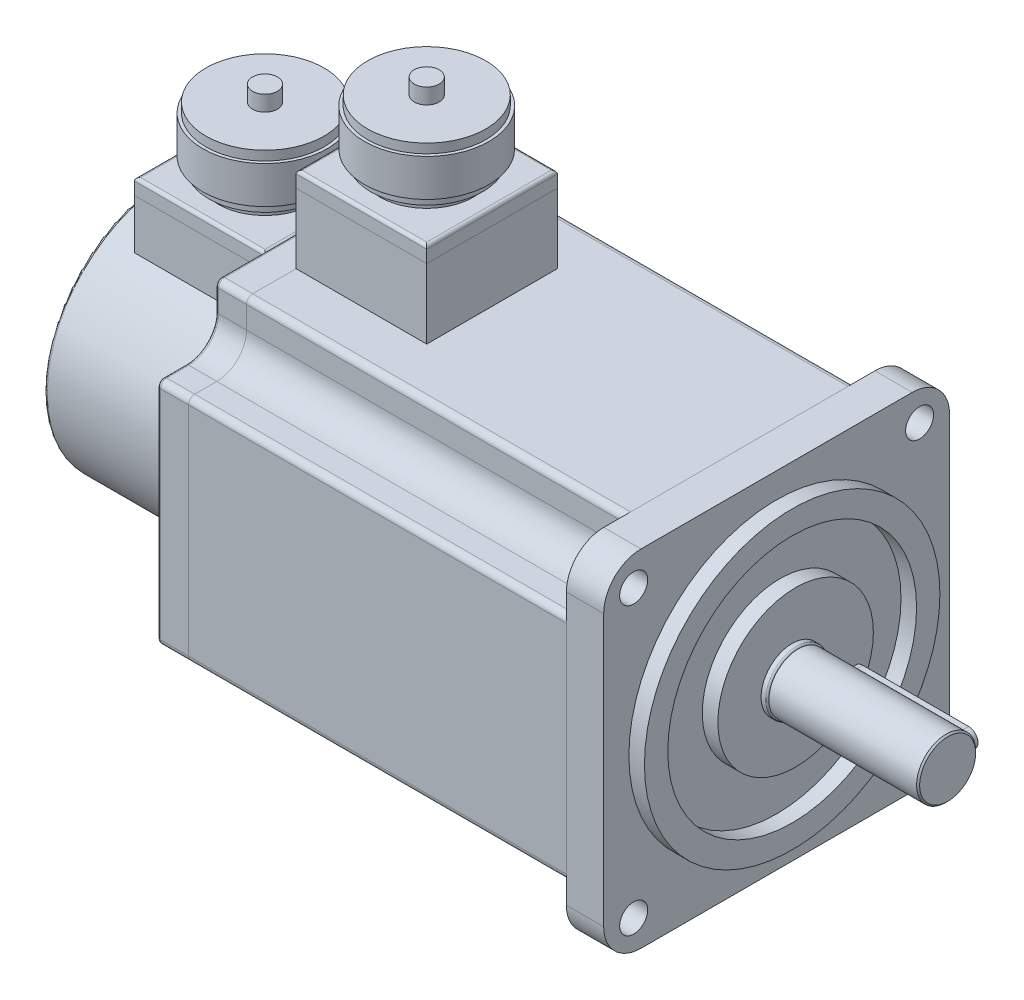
ISO-10303-21;
HEADER;
FILE_DESCRIPTION(('STEP AP214'),'2;1');
FILE_NAME('part.step','',(''),(''),'','','');
FILE_SCHEMA(('AUTOMOTIVE_DESIGN { 1 0 10303 214 1 1 1 1 }'));
ENDSEC;
DATA;
#1=APPLICATION_CONTEXT('core data for automotive mechanical design processes');
#2=APPLICATION_PROTOCOL_DEFINITION('international standard','automotive_design',2000,#1);
#3=PRODUCT_CONTEXT('',#1,'mechanical');
#4=PRODUCT('Part','Part','',(#3));
#5=PRODUCT_RELATED_PRODUCT_CATEGORY('part','',(#4));
#6=PRODUCT_DEFINITION_FORMATION('','',#4);
#7=PRODUCT_DEFINITION_CONTEXT('part definition',#1,'design');
#8=PRODUCT_DEFINITION('design','',#6,#7);
#9=PRODUCT_DEFINITION_SHAPE('','',#8);
#10=(LENGTH_UNIT() NAMED_UNIT(*) SI_UNIT(.MILLI.,.METRE.));
#11=(NAMED_UNIT(*) PLANE_ANGLE_UNIT() SI_UNIT($,.RADIAN.));
#12=(NAMED_UNIT(*) SI_UNIT($,.STERADIAN.) SOLID_ANGLE_UNIT());
#13=UNCERTAINTY_MEASURE_WITH_UNIT(LENGTH_MEASURE(1.E-05),#10,'distance_accuracy_value','');
#14=(GEOMETRIC_REPRESENTATION_CONTEXT(3) GLOBAL_UNCERTAINTY_ASSIGNED_CONTEXT((#13)) GLOBAL_UNIT_ASSIGNED_CONTEXT((#10,
#11,#12)) REPRESENTATION_CONTEXT('',''));
#15=CARTESIAN_POINT('',(0.,0.,0.));
#16=DIRECTION('',(0.,0.,1.));
#17=DIRECTION('',(1.,0.,0.));
#18=AXIS2_PLACEMENT_3D('',#15,#16,#17);
#19=CARTESIAN_POINT('',(193.,0.,-12.25));
#20=DIRECTION('',(0.,0.,1.));
#21=DIRECTION('',(1.,0.,0.));
#22=AXIS2_PLACEMENT_3D('',#19,#20,#21);
#23=CYLINDRICAL_SURFACE('',#22,2.99999999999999);
#24=CARTESIAN_POINT('',(193.,0.,-6.25));
#25=DIRECTION('',(0.,0.,-1.));
#26=DIRECTION('',(-1.,0.,0.));
#27=AXIS2_PLACEMENT_3D('',#24,#25,#26);
#28=CIRCLE('',#27,2.99999999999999);
#29=CARTESIAN_POINT('',(193.,2.99999999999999,-6.25));
#30=VERTEX_POINT('',#29);
#31=CARTESIAN_POINT('',(193.,-3.,-6.25));
#32=VERTEX_POINT('',#31);
#33=EDGE_CURVE('E115',#30,#32,#28,.T.);
#34=ORIENTED_EDGE('',*,*,#33,.T.);
#35=DIRECTION('',(0.,0.,1.));
#36=VECTOR('',#35,1.);
#37=CARTESIAN_POINT('',(193.,-3.,-12.25));
#38=LINE('',#37,#36);
#39=CARTESIAN_POINT('',(193.,-3.,-12.25));
#40=VERTEX_POINT('',#39);
#41=EDGE_CURVE('E13',#40,#32,#38,.T.);
#42=ORIENTED_EDGE('',*,*,#41,.F.);
#43=CARTESIAN_POINT('',(193.,0.,-12.25));
#44=DIRECTION('',(0.,0.,-1.));
#45=DIRECTION('',(-1.,0.,0.));
#46=AXIS2_PLACEMENT_3D('',#43,#44,#45);
#47=CIRCLE('',#46,2.99999999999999);
#48=CARTESIAN_POINT('',(193.,2.99999999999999,-12.25));
#49=VERTEX_POINT('',#48);
#50=EDGE_CURVE('E103',#49,#40,#47,.T.);
#51=ORIENTED_EDGE('',*,*,#50,.F.);
#52=DIRECTION('',(0.,0.,1.));
#53=VECTOR('',#52,1.);
#54=CARTESIAN_POINT('',(193.,2.99999999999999,-12.25));
#55=LINE('',#54,#53);
#56=EDGE_CURVE('E111',#49,#30,#55,.T.);
#57=ORIENTED_EDGE('',*,*,#56,.T.);
#58=EDGE_LOOP('',(#34,#42,#51,#57));
#59=FACE_BOUND('',#58,.T.);
#60=ADVANCED_FACE('F52',(#59),#23,.T.);
#61=CARTESIAN_POINT('',(159.,-3.,-12.25));
#62=DIRECTION('',(0.,1.,0.));
#63=DIRECTION('',(-1.,0.,0.));
#64=AXIS2_PLACEMENT_3D('',#61,#62,#63);
#65=PLANE('',#64);
#66=DIRECTION('',(-1.,0.,0.));
#67=VECTOR('',#66,1.);
#68=CARTESIAN_POINT('',(159.,-3.,-6.25));
#69=LINE('',#68,#67);
#70=CARTESIAN_POINT('',(159.,-3.,-6.25));
#71=VERTEX_POINT('',#70);
#72=EDGE_CURVE('E107',#32,#71,#69,.T.);
#73=ORIENTED_EDGE('',*,*,#72,.T.);
#74=DIRECTION('',(0.,0.,1.));
#75=VECTOR('',#74,1.);
#76=CARTESIAN_POINT('',(159.,-3.,-12.25));
#77=LINE('',#76,#75);
#78=CARTESIAN_POINT('',(159.,-3.,-12.25));
#79=VERTEX_POINT('',#78);
#80=EDGE_CURVE('E60',#79,#71,#77,.T.);
#81=ORIENTED_EDGE('',*,*,#80,.F.);
#82=DIRECTION('',(-1.,0.,0.));
#83=VECTOR('',#82,1.);
#84=CARTESIAN_POINT('',(159.,-3.,-12.25));
#85=LINE('',#84,#83);
#86=EDGE_CURVE('E98',#40,#79,#85,.T.);
#87=ORIENTED_EDGE('',*,*,#86,.F.);
#88=ORIENTED_EDGE('',*,*,#41,.T.);
#89=EDGE_LOOP('',(#73,#81,#87,#88));
#90=FACE_BOUND('',#89,.T.);
#91=ADVANCED_FACE('F106',(#90),#65,.F.);
#92=CARTESIAN_POINT('',(159.,0.,-12.25));
#93=DIRECTION('',(0.,0.,1.));
#94=DIRECTION('',(1.,0.,0.));
#95=AXIS2_PLACEMENT_3D('',#92,#93,#94);
#96=CYLINDRICAL_SURFACE('',#95,2.99999999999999);
#97=CARTESIAN_POINT('',(159.,0.,-6.25));
#98=DIRECTION('',(0.,0.,-1.));
#99=DIRECTION('',(-1.,0.,0.));
#100=AXIS2_PLACEMENT_3D('',#97,#98,#99);
#101=CIRCLE('',#100,2.99999999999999);
#102=CARTESIAN_POINT('',(159.,2.99999999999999,-6.25));
#103=VERTEX_POINT('',#102);
#104=EDGE_CURVE('E85',#71,#103,#101,.T.);
#105=ORIENTED_EDGE('',*,*,#104,.T.);
#106=DIRECTION('',(0.,0.,1.));
#107=VECTOR('',#106,1.);
#108=CARTESIAN_POINT('',(159.,2.99999999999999,-12.25));
#109=LINE('',#108,#107);
#110=CARTESIAN_POINT('',(159.,2.99999999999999,-12.25));
#111=VERTEX_POINT('',#110);
#112=EDGE_CURVE('E108',#111,#103,#109,.T.);
#113=ORIENTED_EDGE('',*,*,#112,.F.);
#114=CARTESIAN_POINT('',(159.,0.,-12.25));
#115=DIRECTION('',(0.,0.,-1.));
#116=DIRECTION('',(-1.,0.,0.));
#117=AXIS2_PLACEMENT_3D('',#114,#115,#116);
#118=CIRCLE('',#117,2.99999999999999);
#119=EDGE_CURVE('E101',#79,#111,#118,.T.);
#120=ORIENTED_EDGE('',*,*,#119,.F.);
#121=ORIENTED_EDGE('',*,*,#80,.T.);
#122=EDGE_LOOP('',(#105,#113,#120,#121));
#123=FACE_BOUND('',#122,.T.);
#124=ADVANCED_FACE('F109',(#123),#96,.T.);
#125=CARTESIAN_POINT('',(193.,2.99999999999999,-12.25));
#126=DIRECTION('',(0.,-1.,0.));
#127=DIRECTION('',(1.,0.,0.));
#128=AXIS2_PLACEMENT_3D('',#125,#126,#127);
#129=PLANE('',#128);
#130=DIRECTION('',(1.,0.,0.));
#131=VECTOR('',#130,1.);
#132=CARTESIAN_POINT('',(193.,2.99999999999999,-6.25));
#133=LINE('',#132,#131);
#134=EDGE_CURVE('E91',#103,#30,#133,.T.);
#135=ORIENTED_EDGE('',*,*,#134,.T.);
#136=ORIENTED_EDGE('',*,*,#56,.F.);
#137=DIRECTION('',(1.,0.,0.));
#138=VECTOR('',#137,1.);
#139=CARTESIAN_POINT('',(193.,2.99999999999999,-12.25));
#140=LINE('',#139,#138);
#141=EDGE_CURVE('E68',#111,#49,#140,.T.);
#142=ORIENTED_EDGE('',*,*,#141,.F.);
#143=ORIENTED_EDGE('',*,*,#112,.T.);
#144=EDGE_LOOP('',(#135,#136,#142,#143));
#145=FACE_BOUND('',#144,.T.);
#146=ADVANCED_FACE('F122',(#145),#129,.F.);
#147=CARTESIAN_POINT('',(193.,0.,-12.25));
#148=DIRECTION('',(0.,0.,-1.));
#149=DIRECTION('',(-1.,0.,0.));
#150=AXIS2_PLACEMENT_3D('',#147,#148,#149);
#151=PLANE('',#150);
#152=ORIENTED_EDGE('',*,*,#50,.T.);
#153=ORIENTED_EDGE('',*,*,#86,.T.);
#154=ORIENTED_EDGE('',*,*,#119,.T.);
#155=ORIENTED_EDGE('',*,*,#141,.T.);
#156=EDGE_LOOP('',(#152,#153,#154,#155));
#157=FACE_BOUND('',#156,.T.);
#158=ADVANCED_FACE('F99',(#157),#151,.T.);
#159=CARTESIAN_POINT('',(193.,0.,-6.25));
#160=DIRECTION('',(0.,0.,-1.));
#161=DIRECTION('',(-1.,0.,0.));
#162=AXIS2_PLACEMENT_3D('',#159,#160,#161);
#163=PLANE('',#162);
#164=ORIENTED_EDGE('',*,*,#33,.F.);
#165=ORIENTED_EDGE('',*,*,#134,.F.);
#166=ORIENTED_EDGE('',*,*,#104,.F.);
#167=ORIENTED_EDGE('',*,*,#72,.F.);
#168=EDGE_LOOP('',(#164,#165,#166,#167));
#169=FACE_BOUND('',#168,.T.);
#170=ADVANCED_FACE('F125',(#169),#163,.F.);
#171=CLOSED_SHELL('',(#60,#91,#124,#146,#158,#170));
#172=MANIFOLD_SOLID_BREP('B2',#171);
#173=CARTESIAN_POINT('',(31.,109.,0.));
#174=DIRECTION('',(0.,-1.,0.));
#175=DIRECTION('',(0.,0.,-1.));
#176=AXIS2_PLACEMENT_3D('',#173,#174,#175);
#177=CYLINDRICAL_SURFACE('',#176,4.);
#178=CARTESIAN_POINT('',(31.,109.,0.));
#179=DIRECTION('',(0.,1.,0.));
#180=DIRECTION('',(0.,0.,1.));
#181=AXIS2_PLACEMENT_3D('',#178,#179,#180);
#182=CIRCLE('',#181,4.);
#183=CARTESIAN_POINT('',(31.,109.,4.));
#184=VERTEX_POINT('',#183);
#185=EDGE_CURVE('E51',#184,#184,#182,.T.);
#186=ORIENTED_EDGE('',*,*,#185,.F.);
#187=EDGE_LOOP('',(#186));
#188=FACE_BOUND('',#187,.T.);
#189=CARTESIAN_POINT('',(31.,104.,0.));
#190=DIRECTION('',(0.,1.,0.));
#191=DIRECTION('',(0.,0.,1.));
#192=AXIS2_PLACEMENT_3D('',#189,#190,#191);
#193=CIRCLE('',#192,4.);
#194=CARTESIAN_POINT('',(31.,104.,4.));
#195=VERTEX_POINT('',#194);
#196=EDGE_CURVE('E187',#195,#195,#193,.T.);
#197=ORIENTED_EDGE('',*,*,#196,.T.);
#198=EDGE_LOOP('',(#197));
#199=FACE_BOUND('',#198,.T.);
#200=ADVANCED_FACE('F184',(#188,#199),#177,.T.);
#201=CARTESIAN_POINT('',(31.,109.,0.));
#202=DIRECTION('',(0.,1.,0.));
#203=DIRECTION('',(0.,0.,1.));
#204=AXIS2_PLACEMENT_3D('',#201,#202,#203);
#205=PLANE('',#204);
#206=ORIENTED_EDGE('',*,*,#185,.T.);
#207=EDGE_LOOP('',(#206));
#208=FACE_BOUND('',#207,.T.);
#209=ADVANCED_FACE('F199',(#208),#205,.T.);
#210=CARTESIAN_POINT('',(31.,104.,0.));
#211=DIRECTION('',(0.,1.,0.));
#212=DIRECTION('',(0.,0.,1.));
#213=AXIS2_PLACEMENT_3D('',#210,#211,#212);
#214=PLANE('',#213);
#215=ORIENTED_EDGE('',*,*,#196,.F.);
#216=EDGE_LOOP('',(#215));
#217=FACE_BOUND('',#216,.T.);
#218=ADVANCED_FACE('F197',(#217),#214,.F.);
#219=CLOSED_SHELL('',(#200,#209,#218));
#220=MANIFOLD_SOLID_BREP('B7',#219);
#221=CARTESIAN_POINT('',(31.,104.,0.));
#222=DIRECTION('',(0.,-1.,0.));
#223=DIRECTION('',(0.,0.,-1.));
#224=AXIS2_PLACEMENT_3D('',#221,#222,#223);
#225=CYLINDRICAL_SURFACE('',#224,19.);
#226=CARTESIAN_POINT('',(31.,104.,0.));
#227=DIRECTION('',(0.,1.,0.));
#228=DIRECTION('',(0.,0.,1.));
#229=AXIS2_PLACEMENT_3D('',#226,#227,#228);
#230=CIRCLE('',#229,19.);
#231=CARTESIAN_POINT('',(31.,104.,19.));
#232=VERTEX_POINT('',#231);
#233=EDGE_CURVE('E183',#232,#232,#230,.T.);
#234=ORIENTED_EDGE('',*,*,#233,.F.);
#235=EDGE_LOOP('',(#234));
#236=FACE_BOUND('',#235,.T.);
#237=CARTESIAN_POINT('',(31.,101.,0.));
#238=DIRECTION('',(0.,1.,0.));
#239=DIRECTION('',(0.,0.,1.));
#240=AXIS2_PLACEMENT_3D('',#237,#238,#239);
#241=CIRCLE('',#240,19.);
#242=CARTESIAN_POINT('',(31.,101.,19.));
#243=VERTEX_POINT('',#242);
#244=EDGE_CURVE('E236',#243,#243,#241,.T.);
#245=ORIENTED_EDGE('',*,*,#244,.T.);
#246=EDGE_LOOP('',(#245));
#247=FACE_BOUND('',#246,.T.);
#248=ADVANCED_FACE('F233',(#236,#247),#225,.T.);
#249=CARTESIAN_POINT('',(31.,104.,0.));
#250=DIRECTION('',(0.,1.,0.));
#251=DIRECTION('',(0.,0.,1.));
#252=AXIS2_PLACEMENT_3D('',#249,#250,#251);
#253=PLANE('',#252);
#254=ORIENTED_EDGE('',*,*,#233,.T.);
#255=EDGE_LOOP('',(#254));
#256=FACE_BOUND('',#255,.T.);
#257=ADVANCED_FACE('F248',(#256),#253,.T.);
#258=CARTESIAN_POINT('',(31.,101.,0.));
#259=DIRECTION('',(0.,1.,0.));
#260=DIRECTION('',(0.,0.,1.));
#261=AXIS2_PLACEMENT_3D('',#258,#259,#260);
#262=PLANE('',#261);
#263=ORIENTED_EDGE('',*,*,#244,.F.);
#264=EDGE_LOOP('',(#263));
#265=FACE_BOUND('',#264,.T.);
#266=ADVANCED_FACE('F246',(#265),#262,.F.);
#267=CLOSED_SHELL('',(#248,#257,#266));
#268=MANIFOLD_SOLID_BREP('B46',#267);
#269=CARTESIAN_POINT('',(31.,101.,0.));
#270=DIRECTION('',(0.,-1.,0.));
#271=DIRECTION('',(0.,0.,-1.));
#272=AXIS2_PLACEMENT_3D('',#269,#270,#271);
#273=CYLINDRICAL_SURFACE('',#272,20.);
#274=CARTESIAN_POINT('',(31.,101.,0.));
#275=DIRECTION('',(0.,1.,0.));
#276=DIRECTION('',(0.,0.,1.));
#277=AXIS2_PLACEMENT_3D('',#274,#275,#276);
#278=CIRCLE('',#277,20.);
#279=CARTESIAN_POINT('',(31.,101.,20.));
#280=VERTEX_POINT('',#279);
#281=EDGE_CURVE('E232',#280,#280,#278,.T.);
#282=ORIENTED_EDGE('',*,*,#281,.F.);
#283=EDGE_LOOP('',(#282));
#284=FACE_BOUND('',#283,.T.);
#285=CARTESIAN_POINT('',(31.,89.,0.));
#286=DIRECTION('',(0.,1.,0.));
#287=DIRECTION('',(0.,0.,1.));
#288=AXIS2_PLACEMENT_3D('',#285,#286,#287);
#289=CIRCLE('',#288,20.);
#290=CARTESIAN_POINT('',(31.,89.,20.));
#291=VERTEX_POINT('',#290);
#292=EDGE_CURVE('E285',#291,#291,#289,.T.);
#293=ORIENTED_EDGE('',*,*,#292,.T.);
#294=EDGE_LOOP('',(#293));
#295=FACE_BOUND('',#294,.T.);
#296=ADVANCED_FACE('F282',(#284,#295),#273,.T.);
#297=CARTESIAN_POINT('',(31.,101.,0.));
#298=DIRECTION('',(0.,1.,0.));
#299=DIRECTION('',(0.,0.,1.));
#300=AXIS2_PLACEMENT_3D('',#297,#298,#299);
#301=PLANE('',#300);
#302=ORIENTED_EDGE('',*,*,#281,.T.);
#303=EDGE_LOOP('',(#302));
#304=FACE_BOUND('',#303,.T.);
#305=ADVANCED_FACE('F297',(#304),#301,.T.);
#306=CARTESIAN_POINT('',(31.,89.,0.));
#307=DIRECTION('',(0.,1.,0.));
#308=DIRECTION('',(0.,0.,1.));
#309=AXIS2_PLACEMENT_3D('',#306,#307,#308);
#310=PLANE('',#309);
#311=ORIENTED_EDGE('',*,*,#292,.F.);
#312=EDGE_LOOP('',(#311));
#313=FACE_BOUND('',#312,.T.);
#314=ADVANCED_FACE('F295',(#313),#310,.F.);
#315=CLOSED_SHELL('',(#296,#305,#314));
#316=MANIFOLD_SOLID_BREP('B178',#315);
#317=CARTESIAN_POINT('',(31.,89.,0.));
#318=DIRECTION('',(0.,-1.,0.));
#319=DIRECTION('',(0.,0.,-1.));
#320=AXIS2_PLACEMENT_3D('',#317,#318,#319);
#321=CYLINDRICAL_SURFACE('',#320,18.);
#322=CARTESIAN_POINT('',(31.,89.,0.));
#323=DIRECTION('',(0.,1.,0.));
#324=DIRECTION('',(0.,0.,1.));
#325=AXIS2_PLACEMENT_3D('',#322,#323,#324);
#326=CIRCLE('',#325,18.);
#327=CARTESIAN_POINT('',(31.,89.,18.));
#328=VERTEX_POINT('',#327);
#329=EDGE_CURVE('E281',#328,#328,#326,.T.);
#330=ORIENTED_EDGE('',*,*,#329,.F.);
#331=EDGE_LOOP('',(#330));
#332=FACE_BOUND('',#331,.T.);
#333=CARTESIAN_POINT('',(31.,86.,0.));
#334=DIRECTION('',(0.,1.,0.));
#335=DIRECTION('',(0.,0.,1.));
#336=AXIS2_PLACEMENT_3D('',#333,#334,#335);
#337=CIRCLE('',#336,18.);
#338=CARTESIAN_POINT('',(31.,86.,18.));
#339=VERTEX_POINT('',#338);
#340=EDGE_CURVE('E334',#339,#339,#337,.T.);
#341=ORIENTED_EDGE('',*,*,#340,.T.);
#342=EDGE_LOOP('',(#341));
#343=FACE_BOUND('',#342,.T.);
#344=ADVANCED_FACE('F331',(#332,#343),#321,.T.);
#345=CARTESIAN_POINT('',(31.,89.,0.));
#346=DIRECTION('',(0.,1.,0.));
#347=DIRECTION('',(0.,0.,1.));
#348=AXIS2_PLACEMENT_3D('',#345,#346,#347);
#349=PLANE('',#348);
#350=ORIENTED_EDGE('',*,*,#329,.T.);
#351=EDGE_LOOP('',(#350));
#352=FACE_BOUND('',#351,.T.);
#353=ADVANCED_FACE('F346',(#352),#349,.T.);
#354=CARTESIAN_POINT('',(31.,86.,0.));
#355=DIRECTION('',(0.,1.,0.));
#356=DIRECTION('',(0.,0.,1.));
#357=AXIS2_PLACEMENT_3D('',#354,#355,#356);
#358=PLANE('',#357);
#359=ORIENTED_EDGE('',*,*,#340,.F.);
#360=EDGE_LOOP('',(#359));
#361=FACE_BOUND('',#360,.T.);
#362=ADVANCED_FACE('F344',(#361),#358,.F.);
#363=CLOSED_SHELL('',(#344,#353,#362));
#364=MANIFOLD_SOLID_BREP('B227',#363);
#365=CARTESIAN_POINT('',(31.,86.,0.));
#366=DIRECTION('',(0.,-1.,0.));
#367=DIRECTION('',(0.,0.,-1.));
#368=AXIS2_PLACEMENT_3D('',#365,#366,#367);
#369=CYLINDRICAL_SURFACE('',#368,15.);
#370=CARTESIAN_POINT('',(31.,86.,0.));
#371=DIRECTION('',(0.,1.,0.));
#372=DIRECTION('',(0.,0.,1.));
#373=AXIS2_PLACEMENT_3D('',#370,#371,#372);
#374=CIRCLE('',#373,15.);
#375=CARTESIAN_POINT('',(31.,86.,15.));
#376=VERTEX_POINT('',#375);
#377=EDGE_CURVE('E330',#376,#376,#374,.T.);
#378=ORIENTED_EDGE('',*,*,#377,.F.);
#379=EDGE_LOOP('',(#378));
#380=FACE_BOUND('',#379,.T.);
#381=CARTESIAN_POINT('',(31.,83.,0.));
#382=DIRECTION('',(0.,1.,0.));
#383=DIRECTION('',(0.,0.,1.));
#384=AXIS2_PLACEMENT_3D('',#381,#382,#383);
#385=CIRCLE('',#384,15.);
#386=CARTESIAN_POINT('',(31.,83.,15.));
#387=VERTEX_POINT('',#386);
#388=EDGE_CURVE('E385',#387,#387,#385,.T.);
#389=ORIENTED_EDGE('',*,*,#388,.T.);
#390=EDGE_LOOP('',(#389));
#391=FACE_BOUND('',#390,.T.);
#392=ADVANCED_FACE('F382',(#380,#391),#369,.T.);
#393=CARTESIAN_POINT('',(31.,86.,0.));
#394=DIRECTION('',(0.,1.,0.));
#395=DIRECTION('',(0.,0.,1.));
#396=AXIS2_PLACEMENT_3D('',#393,#394,#395);
#397=PLANE('',#396);
#398=ORIENTED_EDGE('',*,*,#377,.T.);
#399=EDGE_LOOP('',(#398));
#400=FACE_BOUND('',#399,.T.);
#401=ADVANCED_FACE('F397',(#400),#397,.T.);
#402=CARTESIAN_POINT('',(31.,83.,0.));
#403=DIRECTION('',(0.,1.,0.));
#404=DIRECTION('',(0.,0.,1.));
#405=AXIS2_PLACEMENT_3D('',#402,#403,#404);
#406=PLANE('',#405);
#407=ORIENTED_EDGE('',*,*,#388,.F.);
#408=EDGE_LOOP('',(#407));
#409=FACE_BOUND('',#408,.T.);
#410=ADVANCED_FACE('F395',(#409),#406,.F.);
#411=CLOSED_SHELL('',(#392,#401,#410));
#412=MANIFOLD_SOLID_BREP('B276',#411);
#413=CARTESIAN_POINT('',(52.,83.,21.));
#414=DIRECTION('',(-1.,0.,0.));
#415=DIRECTION('',(0.,0.,1.));
#416=AXIS2_PLACEMENT_3D('',#413,#414,#415);
#417=PLANE('',#416);
#418=DIRECTION('',(0.,-1.,0.));
#419=VECTOR('',#418,1.);
#420=CARTESIAN_POINT('',(52.,83.,-21.));
#421=LINE('',#420,#419);
#422=CARTESIAN_POINT('',(52.,82.,-21.));
#423=VERTEX_POINT('',#422);
#424=CARTESIAN_POINT('',(52.,78.,-21.));
#425=VERTEX_POINT('',#424);
#426=EDGE_CURVE('E485',#423,#425,#421,.T.);
#427=ORIENTED_EDGE('',*,*,#426,.F.);
#428=DIRECTION('',(0.,0.,-1.));
#429=VECTOR('',#428,1.);
#430=CARTESIAN_POINT('',(52.,82.,21.));
#431=LINE('',#430,#429);
#432=CARTESIAN_POINT('',(52.,82.,21.));
#433=VERTEX_POINT('',#432);
#434=EDGE_CURVE('E380',#423,#433,#431,.F.);
#435=ORIENTED_EDGE('',*,*,#434,.T.);
#436=DIRECTION('',(0.,-1.,0.));
#437=VECTOR('',#436,1.);
#438=CARTESIAN_POINT('',(52.,83.,21.));
#439=LINE('',#438,#437);
#440=CARTESIAN_POINT('',(52.,78.,21.));
#441=VERTEX_POINT('',#440);
#442=EDGE_CURVE('E505',#433,#441,#439,.T.);
#443=ORIENTED_EDGE('',*,*,#442,.T.);
#444=DIRECTION('',(0.,0.,-1.));
#445=VECTOR('',#444,1.);
#446=CARTESIAN_POINT('',(52.,78.,21.));
#447=LINE('',#446,#445);
#448=EDGE_CURVE('E500',#441,#425,#447,.T.);
#449=ORIENTED_EDGE('',*,*,#448,.T.);
#450=EDGE_LOOP('',(#427,#435,#443,#449));
#451=FACE_BOUND('',#450,.T.);
#452=ADVANCED_FACE('F433',(#451),#417,.F.);
#453=CARTESIAN_POINT('',(10.,83.,-21.));
#454=DIRECTION('',(0.,0.,1.));
#455=DIRECTION('',(1.,0.,0.));
#456=AXIS2_PLACEMENT_3D('',#453,#454,#455);
#457=PLANE('',#456);
#458=DIRECTION('',(0.,-1.,0.));
#459=VECTOR('',#458,1.);
#460=CARTESIAN_POINT('',(10.,83.,-21.));
#461=LINE('',#460,#459);
#462=CARTESIAN_POINT('',(10.,82.,-21.));
#463=VERTEX_POINT('',#462);
#464=CARTESIAN_POINT('',(10.,78.,-21.));
#465=VERTEX_POINT('',#464);
#466=EDGE_CURVE('E494',#463,#465,#461,.T.);
#467=ORIENTED_EDGE('',*,*,#466,.F.);
#468=DIRECTION('',(-1.,0.,0.));
#469=VECTOR('',#468,1.);
#470=CARTESIAN_POINT('',(10.,82.,-21.));
#471=LINE('',#470,#469);
#472=EDGE_CURVE('E442',#463,#423,#471,.F.);
#473=ORIENTED_EDGE('',*,*,#472,.T.);
#474=ORIENTED_EDGE('',*,*,#426,.T.);
#475=DIRECTION('',(-1.,0.,0.));
#476=VECTOR('',#475,1.);
#477=CARTESIAN_POINT('',(10.,78.,-21.));
#478=LINE('',#477,#476);
#479=EDGE_CURVE('E488',#425,#465,#478,.T.);
#480=ORIENTED_EDGE('',*,*,#479,.T.);
#481=EDGE_LOOP('',(#467,#473,#474,#480));
#482=FACE_BOUND('',#481,.T.);
#483=ADVANCED_FACE('F487',(#482),#457,.F.);
#484=CARTESIAN_POINT('',(10.,83.,21.));
#485=DIRECTION('',(1.,0.,0.));
#486=DIRECTION('',(0.,0.,-1.));
#487=AXIS2_PLACEMENT_3D('',#484,#485,#486);
#488=PLANE('',#487);
#489=DIRECTION('',(0.,-1.,0.));
#490=VECTOR('',#489,1.);
#491=CARTESIAN_POINT('',(10.,83.,21.));
#492=LINE('',#491,#490);
#493=CARTESIAN_POINT('',(10.,82.,21.));
#494=VERTEX_POINT('',#493);
#495=CARTESIAN_POINT('',(10.,78.,21.));
#496=VERTEX_POINT('',#495);
#497=EDGE_CURVE('E515',#494,#496,#492,.T.);
#498=ORIENTED_EDGE('',*,*,#497,.F.);
#499=DIRECTION('',(0.,0.,1.));
#500=VECTOR('',#499,1.);
#501=CARTESIAN_POINT('',(10.,82.,21.));
#502=LINE('',#501,#500);
#503=EDGE_CURVE('E457',#494,#463,#502,.F.);
#504=ORIENTED_EDGE('',*,*,#503,.T.);
#505=ORIENTED_EDGE('',*,*,#466,.T.);
#506=DIRECTION('',(0.,0.,1.));
#507=VECTOR('',#506,1.);
#508=CARTESIAN_POINT('',(10.,78.,21.));
#509=LINE('',#508,#507);
#510=EDGE_CURVE('E502',#465,#496,#509,.T.);
#511=ORIENTED_EDGE('',*,*,#510,.T.);
#512=EDGE_LOOP('',(#498,#504,#505,#511));
#513=FACE_BOUND('',#512,.T.);
#514=ADVANCED_FACE('F553',(#513),#488,.F.);
#515=CARTESIAN_POINT('',(10.,83.,21.));
#516=DIRECTION('',(0.,0.,-1.));
#517=DIRECTION('',(-1.,0.,0.));
#518=AXIS2_PLACEMENT_3D('',#515,#516,#517);
#519=PLANE('',#518);
#520=ORIENTED_EDGE('',*,*,#442,.F.);
#521=DIRECTION('',(1.,0.,0.));
#522=VECTOR('',#521,1.);
#523=CARTESIAN_POINT('',(10.,82.,21.));
#524=LINE('',#523,#522);
#525=EDGE_CURVE('E526',#433,#494,#524,.F.);
#526=ORIENTED_EDGE('',*,*,#525,.T.);
#527=ORIENTED_EDGE('',*,*,#497,.T.);
#528=DIRECTION('',(1.,0.,0.));
#529=VECTOR('',#528,1.);
#530=CARTESIAN_POINT('',(10.,78.,21.));
#531=LINE('',#530,#529);
#532=EDGE_CURVE('E512',#496,#441,#531,.T.);
#533=ORIENTED_EDGE('',*,*,#532,.T.);
#534=EDGE_LOOP('',(#520,#526,#527,#533));
#535=FACE_BOUND('',#534,.T.);
#536=ADVANCED_FACE('F552',(#535),#519,.F.);
#537=CARTESIAN_POINT('',(0.,83.,0.));
#538=DIRECTION('',(0.,-1.,0.));
#539=DIRECTION('',(0.,0.,-1.));
#540=AXIS2_PLACEMENT_3D('',#537,#538,#539);
#541=PLANE('',#540);
#542=DIRECTION('',(0.,0.,1.));
#543=VECTOR('',#542,1.);
#544=CARTESIAN_POINT('',(11.,83.,0.));
#545=LINE('',#544,#543);
#546=CARTESIAN_POINT('',(11.,83.,-20.));
#547=VERTEX_POINT('',#546);
#548=CARTESIAN_POINT('',(11.,83.,20.));
#549=VERTEX_POINT('',#548);
#550=EDGE_CURVE('E521',#547,#549,#545,.T.);
#551=ORIENTED_EDGE('',*,*,#550,.T.);
#552=DIRECTION('',(1.,0.,0.));
#553=VECTOR('',#552,1.);
#554=CARTESIAN_POINT('',(0.,83.,20.));
#555=LINE('',#554,#553);
#556=CARTESIAN_POINT('',(51.,83.,20.));
#557=VERTEX_POINT('',#556);
#558=EDGE_CURVE('E523',#549,#557,#555,.T.);
#559=ORIENTED_EDGE('',*,*,#558,.T.);
#560=DIRECTION('',(0.,0.,-1.));
#561=VECTOR('',#560,1.);
#562=CARTESIAN_POINT('',(51.,83.,0.));
#563=LINE('',#562,#561);
#564=CARTESIAN_POINT('',(51.,83.,-20.));
#565=VERTEX_POINT('',#564);
#566=EDGE_CURVE('E493',#557,#565,#563,.T.);
#567=ORIENTED_EDGE('',*,*,#566,.T.);
#568=DIRECTION('',(-1.,0.,0.));
#569=VECTOR('',#568,1.);
#570=CARTESIAN_POINT('',(0.,83.,-20.));
#571=LINE('',#570,#569);
#572=EDGE_CURVE('E519',#565,#547,#571,.T.);
#573=ORIENTED_EDGE('',*,*,#572,.T.);
#574=EDGE_LOOP('',(#551,#559,#567,#573));
#575=FACE_BOUND('',#574,.T.);
#576=ADVANCED_FACE('F545',(#575),#541,.F.);
#577=CARTESIAN_POINT('',(0.,78.,0.));
#578=DIRECTION('',(0.,-1.,0.));
#579=DIRECTION('',(0.,0.,-1.));
#580=AXIS2_PLACEMENT_3D('',#577,#578,#579);
#581=PLANE('',#580);
#582=ORIENTED_EDGE('',*,*,#448,.F.);
#583=ORIENTED_EDGE('',*,*,#532,.F.);
#584=ORIENTED_EDGE('',*,*,#510,.F.);
#585=ORIENTED_EDGE('',*,*,#479,.F.);
#586=EDGE_LOOP('',(#582,#583,#584,#585));
#587=FACE_BOUND('',#586,.T.);
#588=ADVANCED_FACE('F498',(#587),#581,.T.);
#589=CARTESIAN_POINT('',(0.,82.,-20.));
#590=DIRECTION('',(-1.,0.,0.));
#591=DIRECTION('',(0.,0.,1.));
#592=AXIS2_PLACEMENT_3D('',#589,#590,#591);
#593=CYLINDRICAL_SURFACE('',#592,1.);
#594=CARTESIAN_POINT('',(51.,82.,-20.));
#595=DIRECTION('',(-0.707106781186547,0.,-0.707106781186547));
#596=DIRECTION('',(0.707106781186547,0.,-0.707106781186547));
#597=AXIS2_PLACEMENT_3D('',#594,#595,#596);
#598=ELLIPSE('',#597,1.41421356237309,1.);
#599=EDGE_CURVE('E509',#423,#565,#598,.F.);
#600=ORIENTED_EDGE('',*,*,#599,.F.);
#601=ORIENTED_EDGE('',*,*,#472,.F.);
#602=CARTESIAN_POINT('',(11.,82.,-20.));
#603=DIRECTION('',(-0.707106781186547,0.,0.707106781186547));
#604=DIRECTION('',(-0.707106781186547,0.,-0.707106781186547));
#605=AXIS2_PLACEMENT_3D('',#602,#603,#604);
#606=ELLIPSE('',#605,1.41421356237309,1.);
#607=EDGE_CURVE('E437',#547,#463,#606,.T.);
#608=ORIENTED_EDGE('',*,*,#607,.F.);
#609=ORIENTED_EDGE('',*,*,#572,.F.);
#610=EDGE_LOOP('',(#600,#601,#608,#609));
#611=FACE_BOUND('',#610,.T.);
#612=ADVANCED_FACE('F435',(#611),#593,.T.);
#613=CARTESIAN_POINT('',(11.,82.,0.));
#614=DIRECTION('',(0.,0.,1.));
#615=DIRECTION('',(1.,0.,0.));
#616=AXIS2_PLACEMENT_3D('',#613,#614,#615);
#617=CYLINDRICAL_SURFACE('',#616,1.);
#618=ORIENTED_EDGE('',*,*,#607,.T.);
#619=ORIENTED_EDGE('',*,*,#503,.F.);
#620=CARTESIAN_POINT('',(11.,82.,20.));
#621=DIRECTION('',(0.707106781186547,0.,0.707106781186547));
#622=DIRECTION('',(-0.707106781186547,0.,0.707106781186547));
#623=AXIS2_PLACEMENT_3D('',#620,#621,#622);
#624=ELLIPSE('',#623,1.41421356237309,1.);
#625=EDGE_CURVE('E533',#549,#494,#624,.T.);
#626=ORIENTED_EDGE('',*,*,#625,.F.);
#627=ORIENTED_EDGE('',*,*,#550,.F.);
#628=EDGE_LOOP('',(#618,#619,#626,#627));
#629=FACE_BOUND('',#628,.T.);
#630=ADVANCED_FACE('F570',(#629),#617,.T.);
#631=CARTESIAN_POINT('',(51.,82.,0.));
#632=DIRECTION('',(0.,0.,-1.));
#633=DIRECTION('',(-1.,0.,0.));
#634=AXIS2_PLACEMENT_3D('',#631,#632,#633);
#635=CYLINDRICAL_SURFACE('',#634,1.);
#636=ORIENTED_EDGE('',*,*,#599,.T.);
#637=ORIENTED_EDGE('',*,*,#566,.F.);
#638=CARTESIAN_POINT('',(51.,82.,20.));
#639=DIRECTION('',(0.707106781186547,0.,-0.707106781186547));
#640=DIRECTION('',(-0.707106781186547,0.,-0.707106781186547));
#641=AXIS2_PLACEMENT_3D('',#638,#639,#640);
#642=ELLIPSE('',#641,1.41421356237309,1.);
#643=EDGE_CURVE('E531',#433,#557,#642,.F.);
#644=ORIENTED_EDGE('',*,*,#643,.F.);
#645=ORIENTED_EDGE('',*,*,#434,.F.);
#646=EDGE_LOOP('',(#636,#637,#644,#645));
#647=FACE_BOUND('',#646,.T.);
#648=ADVANCED_FACE('F538',(#647),#635,.T.);
#649=CARTESIAN_POINT('',(0.,82.,20.));
#650=DIRECTION('',(1.,0.,0.));
#651=DIRECTION('',(0.,0.,-1.));
#652=AXIS2_PLACEMENT_3D('',#649,#650,#651);
#653=CYLINDRICAL_SURFACE('',#652,1.);
#654=ORIENTED_EDGE('',*,*,#625,.T.);
#655=ORIENTED_EDGE('',*,*,#525,.F.);
#656=ORIENTED_EDGE('',*,*,#643,.T.);
#657=ORIENTED_EDGE('',*,*,#558,.F.);
#658=EDGE_LOOP('',(#654,#655,#656,#657));
#659=FACE_BOUND('',#658,.T.);
#660=ADVANCED_FACE('F549',(#659),#653,.T.);
#661=CLOSED_SHELL('',(#452,#483,#514,#536,#576,#588,#612,#630,#648,#660));
#662=MANIFOLD_SOLID_BREP('B325',#661);
#663=CARTESIAN_POINT('',(52.,78.,21.));
#664=DIRECTION('',(-1.,0.,0.));
#665=DIRECTION('',(0.,0.,1.));
#666=AXIS2_PLACEMENT_3D('',#663,#664,#665);
#667=PLANE('',#666);
#668=DIRECTION('',(0.,0.,-1.));
#669=VECTOR('',#668,1.);
#670=CARTESIAN_POINT('',(52.,55.6,21.));
#671=LINE('',#670,#669);
#672=CARTESIAN_POINT('',(52.,55.6,21.));
#673=VERTEX_POINT('',#672);
#674=CARTESIAN_POINT('',(52.,55.6,-21.));
#675=VERTEX_POINT('',#674);
#676=EDGE_CURVE('E708',#673,#675,#671,.T.);
#677=ORIENTED_EDGE('',*,*,#676,.T.);
#678=DIRECTION('',(0.,-1.,0.));
#679=VECTOR('',#678,1.);
#680=CARTESIAN_POINT('',(52.,78.,-21.));
#681=LINE('',#680,#679);
#682=CARTESIAN_POINT('',(52.,78.,-21.));
#683=VERTEX_POINT('',#682);
#684=EDGE_CURVE('E431',#683,#675,#681,.T.);
#685=ORIENTED_EDGE('',*,*,#684,.F.);
#686=DIRECTION('',(0.,0.,-1.));
#687=VECTOR('',#686,1.);
#688=CARTESIAN_POINT('',(52.,78.,21.));
#689=LINE('',#688,#687);
#690=CARTESIAN_POINT('',(52.,78.,21.));
#691=VERTEX_POINT('',#690);
#692=EDGE_CURVE('E696',#691,#683,#689,.T.);
#693=ORIENTED_EDGE('',*,*,#692,.F.);
#694=DIRECTION('',(0.,-1.,0.));
#695=VECTOR('',#694,1.);
#696=CARTESIAN_POINT('',(52.,78.,21.));
#697=LINE('',#696,#695);
#698=EDGE_CURVE('E704',#691,#673,#697,.T.);
#699=ORIENTED_EDGE('',*,*,#698,.T.);
#700=EDGE_LOOP('',(#677,#685,#693,#699));
#701=FACE_BOUND('',#700,.T.);
#702=ADVANCED_FACE('F645',(#701),#667,.F.);
#703=CARTESIAN_POINT('',(10.,78.,-21.));
#704=DIRECTION('',(0.,0.,1.));
#705=DIRECTION('',(1.,0.,0.));
#706=AXIS2_PLACEMENT_3D('',#703,#704,#705);
#707=PLANE('',#706);
#708=DIRECTION('',(-1.,0.,0.));
#709=VECTOR('',#708,1.);
#710=CARTESIAN_POINT('',(10.,55.6,-21.));
#711=LINE('',#710,#709);
#712=CARTESIAN_POINT('',(10.,55.6,-21.));
#713=VERTEX_POINT('',#712);
#714=EDGE_CURVE('E700',#675,#713,#711,.T.);
#715=ORIENTED_EDGE('',*,*,#714,.T.);
#716=DIRECTION('',(0.,-1.,0.));
#717=VECTOR('',#716,1.);
#718=CARTESIAN_POINT('',(10.,78.,-21.));
#719=LINE('',#718,#717);
#720=CARTESIAN_POINT('',(10.,78.,-21.));
#721=VERTEX_POINT('',#720);
#722=EDGE_CURVE('E653',#721,#713,#719,.T.);
#723=ORIENTED_EDGE('',*,*,#722,.F.);
#724=DIRECTION('',(-1.,0.,0.));
#725=VECTOR('',#724,1.);
#726=CARTESIAN_POINT('',(10.,78.,-21.));
#727=LINE('',#726,#725);
#728=EDGE_CURVE('E691',#683,#721,#727,.T.);
#729=ORIENTED_EDGE('',*,*,#728,.F.);
#730=ORIENTED_EDGE('',*,*,#684,.T.);
#731=EDGE_LOOP('',(#715,#723,#729,#730));
#732=FACE_BOUND('',#731,.T.);
#733=ADVANCED_FACE('F699',(#732),#707,.F.);
#734=CARTESIAN_POINT('',(10.,78.,21.));
#735=DIRECTION('',(1.,0.,0.));
#736=DIRECTION('',(0.,0.,-1.));
#737=AXIS2_PLACEMENT_3D('',#734,#735,#736);
#738=PLANE('',#737);
#739=DIRECTION('',(0.,0.,1.));
#740=VECTOR('',#739,1.);
#741=CARTESIAN_POINT('',(10.,55.6,21.));
#742=LINE('',#741,#740);
#743=CARTESIAN_POINT('',(10.,55.6,21.));
#744=VERTEX_POINT('',#743);
#745=EDGE_CURVE('E678',#713,#744,#742,.T.);
#746=ORIENTED_EDGE('',*,*,#745,.T.);
#747=DIRECTION('',(0.,-1.,0.));
#748=VECTOR('',#747,1.);
#749=CARTESIAN_POINT('',(10.,78.,21.));
#750=LINE('',#749,#748);
#751=CARTESIAN_POINT('',(10.,78.,21.));
#752=VERTEX_POINT('',#751);
#753=EDGE_CURVE('E701',#752,#744,#750,.T.);
#754=ORIENTED_EDGE('',*,*,#753,.F.);
#755=DIRECTION('',(0.,0.,1.));
#756=VECTOR('',#755,1.);
#757=CARTESIAN_POINT('',(10.,78.,21.));
#758=LINE('',#757,#756);
#759=EDGE_CURVE('E694',#721,#752,#758,.T.);
#760=ORIENTED_EDGE('',*,*,#759,.F.);
#761=ORIENTED_EDGE('',*,*,#722,.T.);
#762=EDGE_LOOP('',(#746,#754,#760,#761));
#763=FACE_BOUND('',#762,.T.);
#764=ADVANCED_FACE('F702',(#763),#738,.F.);
#765=CARTESIAN_POINT('',(10.,78.,21.));
#766=DIRECTION('',(0.,0.,-1.));
#767=DIRECTION('',(-1.,0.,0.));
#768=AXIS2_PLACEMENT_3D('',#765,#766,#767);
#769=PLANE('',#768);
#770=DIRECTION('',(1.,0.,0.));
#771=VECTOR('',#770,1.);
#772=CARTESIAN_POINT('',(10.,55.6,21.));
#773=LINE('',#772,#771);
#774=EDGE_CURVE('E684',#744,#673,#773,.T.);
#775=ORIENTED_EDGE('',*,*,#774,.T.);
#776=ORIENTED_EDGE('',*,*,#698,.F.);
#777=DIRECTION('',(1.,0.,0.));
#778=VECTOR('',#777,1.);
#779=CARTESIAN_POINT('',(10.,78.,21.));
#780=LINE('',#779,#778);
#781=EDGE_CURVE('E661',#752,#691,#780,.T.);
#782=ORIENTED_EDGE('',*,*,#781,.F.);
#783=ORIENTED_EDGE('',*,*,#753,.T.);
#784=EDGE_LOOP('',(#775,#776,#782,#783));
#785=FACE_BOUND('',#784,.T.);
#786=ADVANCED_FACE('F715',(#785),#769,.F.);
#787=CARTESIAN_POINT('',(0.,78.,0.));
#788=DIRECTION('',(0.,-1.,0.));
#789=DIRECTION('',(0.,0.,-1.));
#790=AXIS2_PLACEMENT_3D('',#787,#788,#789);
#791=PLANE('',#790);
#792=ORIENTED_EDGE('',*,*,#692,.T.);
#793=ORIENTED_EDGE('',*,*,#728,.T.);
#794=ORIENTED_EDGE('',*,*,#759,.T.);
#795=ORIENTED_EDGE('',*,*,#781,.T.);
#796=EDGE_LOOP('',(#792,#793,#794,#795));
#797=FACE_BOUND('',#796,.T.);
#798=ADVANCED_FACE('F692',(#797),#791,.F.);
#799=CARTESIAN_POINT('',(0.,55.6,0.));
#800=DIRECTION('',(0.,-1.,0.));
#801=DIRECTION('',(0.,0.,-1.));
#802=AXIS2_PLACEMENT_3D('',#799,#800,#801);
#803=PLANE('',#802);
#804=ORIENTED_EDGE('',*,*,#676,.F.);
#805=ORIENTED_EDGE('',*,*,#774,.F.);
#806=ORIENTED_EDGE('',*,*,#745,.F.);
#807=ORIENTED_EDGE('',*,*,#714,.F.);
#808=EDGE_LOOP('',(#804,#805,#806,#807));
#809=FACE_BOUND('',#808,.T.);
#810=ADVANCED_FACE('F718',(#809),#803,.T.);
#811=CLOSED_SHELL('',(#702,#733,#764,#786,#798,#810));
#812=MANIFOLD_SOLID_BREP('B374',#811);
#813=CARTESIAN_POINT('',(-21.,76.,0.));
#814=DIRECTION('',(0.,1.,0.));
#815=DIRECTION('',(0.,0.,1.));
#816=AXIS2_PLACEMENT_3D('',#813,#814,#815);
#817=PLANE('',#816);
#818=CARTESIAN_POINT('',(-21.,76.,0.));
#819=DIRECTION('',(0.,1.,0.));
#820=DIRECTION('',(0.,0.,1.));
#821=AXIS2_PLACEMENT_3D('',#818,#819,#820);
#822=CIRCLE('',#821,19.);
#823=CARTESIAN_POINT('',(-21.,76.,19.));
#824=VERTEX_POINT('',#823);
#825=EDGE_CURVE('E801',#824,#824,#822,.T.);
#826=ORIENTED_EDGE('',*,*,#825,.T.);
#827=EDGE_LOOP('',(#826));
#828=FACE_BOUND('',#827,.T.);
#829=CARTESIAN_POINT('',(-21.,76.,0.));
#830=DIRECTION('',(0.,1.,0.));
#831=DIRECTION('',(0.,0.,1.));
#832=AXIS2_PLACEMENT_3D('',#829,#830,#831);
#833=CIRCLE('',#832,4.);
#834=CARTESIAN_POINT('',(-21.,76.,4.));
#835=VERTEX_POINT('',#834);
#836=EDGE_CURVE('E810',#835,#835,#833,.T.);
#837=ORIENTED_EDGE('',*,*,#836,.F.);
#838=EDGE_LOOP('',(#837));
#839=FACE_BOUND('',#838,.T.);
#840=ADVANCED_FACE('F779',(#828,#839),#817,.T.);
#841=CARTESIAN_POINT('',(-21.,73.,0.));
#842=DIRECTION('',(0.,1.,0.));
#843=DIRECTION('',(0.,0.,1.));
#844=AXIS2_PLACEMENT_3D('',#841,#842,#843);
#845=PLANE('',#844);
#846=CARTESIAN_POINT('',(-21.,73.,0.));
#847=DIRECTION('',(0.,1.,0.));
#848=DIRECTION('',(0.,0.,1.));
#849=AXIS2_PLACEMENT_3D('',#846,#847,#848);
#850=CIRCLE('',#849,20.);
#851=CARTESIAN_POINT('',(-21.,73.,20.));
#852=VERTEX_POINT('',#851);
#853=EDGE_CURVE('E795',#852,#852,#850,.T.);
#854=ORIENTED_EDGE('',*,*,#853,.T.);
#855=EDGE_LOOP('',(#854));
#856=FACE_BOUND('',#855,.T.);
#857=CARTESIAN_POINT('',(-21.,73.,0.));
#858=DIRECTION('',(0.,1.,0.));
#859=DIRECTION('',(0.,0.,1.));
#860=AXIS2_PLACEMENT_3D('',#857,#858,#859);
#861=CIRCLE('',#860,19.);
#862=CARTESIAN_POINT('',(-21.,73.,19.));
#863=VERTEX_POINT('',#862);
#864=EDGE_CURVE('E804',#863,#863,#861,.T.);
#865=ORIENTED_EDGE('',*,*,#864,.F.);
#866=EDGE_LOOP('',(#865));
#867=FACE_BOUND('',#866,.T.);
#868=ADVANCED_FACE('F826',(#856,#867),#845,.T.);
#869=CARTESIAN_POINT('',(-21.,58.,0.));
#870=DIRECTION('',(0.,-1.,0.));
#871=DIRECTION('',(0.,0.,-1.));
#872=AXIS2_PLACEMENT_3D('',#869,#870,#871);
#873=CYLINDRICAL_SURFACE('',#872,15.);
#874=CARTESIAN_POINT('',(-21.,58.,0.));
#875=DIRECTION('',(0.,1.,0.));
#876=DIRECTION('',(0.,0.,1.));
#877=AXIS2_PLACEMENT_3D('',#874,#875,#876);
#878=CIRCLE('',#877,15.);
#879=CARTESIAN_POINT('',(-21.,58.,15.));
#880=VERTEX_POINT('',#879);
#881=EDGE_CURVE('E644',#880,#880,#878,.T.);
#882=ORIENTED_EDGE('',*,*,#881,.F.);
#883=EDGE_LOOP('',(#882));
#884=FACE_BOUND('',#883,.T.);
#885=CARTESIAN_POINT('',(-21.,55.,0.));
#886=DIRECTION('',(0.,1.,0.));
#887=DIRECTION('',(0.,0.,1.));
#888=AXIS2_PLACEMENT_3D('',#885,#886,#887);
#889=CIRCLE('',#888,15.);
#890=CARTESIAN_POINT('',(-21.,55.,15.));
#891=VERTEX_POINT('',#890);
#892=EDGE_CURVE('E783',#891,#891,#889,.T.);
#893=ORIENTED_EDGE('',*,*,#892,.T.);
#894=EDGE_LOOP('',(#893));
#895=FACE_BOUND('',#894,.T.);
#896=ADVANCED_FACE('F781',(#884,#895),#873,.T.);
#897=CARTESIAN_POINT('',(-21.,55.,0.));
#898=DIRECTION('',(0.,1.,0.));
#899=DIRECTION('',(0.,0.,1.));
#900=AXIS2_PLACEMENT_3D('',#897,#898,#899);
#901=PLANE('',#900);
#902=ORIENTED_EDGE('',*,*,#892,.F.);
#903=EDGE_LOOP('',(#902));
#904=FACE_BOUND('',#903,.T.);
#905=ADVANCED_FACE('F851',(#904),#901,.F.);
#906=CARTESIAN_POINT('',(-21.,58.,0.));
#907=DIRECTION('',(0.,1.,0.));
#908=DIRECTION('',(0.,0.,1.));
#909=AXIS2_PLACEMENT_3D('',#906,#907,#908);
#910=PLANE('',#909);
#911=CARTESIAN_POINT('',(-21.,58.,0.));
#912=DIRECTION('',(0.,1.,0.));
#913=DIRECTION('',(0.,0.,1.));
#914=AXIS2_PLACEMENT_3D('',#911,#912,#913);
#915=CIRCLE('',#914,18.);
#916=CARTESIAN_POINT('',(-21.,58.,18.));
#917=VERTEX_POINT('',#916);
#918=EDGE_CURVE('E792',#917,#917,#915,.T.);
#919=ORIENTED_EDGE('',*,*,#918,.F.);
#920=EDGE_LOOP('',(#919));
#921=FACE_BOUND('',#920,.T.);
#922=ORIENTED_EDGE('',*,*,#881,.T.);
#923=EDGE_LOOP('',(#922));
#924=FACE_BOUND('',#923,.T.);
#925=ADVANCED_FACE('F848',(#921,#924),#910,.F.);
#926=CARTESIAN_POINT('',(-21.,61.,0.));
#927=DIRECTION('',(0.,-1.,0.));
#928=DIRECTION('',(0.,0.,-1.));
#929=AXIS2_PLACEMENT_3D('',#926,#927,#928);
#930=CYLINDRICAL_SURFACE('',#929,18.);
#931=CARTESIAN_POINT('',(-21.,61.,0.));
#932=DIRECTION('',(0.,1.,0.));
#933=DIRECTION('',(0.,0.,1.));
#934=AXIS2_PLACEMENT_3D('',#931,#932,#933);
#935=CIRCLE('',#934,18.);
#936=CARTESIAN_POINT('',(-21.,61.,18.));
#937=VERTEX_POINT('',#936);
#938=EDGE_CURVE('E790',#937,#937,#935,.T.);
#939=ORIENTED_EDGE('',*,*,#938,.F.);
#940=EDGE_LOOP('',(#939));
#941=FACE_BOUND('',#940,.T.);
#942=ORIENTED_EDGE('',*,*,#918,.T.);
#943=EDGE_LOOP('',(#942));
#944=FACE_BOUND('',#943,.T.);
#945=ADVANCED_FACE('F843',(#941,#944),#930,.T.);
#946=CARTESIAN_POINT('',(-21.,61.,0.));
#947=DIRECTION('',(0.,1.,0.));
#948=DIRECTION('',(0.,0.,1.));
#949=AXIS2_PLACEMENT_3D('',#946,#947,#948);
#950=PLANE('',#949);
#951=CARTESIAN_POINT('',(-21.,61.,0.));
#952=DIRECTION('',(0.,1.,0.));
#953=DIRECTION('',(0.,0.,1.));
#954=AXIS2_PLACEMENT_3D('',#951,#952,#953);
#955=CIRCLE('',#954,20.);
#956=CARTESIAN_POINT('',(-21.,61.,20.));
#957=VERTEX_POINT('',#956);
#958=EDGE_CURVE('E798',#957,#957,#955,.T.);
#959=ORIENTED_EDGE('',*,*,#958,.F.);
#960=EDGE_LOOP('',(#959));
#961=FACE_BOUND('',#960,.T.);
#962=ORIENTED_EDGE('',*,*,#938,.T.);
#963=EDGE_LOOP('',(#962));
#964=FACE_BOUND('',#963,.T.);
#965=ADVANCED_FACE('F840',(#961,#964),#950,.F.);
#966=CARTESIAN_POINT('',(-21.,73.,0.));
#967=DIRECTION('',(0.,-1.,0.));
#968=DIRECTION('',(0.,0.,-1.));
#969=AXIS2_PLACEMENT_3D('',#966,#967,#968);
#970=CYLINDRICAL_SURFACE('',#969,20.);
#971=ORIENTED_EDGE('',*,*,#853,.F.);
#972=EDGE_LOOP('',(#971));
#973=FACE_BOUND('',#972,.T.);
#974=ORIENTED_EDGE('',*,*,#958,.T.);
#975=EDGE_LOOP('',(#974));
#976=FACE_BOUND('',#975,.T.);
#977=ADVANCED_FACE('F837',(#973,#976),#970,.T.);
#978=CARTESIAN_POINT('',(-21.,76.,0.));
#979=DIRECTION('',(0.,-1.,0.));
#980=DIRECTION('',(0.,0.,-1.));
#981=AXIS2_PLACEMENT_3D('',#978,#979,#980);
#982=CYLINDRICAL_SURFACE('',#981,19.);
#983=ORIENTED_EDGE('',*,*,#825,.F.);
#984=EDGE_LOOP('',(#983));
#985=FACE_BOUND('',#984,.T.);
#986=ORIENTED_EDGE('',*,*,#864,.T.);
#987=EDGE_LOOP('',(#986));
#988=FACE_BOUND('',#987,.T.);
#989=ADVANCED_FACE('F821',(#985,#988),#982,.T.);
#990=CARTESIAN_POINT('',(-21.,81.,0.));
#991=DIRECTION('',(0.,-1.,0.));
#992=DIRECTION('',(0.,0.,-1.));
#993=AXIS2_PLACEMENT_3D('',#990,#991,#992);
#994=CYLINDRICAL_SURFACE('',#993,4.);
#995=CARTESIAN_POINT('',(-21.,81.,0.));
#996=DIRECTION('',(0.,1.,0.));
#997=DIRECTION('',(0.,0.,1.));
#998=AXIS2_PLACEMENT_3D('',#995,#996,#997);
#999=CIRCLE('',#998,4.);
#1000=CARTESIAN_POINT('',(-21.,81.,4.));
#1001=VERTEX_POINT('',#1000);
#1002=EDGE_CURVE('E807',#1001,#1001,#999,.T.);
#1003=ORIENTED_EDGE('',*,*,#1002,.F.);
#1004=EDGE_LOOP('',(#1003));
#1005=FACE_BOUND('',#1004,.T.);
#1006=ORIENTED_EDGE('',*,*,#836,.T.);
#1007=EDGE_LOOP('',(#1006));
#1008=FACE_BOUND('',#1007,.T.);
#1009=ADVANCED_FACE('F818',(#1005,#1008),#994,.T.);
#1010=CARTESIAN_POINT('',(-21.,81.,0.));
#1011=DIRECTION('',(0.,1.,0.));
#1012=DIRECTION('',(0.,0.,1.));
#1013=AXIS2_PLACEMENT_3D('',#1010,#1011,#1012);
#1014=PLANE('',#1013);
#1015=ORIENTED_EDGE('',*,*,#1002,.T.);
#1016=EDGE_LOOP('',(#1015));
#1017=FACE_BOUND('',#1016,.T.);
#1018=ADVANCED_FACE('F816',(#1017),#1014,.T.);
#1019=CLOSED_SHELL('',(#840,#868,#896,#905,#925,#945,#965,#977,#989,#1009,#1018));
#1020=MANIFOLD_SOLID_BREP('B425',#1019);
#1021=CARTESIAN_POINT('',(0.,55.,21.));
#1022=DIRECTION('',(-1.,0.,0.));
#1023=DIRECTION('',(0.,0.,1.));
#1024=AXIS2_PLACEMENT_3D('',#1021,#1022,#1023);
#1025=PLANE('',#1024);
#1026=DIRECTION('',(0.,-1.,0.));
#1027=VECTOR('',#1026,1.);
#1028=CARTESIAN_POINT('',(0.,55.,-21.));
#1029=LINE('',#1028,#1027);
#1030=CARTESIAN_POINT('',(0.,54.,-21.));
#1031=VERTEX_POINT('',#1030);
#1032=CARTESIAN_POINT('',(0.,50.,-21.));
#1033=VERTEX_POINT('',#1032);
#1034=EDGE_CURVE('E1002',#1031,#1033,#1029,.T.);
#1035=ORIENTED_EDGE('',*,*,#1034,.F.);
#1036=DIRECTION('',(0.,0.,-1.));
#1037=VECTOR('',#1036,1.);
#1038=CARTESIAN_POINT('',(0.,54.,21.));
#1039=LINE('',#1038,#1037);
#1040=CARTESIAN_POINT('',(0.,54.,21.));
#1041=VERTEX_POINT('',#1040);
#1042=EDGE_CURVE('E777',#1031,#1041,#1039,.F.);
#1043=ORIENTED_EDGE('',*,*,#1042,.T.);
#1044=DIRECTION('',(0.,-1.,0.));
#1045=VECTOR('',#1044,1.);
#1046=CARTESIAN_POINT('',(0.,55.,21.));
#1047=LINE('',#1046,#1045);
#1048=CARTESIAN_POINT('',(0.,50.,21.));
#1049=VERTEX_POINT('',#1048);
#1050=EDGE_CURVE('E1022',#1041,#1049,#1047,.T.);
#1051=ORIENTED_EDGE('',*,*,#1050,.T.);
#1052=DIRECTION('',(0.,0.,-1.));
#1053=VECTOR('',#1052,1.);
#1054=CARTESIAN_POINT('',(0.,50.,21.));
#1055=LINE('',#1054,#1053);
#1056=EDGE_CURVE('E1017',#1049,#1033,#1055,.T.);
#1057=ORIENTED_EDGE('',*,*,#1056,.T.);
#1058=EDGE_LOOP('',(#1035,#1043,#1051,#1057));
#1059=FACE_BOUND('',#1058,.T.);
#1060=ADVANCED_FACE('F950',(#1059),#1025,.F.);
#1061=CARTESIAN_POINT('',(-42.,55.,-21.));
#1062=DIRECTION('',(0.,0.,1.));
#1063=DIRECTION('',(1.,0.,0.));
#1064=AXIS2_PLACEMENT_3D('',#1061,#1062,#1063);
#1065=PLANE('',#1064);
#1066=DIRECTION('',(0.,-1.,0.));
#1067=VECTOR('',#1066,1.);
#1068=CARTESIAN_POINT('',(-42.,55.,-21.));
#1069=LINE('',#1068,#1067);
#1070=CARTESIAN_POINT('',(-42.,54.,-21.));
#1071=VERTEX_POINT('',#1070);
#1072=CARTESIAN_POINT('',(-42.,50.,-21.));
#1073=VERTEX_POINT('',#1072);
#1074=EDGE_CURVE('E1011',#1071,#1073,#1069,.T.);
#1075=ORIENTED_EDGE('',*,*,#1074,.F.);
#1076=DIRECTION('',(-1.,0.,0.));
#1077=VECTOR('',#1076,1.);
#1078=CARTESIAN_POINT('',(-42.,54.,-21.));
#1079=LINE('',#1078,#1077);
#1080=EDGE_CURVE('E959',#1071,#1031,#1079,.F.);
#1081=ORIENTED_EDGE('',*,*,#1080,.T.);
#1082=ORIENTED_EDGE('',*,*,#1034,.T.);
#1083=DIRECTION('',(-1.,0.,0.));
#1084=VECTOR('',#1083,1.);
#1085=CARTESIAN_POINT('',(-42.,50.,-21.));
#1086=LINE('',#1085,#1084);
#1087=EDGE_CURVE('E1005',#1033,#1073,#1086,.T.);
#1088=ORIENTED_EDGE('',*,*,#1087,.T.);
#1089=EDGE_LOOP('',(#1075,#1081,#1082,#1088));
#1090=FACE_BOUND('',#1089,.T.);
#1091=ADVANCED_FACE('F1004',(#1090),#1065,.F.);
#1092=CARTESIAN_POINT('',(-42.,55.,21.));
#1093=DIRECTION('',(1.,0.,0.));
#1094=DIRECTION('',(0.,0.,-1.));
#1095=AXIS2_PLACEMENT_3D('',#1092,#1093,#1094);
#1096=PLANE('',#1095);
#1097=DIRECTION('',(0.,-1.,0.));
#1098=VECTOR('',#1097,1.);
#1099=CARTESIAN_POINT('',(-42.,55.,21.));
#1100=LINE('',#1099,#1098);
#1101=CARTESIAN_POINT('',(-42.,54.,21.));
#1102=VERTEX_POINT('',#1101);
#1103=CARTESIAN_POINT('',(-42.,50.,21.));
#1104=VERTEX_POINT('',#1103);
#1105=EDGE_CURVE('E1032',#1102,#1104,#1100,.T.);
#1106=ORIENTED_EDGE('',*,*,#1105,.F.);
#1107=DIRECTION('',(0.,0.,1.));
#1108=VECTOR('',#1107,1.);
#1109=CARTESIAN_POINT('',(-42.,54.,21.));
#1110=LINE('',#1109,#1108);
#1111=EDGE_CURVE('E974',#1102,#1071,#1110,.F.);
#1112=ORIENTED_EDGE('',*,*,#1111,.T.);
#1113=ORIENTED_EDGE('',*,*,#1074,.T.);
#1114=DIRECTION('',(0.,0.,1.));
#1115=VECTOR('',#1114,1.);
#1116=CARTESIAN_POINT('',(-42.,50.,21.));
#1117=LINE('',#1116,#1115);
#1118=EDGE_CURVE('E1019',#1073,#1104,#1117,.T.);
#1119=ORIENTED_EDGE('',*,*,#1118,.T.);
#1120=EDGE_LOOP('',(#1106,#1112,#1113,#1119));
#1121=FACE_BOUND('',#1120,.T.);
#1122=ADVANCED_FACE('F1070',(#1121),#1096,.F.);
#1123=CARTESIAN_POINT('',(-42.,55.,21.));
#1124=DIRECTION('',(0.,0.,-1.));
#1125=DIRECTION('',(-1.,0.,0.));
#1126=AXIS2_PLACEMENT_3D('',#1123,#1124,#1125);
#1127=PLANE('',#1126);
#1128=ORIENTED_EDGE('',*,*,#1050,.F.);
#1129=DIRECTION('',(1.,0.,0.));
#1130=VECTOR('',#1129,1.);
#1131=CARTESIAN_POINT('',(-42.,54.,21.));
#1132=LINE('',#1131,#1130);
#1133=EDGE_CURVE('E1043',#1041,#1102,#1132,.F.);
#1134=ORIENTED_EDGE('',*,*,#1133,.T.);
#1135=ORIENTED_EDGE('',*,*,#1105,.T.);
#1136=DIRECTION('',(1.,0.,0.));
#1137=VECTOR('',#1136,1.);
#1138=CARTESIAN_POINT('',(-42.,50.,21.));
#1139=LINE('',#1138,#1137);
#1140=EDGE_CURVE('E1029',#1104,#1049,#1139,.T.);
#1141=ORIENTED_EDGE('',*,*,#1140,.T.);
#1142=EDGE_LOOP('',(#1128,#1134,#1135,#1141));
#1143=FACE_BOUND('',#1142,.T.);
#1144=ADVANCED_FACE('F1069',(#1143),#1127,.F.);
#1145=CARTESIAN_POINT('',(0.,55.,0.));
#1146=DIRECTION('',(0.,-1.,0.));
#1147=DIRECTION('',(0.,0.,-1.));
#1148=AXIS2_PLACEMENT_3D('',#1145,#1146,#1147);
#1149=PLANE('',#1148);
#1150=DIRECTION('',(0.,0.,1.));
#1151=VECTOR('',#1150,1.);
#1152=CARTESIAN_POINT('',(-41.,55.,0.));
#1153=LINE('',#1152,#1151);
#1154=CARTESIAN_POINT('',(-41.,55.,-20.));
#1155=VERTEX_POINT('',#1154);
#1156=CARTESIAN_POINT('',(-41.,55.,20.));
#1157=VERTEX_POINT('',#1156);
#1158=EDGE_CURVE('E1038',#1155,#1157,#1153,.T.);
#1159=ORIENTED_EDGE('',*,*,#1158,.T.);
#1160=DIRECTION('',(1.,0.,0.));
#1161=VECTOR('',#1160,1.);
#1162=CARTESIAN_POINT('',(0.,55.,20.));
#1163=LINE('',#1162,#1161);
#1164=CARTESIAN_POINT('',(-1.,55.,20.));
#1165=VERTEX_POINT('',#1164);
#1166=EDGE_CURVE('E1040',#1157,#1165,#1163,.T.);
#1167=ORIENTED_EDGE('',*,*,#1166,.T.);
#1168=DIRECTION('',(0.,0.,-1.));
#1169=VECTOR('',#1168,1.);
#1170=CARTESIAN_POINT('',(-1.,55.,0.));
#1171=LINE('',#1170,#1169);
#1172=CARTESIAN_POINT('',(-1.,55.,-20.));
#1173=VERTEX_POINT('',#1172);
#1174=EDGE_CURVE('E1010',#1165,#1173,#1171,.T.);
#1175=ORIENTED_EDGE('',*,*,#1174,.T.);
#1176=DIRECTION('',(-1.,0.,0.));
#1177=VECTOR('',#1176,1.);
#1178=CARTESIAN_POINT('',(0.,55.,-20.));
#1179=LINE('',#1178,#1177);
#1180=EDGE_CURVE('E1036',#1173,#1155,#1179,.T.);
#1181=ORIENTED_EDGE('',*,*,#1180,.T.);
#1182=EDGE_LOOP('',(#1159,#1167,#1175,#1181));
#1183=FACE_BOUND('',#1182,.T.);
#1184=ADVANCED_FACE('F1062',(#1183),#1149,.F.);
#1185=CARTESIAN_POINT('',(0.,50.,0.));
#1186=DIRECTION('',(0.,-1.,0.));
#1187=DIRECTION('',(0.,0.,-1.));
#1188=AXIS2_PLACEMENT_3D('',#1185,#1186,#1187);
#1189=PLANE('',#1188);
#1190=ORIENTED_EDGE('',*,*,#1056,.F.);
#1191=ORIENTED_EDGE('',*,*,#1140,.F.);
#1192=ORIENTED_EDGE('',*,*,#1118,.F.);
#1193=ORIENTED_EDGE('',*,*,#1087,.F.);
#1194=EDGE_LOOP('',(#1190,#1191,#1192,#1193));
#1195=FACE_BOUND('',#1194,.T.);
#1196=ADVANCED_FACE('F1015',(#1195),#1189,.T.);
#1197=CARTESIAN_POINT('',(0.,54.,-20.));
#1198=DIRECTION('',(-1.,0.,0.));
#1199=DIRECTION('',(0.,0.,1.));
#1200=AXIS2_PLACEMENT_3D('',#1197,#1198,#1199);
#1201=CYLINDRICAL_SURFACE('',#1200,1.);
#1202=CARTESIAN_POINT('',(-1.,54.,-20.));
#1203=DIRECTION('',(-0.707106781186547,0.,-0.707106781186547));
#1204=DIRECTION('',(0.707106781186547,0.,-0.707106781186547));
#1205=AXIS2_PLACEMENT_3D('',#1202,#1203,#1204);
#1206=ELLIPSE('',#1205,1.41421356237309,1.);
#1207=EDGE_CURVE('E1026',#1031,#1173,#1206,.F.);
#1208=ORIENTED_EDGE('',*,*,#1207,.F.);
#1209=ORIENTED_EDGE('',*,*,#1080,.F.);
#1210=CARTESIAN_POINT('',(-41.,54.,-20.));
#1211=DIRECTION('',(-0.707106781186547,0.,0.707106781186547));
#1212=DIRECTION('',(-0.707106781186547,0.,-0.707106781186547));
#1213=AXIS2_PLACEMENT_3D('',#1210,#1211,#1212);
#1214=ELLIPSE('',#1213,1.41421356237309,1.);
#1215=EDGE_CURVE('E954',#1155,#1071,#1214,.T.);
#1216=ORIENTED_EDGE('',*,*,#1215,.F.);
#1217=ORIENTED_EDGE('',*,*,#1180,.F.);
#1218=EDGE_LOOP('',(#1208,#1209,#1216,#1217));
#1219=FACE_BOUND('',#1218,.T.);
#1220=ADVANCED_FACE('F952',(#1219),#1201,.T.);
#1221=CARTESIAN_POINT('',(-41.,54.,0.));
#1222=DIRECTION('',(0.,0.,1.));
#1223=DIRECTION('',(1.,0.,0.));
#1224=AXIS2_PLACEMENT_3D('',#1221,#1222,#1223);
#1225=CYLINDRICAL_SURFACE('',#1224,1.);
#1226=ORIENTED_EDGE('',*,*,#1215,.T.);
#1227=ORIENTED_EDGE('',*,*,#1111,.F.);
#1228=CARTESIAN_POINT('',(-41.,54.,20.));
#1229=DIRECTION('',(0.707106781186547,0.,0.707106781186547));
#1230=DIRECTION('',(-0.707106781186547,0.,0.707106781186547));
#1231=AXIS2_PLACEMENT_3D('',#1228,#1229,#1230);
#1232=ELLIPSE('',#1231,1.41421356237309,1.);
#1233=EDGE_CURVE('E1050',#1157,#1102,#1232,.T.);
#1234=ORIENTED_EDGE('',*,*,#1233,.F.);
#1235=ORIENTED_EDGE('',*,*,#1158,.F.);
#1236=EDGE_LOOP('',(#1226,#1227,#1234,#1235));
#1237=FACE_BOUND('',#1236,.T.);
#1238=ADVANCED_FACE('F1087',(#1237),#1225,.T.);
#1239=CARTESIAN_POINT('',(-1.,54.,0.));
#1240=DIRECTION('',(0.,0.,-1.));
#1241=DIRECTION('',(-1.,0.,0.));
#1242=AXIS2_PLACEMENT_3D('',#1239,#1240,#1241);
#1243=CYLINDRICAL_SURFACE('',#1242,1.);
#1244=ORIENTED_EDGE('',*,*,#1207,.T.);
#1245=ORIENTED_EDGE('',*,*,#1174,.F.);
#1246=CARTESIAN_POINT('',(-1.,54.,20.));
#1247=DIRECTION('',(0.707106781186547,0.,-0.707106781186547));
#1248=DIRECTION('',(-0.707106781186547,0.,-0.707106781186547));
#1249=AXIS2_PLACEMENT_3D('',#1246,#1247,#1248);
#1250=ELLIPSE('',#1249,1.41421356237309,1.);
#1251=EDGE_CURVE('E1048',#1041,#1165,#1250,.F.);
#1252=ORIENTED_EDGE('',*,*,#1251,.F.);
#1253=ORIENTED_EDGE('',*,*,#1042,.F.);
#1254=EDGE_LOOP('',(#1244,#1245,#1252,#1253));
#1255=FACE_BOUND('',#1254,.T.);
#1256=ADVANCED_FACE('F1055',(#1255),#1243,.T.);
#1257=CARTESIAN_POINT('',(0.,54.,20.));
#1258=DIRECTION('',(1.,0.,0.));
#1259=DIRECTION('',(0.,0.,-1.));
#1260=AXIS2_PLACEMENT_3D('',#1257,#1258,#1259);
#1261=CYLINDRICAL_SURFACE('',#1260,1.);
#1262=ORIENTED_EDGE('',*,*,#1233,.T.);
#1263=ORIENTED_EDGE('',*,*,#1133,.F.);
#1264=ORIENTED_EDGE('',*,*,#1251,.T.);
#1265=ORIENTED_EDGE('',*,*,#1166,.F.);
#1266=EDGE_LOOP('',(#1262,#1263,#1264,#1265));
#1267=FACE_BOUND('',#1266,.T.);
#1268=ADVANCED_FACE('F1066',(#1267),#1261,.T.);
#1269=CLOSED_SHELL('',(#1060,#1091,#1122,#1144,#1184,#1196,#1220,#1238,#1256,#1268));
#1270=MANIFOLD_SOLID_BREP('B639',#1269);
#1271=CARTESIAN_POINT('',(198.5,0.,0.));
#1272=DIRECTION('',(-1.,0.,0.));
#1273=DIRECTION('',(0.,0.,1.));
#1274=AXIS2_PLACEMENT_3D('',#1271,#1272,#1273);
#1275=CYLINDRICAL_SURFACE('',#1274,9.5);
#1276=CARTESIAN_POINT('',(150.5,0.,0.));
#1277=DIRECTION('',(1.,0.,0.));
#1278=DIRECTION('',(0.,0.,-1.));
#1279=AXIS2_PLACEMENT_3D('',#1276,#1277,#1278);
#1280=CIRCLE('',#1279,9.5);
#1281=CARTESIAN_POINT('',(150.5,0.,-9.5));
#1282=VERTEX_POINT('',#1281);
#1283=EDGE_CURVE('E1221',#1282,#1282,#1280,.T.);
#1284=ORIENTED_EDGE('',*,*,#1283,.T.);
#1285=EDGE_LOOP('',(#1284));
#1286=FACE_BOUND('',#1285,.T.);
#1287=CARTESIAN_POINT('',(198.,0.,0.));
#1288=DIRECTION('',(1.,0.,0.));
#1289=DIRECTION('',(0.,0.,-1.));
#1290=AXIS2_PLACEMENT_3D('',#1287,#1288,#1289);
#1291=CIRCLE('',#1290,9.5);
#1292=CARTESIAN_POINT('',(198.,0.,-9.5));
#1293=VERTEX_POINT('',#1292);
#1294=EDGE_CURVE('E1233',#1293,#1293,#1291,.F.);
#1295=ORIENTED_EDGE('',*,*,#1294,.T.);
#1296=EDGE_LOOP('',(#1295));
#1297=FACE_BOUND('',#1296,.T.);
#1298=CARTESIAN_POINT('',(193.,2.99999999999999,-9.01387818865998));
#1299=CARTESIAN_POINT('',(193.082111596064,3.00001051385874,-9.01386597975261));
#1300=CARTESIAN_POINT('',(193.164216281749,2.99662905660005,-9.01499989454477));
#1301=CARTESIAN_POINT('',(193.327794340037,2.98316404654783,-9.01946917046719));
#1302=CARTESIAN_POINT('',(193.409267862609,2.9730821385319,-9.02280399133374));
#1303=CARTESIAN_POINT('',(193.570786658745,2.9463344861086,-9.03157240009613));
#1304=CARTESIAN_POINT('',(193.65083521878,2.92968675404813,-9.03700024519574));
#1305=CARTESIAN_POINT('',(193.809146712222,2.88997412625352,-9.04977799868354));
#1306=CARTESIAN_POINT('',(193.887409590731,2.86690903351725,-9.05712796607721));
#1307=CARTESIAN_POINT('',(194.118641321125,2.78838156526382,-9.08173850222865));
#1308=CARTESIAN_POINT('',(194.268274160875,2.72354999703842,-9.10157261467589));
#1309=CARTESIAN_POINT('',(194.554549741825,2.57094386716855,-9.14584733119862));
#1310=CARTESIAN_POINT('',(194.691185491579,2.48315705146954,-9.17029039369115));
#1311=CARTESIAN_POINT('',(194.952408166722,2.28383887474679,-9.22198403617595));
#1312=CARTESIAN_POINT('',(195.076477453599,2.17164444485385,-9.24929895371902));
#1313=CARTESIAN_POINT('',(195.304387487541,1.92811437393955,-9.30311268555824));
#1314=CARTESIAN_POINT('',(195.408224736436,1.79677542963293,-9.32961135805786));
#1315=CARTESIAN_POINT('',(195.595038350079,1.51492697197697,-9.3795477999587));
#1316=CARTESIAN_POINT('',(195.677476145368,1.36404405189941,-9.40290050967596));
#1317=CARTESIAN_POINT('',(195.815596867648,1.04969762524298,-9.44315613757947));
#1318=CARTESIAN_POINT('',(195.871287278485,0.886237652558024,-9.46006085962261));
#1319=CARTESIAN_POINT('',(195.952593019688,0.556831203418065,-9.48505937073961));
#1320=CARTESIAN_POINT('',(195.979099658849,0.391124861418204,-9.49341369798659));
#1321=CARTESIAN_POINT('',(196.004111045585,0.0574168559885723,-9.50129109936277));
#1322=CARTESIAN_POINT('',(196.002621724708,-0.110584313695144,-9.50081604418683));
#1323=CARTESIAN_POINT('',(195.972265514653,-0.437828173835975,-9.49126851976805));
#1324=CARTESIAN_POINT('',(195.94436558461,-0.597170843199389,-9.48249971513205));
#1325=CARTESIAN_POINT('',(195.863569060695,-0.908782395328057,-9.45772480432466));
#1326=CARTESIAN_POINT('',(195.810671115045,-1.06105089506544,-9.44171830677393));
#1327=CARTESIAN_POINT('',(195.680767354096,-1.35640803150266,-9.40386197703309));
#1328=CARTESIAN_POINT('',(195.603470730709,-1.49935942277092,-9.38194214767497));
#1329=CARTESIAN_POINT('',(195.427198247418,-1.77055948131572,-9.33456474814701));
#1330=CARTESIAN_POINT('',(195.328217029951,-1.89880450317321,-9.309106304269));
#1331=CARTESIAN_POINT('',(195.106446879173,-2.14270544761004,-9.25608223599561));
#1332=CARTESIAN_POINT('',(194.982826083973,-2.25759649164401,-9.22847303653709));
#1333=CARTESIAN_POINT('',(194.71778720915,-2.46526929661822,-9.17518254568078));
#1334=CARTESIAN_POINT('',(194.576363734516,-2.55804433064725,-9.14950184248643));
#1335=CARTESIAN_POINT('',(194.277505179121,-2.71978065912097,-9.10274637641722));
#1336=CARTESIAN_POINT('',(194.119896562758,-2.7884391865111,-9.08173131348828));
#1337=CARTESIAN_POINT('',(193.794613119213,-2.89791755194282,-9.04739847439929));
#1338=CARTESIAN_POINT('',(193.626954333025,-2.93878053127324,-9.0340687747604));
#1339=CARTESIAN_POINT('',(193.381411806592,-2.97664323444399,-9.02162485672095));
#1340=CARTESIAN_POINT('',(193.305370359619,-2.98539986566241,-9.01872707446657));
#1341=CARTESIAN_POINT('',(193.152899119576,-2.99707362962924,-9.01485301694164));
#1342=CARTESIAN_POINT('',(193.07647001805,-2.99999890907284,-9.01387406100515));
#1343=CARTESIAN_POINT('',(193.,-3.,-9.01387818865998));
#1344=B_SPLINE_CURVE_WITH_KNOTS('',3,(#1298,#1299,#1300,#1301,#1302,#1303,#1304,#1305,#1306,
#1307,#1308,#1309,#1310,#1311,#1312,#1313,#1314,#1315,#1316,#1317,#1318,#1319,#1320,#1321,#1322,
#1323,#1324,#1325,#1326,#1327,#1328,#1329,#1330,#1331,#1332,#1333,#1334,#1335,#1336,#1337,#1338,
#1339,#1340,#1341,#1342,#1343),.UNSPECIFIED.,.F.,.F.,(4,2,2,2,2,2,2,2,2,2,2,2,2,2,2,2,2,2,2,2,2,
2,4),(0.,0.246245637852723,0.492430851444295,0.737945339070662,0.983467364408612,
1.47384684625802,1.9644886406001,2.47064554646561,2.97688989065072,3.49485361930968,
4.01267233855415,4.5141953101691,5.01561202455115,5.49935290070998,5.98311993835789,
6.47288577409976,6.96277275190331,7.47344235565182,7.98426708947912,8.50129313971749,
9.01751487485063,9.24710313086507,9.47637041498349),.UNSPECIFIED.);
#1345=CARTESIAN_POINT('',(193.,2.99999999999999,-9.01387818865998));
#1346=VERTEX_POINT('',#1345);
#1347=CARTESIAN_POINT('',(193.,-3.,-9.01387818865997));
#1348=VERTEX_POINT('',#1347);
#1349=EDGE_CURVE('E948',#1346,#1348,#1344,.T.);
#1350=ORIENTED_EDGE('',*,*,#1349,.F.);
#1351=DIRECTION('',(-1.,0.,0.));
#1352=VECTOR('',#1351,1.);
#1353=CARTESIAN_POINT('',(198.5,2.99999999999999,-9.01387818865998));
#1354=LINE('',#1353,#1352);
#1355=CARTESIAN_POINT('',(159.,2.99999999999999,-9.01387818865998));
#1356=VERTEX_POINT('',#1355);
#1357=EDGE_CURVE('E1174',#1356,#1346,#1354,.F.);
#1358=ORIENTED_EDGE('',*,*,#1357,.F.);
#1359=CARTESIAN_POINT('',(159.,-3.,-9.01387818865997));
#1360=CARTESIAN_POINT('',(158.917888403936,-3.00001051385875,-9.0138659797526));
#1361=CARTESIAN_POINT('',(158.835783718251,-2.99662905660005,-9.01499989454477));
#1362=CARTESIAN_POINT('',(158.672205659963,-2.98316404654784,-9.01946917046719));
#1363=CARTESIAN_POINT('',(158.590732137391,-2.97308213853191,-9.02280399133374));
#1364=CARTESIAN_POINT('',(158.429213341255,-2.94633448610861,-9.03157240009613));
#1365=CARTESIAN_POINT('',(158.34916478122,-2.92968675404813,-9.03700024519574));
#1366=CARTESIAN_POINT('',(158.190853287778,-2.88997412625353,-9.04977799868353));
#1367=CARTESIAN_POINT('',(158.112590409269,-2.86690903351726,-9.05712796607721));
#1368=CARTESIAN_POINT('',(157.881358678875,-2.78838156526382,-9.08173850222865));
#1369=CARTESIAN_POINT('',(157.731725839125,-2.72354999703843,-9.10157261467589));
#1370=CARTESIAN_POINT('',(157.445450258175,-2.57094386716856,-9.14584733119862));
#1371=CARTESIAN_POINT('',(157.308814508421,-2.48315705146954,-9.17029039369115));
#1372=CARTESIAN_POINT('',(157.047591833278,-2.28383887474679,-9.22198403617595));
#1373=CARTESIAN_POINT('',(156.923522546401,-2.17164444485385,-9.24929895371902));
#1374=CARTESIAN_POINT('',(156.695612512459,-1.92811437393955,-9.30311268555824));
#1375=CARTESIAN_POINT('',(156.591775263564,-1.79677542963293,-9.32961135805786));
#1376=CARTESIAN_POINT('',(156.404961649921,-1.51492697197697,-9.3795477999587));
#1377=CARTESIAN_POINT('',(156.322523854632,-1.36404405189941,-9.40290050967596));
#1378=CARTESIAN_POINT('',(156.184403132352,-1.04969762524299,-9.44315613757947));
#1379=CARTESIAN_POINT('',(156.128712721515,-0.886237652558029,-9.46006085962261));
#1380=CARTESIAN_POINT('',(156.047406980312,-0.55683120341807,-9.48505937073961));
#1381=CARTESIAN_POINT('',(156.020900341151,-0.391124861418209,-9.49341369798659));
#1382=CARTESIAN_POINT('',(155.995888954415,-0.057416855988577,-9.50129109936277));
#1383=CARTESIAN_POINT('',(155.997378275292,0.110584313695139,-9.50081604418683));
#1384=CARTESIAN_POINT('',(156.027734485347,0.437828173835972,-9.49126851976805));
#1385=CARTESIAN_POINT('',(156.05563441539,0.59717084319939,-9.48249971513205));
#1386=CARTESIAN_POINT('',(156.136430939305,0.908782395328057,-9.45772480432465));
#1387=CARTESIAN_POINT('',(156.189328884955,1.06105089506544,-9.44171830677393));
#1388=CARTESIAN_POINT('',(156.319232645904,1.35640803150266,-9.40386197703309));
#1389=CARTESIAN_POINT('',(156.396529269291,1.49935942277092,-9.38194214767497));
#1390=CARTESIAN_POINT('',(156.572801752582,1.77055948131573,-9.33456474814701));
#1391=CARTESIAN_POINT('',(156.671782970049,1.89880450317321,-9.309106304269));
#1392=CARTESIAN_POINT('',(156.893553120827,2.14270544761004,-9.25608223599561));
#1393=CARTESIAN_POINT('',(157.017173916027,2.25759649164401,-9.22847303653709));
#1394=CARTESIAN_POINT('',(157.28221279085,2.46526929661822,-9.17518254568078));
#1395=CARTESIAN_POINT('',(157.423636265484,2.55804433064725,-9.14950184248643));
#1396=CARTESIAN_POINT('',(157.722494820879,2.71978065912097,-9.10274637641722));
#1397=CARTESIAN_POINT('',(157.880103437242,2.7884391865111,-9.08173131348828));
#1398=CARTESIAN_POINT('',(158.205386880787,2.89791755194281,-9.04739847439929));
#1399=CARTESIAN_POINT('',(158.373045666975,2.93878053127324,-9.0340687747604));
#1400=CARTESIAN_POINT('',(158.618588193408,2.97664323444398,-9.02162485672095));
#1401=CARTESIAN_POINT('',(158.694629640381,2.9853998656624,-9.01872707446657));
#1402=CARTESIAN_POINT('',(158.847100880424,2.99707362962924,-9.01485301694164));
#1403=CARTESIAN_POINT('',(158.92352998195,2.99999890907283,-9.01387406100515));
#1404=CARTESIAN_POINT('',(159.,2.99999999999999,-9.01387818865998));
#1405=B_SPLINE_CURVE_WITH_KNOTS('',3,(#1359,#1360,#1361,#1362,#1363,#1364,#1365,#1366,#1367,
#1368,#1369,#1370,#1371,#1372,#1373,#1374,#1375,#1376,#1377,#1378,#1379,#1380,#1381,#1382,#1383,
#1384,#1385,#1386,#1387,#1388,#1389,#1390,#1391,#1392,#1393,#1394,#1395,#1396,#1397,#1398,#1399,
#1400,#1401,#1402,#1403,#1404),.UNSPECIFIED.,.F.,.F.,(4,2,2,2,2,2,2,2,2,2,2,2,2,2,2,2,2,2,2,2,2,
2,4),(0.,0.246245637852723,0.492430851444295,0.737945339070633,0.983467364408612,
1.47384684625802,1.9644886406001,2.47064554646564,2.97688989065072,3.49485361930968,
4.01267233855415,4.5141953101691,5.01561202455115,5.49935290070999,5.98311993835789,
6.47288577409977,6.96277275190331,7.47344235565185,7.98426708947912,8.50129313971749,
9.01751487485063,9.24710313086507,9.47637041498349),.UNSPECIFIED.);
#1406=CARTESIAN_POINT('',(159.,-3.,-9.01387818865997));
#1407=VERTEX_POINT('',#1406);
#1408=EDGE_CURVE('E1238',#1407,#1356,#1405,.T.);
#1409=ORIENTED_EDGE('',*,*,#1408,.F.);
#1410=DIRECTION('',(-1.,0.,0.));
#1411=VECTOR('',#1410,1.);
#1412=CARTESIAN_POINT('',(198.5,-3.,-9.01387818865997));
#1413=LINE('',#1412,#1411);
#1414=EDGE_CURVE('E1236',#1348,#1407,#1413,.T.);
#1415=ORIENTED_EDGE('',*,*,#1414,.F.);
#1416=EDGE_LOOP('',(#1350,#1358,#1409,#1415));
#1417=FACE_BOUND('',#1416,.T.);
#1418=ADVANCED_FACE('F1162',(#1286,#1297,#1417),#1275,.T.);
#1419=CARTESIAN_POINT('',(198.5,0.,0.));
#1420=DIRECTION('',(1.,0.,0.));
#1421=DIRECTION('',(0.,0.,-1.));
#1422=AXIS2_PLACEMENT_3D('',#1419,#1420,#1421);
#1423=PLANE('',#1422);
#1424=CARTESIAN_POINT('',(198.5,0.,0.));
#1425=DIRECTION('',(1.,0.,0.));
#1426=DIRECTION('',(0.,0.,-1.));
#1427=AXIS2_PLACEMENT_3D('',#1424,#1425,#1426);
#1428=CIRCLE('',#1427,8.99999999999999);
#1429=CARTESIAN_POINT('',(198.5,0.,-8.99999999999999));
#1430=VERTEX_POINT('',#1429);
#1431=EDGE_CURVE('E1225',#1430,#1430,#1428,.T.);
#1432=ORIENTED_EDGE('',*,*,#1431,.T.);
#1433=EDGE_LOOP('',(#1432));
#1434=FACE_BOUND('',#1433,.T.);
#1435=ADVANCED_FACE('F1257',(#1434),#1423,.T.);
#1436=CARTESIAN_POINT('',(150.5,0.,0.));
#1437=DIRECTION('',(1.,0.,0.));
#1438=DIRECTION('',(0.,0.,-1.));
#1439=AXIS2_PLACEMENT_3D('',#1436,#1437,#1438);
#1440=PLANE('',#1439);
#1441=ORIENTED_EDGE('',*,*,#1283,.F.);
#1442=EDGE_LOOP('',(#1441));
#1443=FACE_BOUND('',#1442,.T.);
#1444=ADVANCED_FACE('F1259',(#1443),#1440,.F.);
#1445=CARTESIAN_POINT('',(198.5,0.,0.));
#1446=DIRECTION('',(-1.,0.,0.));
#1447=DIRECTION('',(0.,0.,1.));
#1448=AXIS2_PLACEMENT_3D('',#1445,#1446,#1447);
#1449=CONICAL_SURFACE('',#1448,8.99999999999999,0.785398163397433);
#1450=ORIENTED_EDGE('',*,*,#1294,.F.);
#1451=EDGE_LOOP('',(#1450));
#1452=FACE_BOUND('',#1451,.T.);
#1453=ORIENTED_EDGE('',*,*,#1431,.F.);
#1454=EDGE_LOOP('',(#1453));
#1455=FACE_BOUND('',#1454,.T.);
#1456=ADVANCED_FACE('F1164',(#1452,#1455),#1449,.T.);
#1457=CARTESIAN_POINT('',(193.,0.,-6.25));
#1458=DIRECTION('',(0.,0.,-1.));
#1459=DIRECTION('',(-1.,0.,0.));
#1460=AXIS2_PLACEMENT_3D('',#1457,#1458,#1459);
#1461=CYLINDRICAL_SURFACE('',#1460,2.99999999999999);
#1462=ORIENTED_EDGE('',*,*,#1349,.T.);
#1463=DIRECTION('',(0.,0.,-1.));
#1464=VECTOR('',#1463,1.);
#1465=CARTESIAN_POINT('',(193.,-3.,-6.25));
#1466=LINE('',#1465,#1464);
#1467=CARTESIAN_POINT('',(193.,-3.,-6.25));
#1468=VERTEX_POINT('',#1467);
#1469=EDGE_CURVE('E1181',#1468,#1348,#1466,.T.);
#1470=ORIENTED_EDGE('',*,*,#1469,.F.);
#1471=CARTESIAN_POINT('',(193.,0.,-6.25));
#1472=DIRECTION('',(0.,0.,1.));
#1473=DIRECTION('',(1.,0.,0.));
#1474=AXIS2_PLACEMENT_3D('',#1471,#1472,#1473);
#1475=CIRCLE('',#1474,2.99999999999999);
#1476=CARTESIAN_POINT('',(193.,2.99999999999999,-6.25));
#1477=VERTEX_POINT('',#1476);
#1478=EDGE_CURVE('E1211',#1468,#1477,#1475,.T.);
#1479=ORIENTED_EDGE('',*,*,#1478,.T.);
#1480=DIRECTION('',(0.,0.,-1.));
#1481=VECTOR('',#1480,1.);
#1482=CARTESIAN_POINT('',(193.,2.99999999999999,-6.25));
#1483=LINE('',#1482,#1481);
#1484=EDGE_CURVE('E1217',#1477,#1346,#1483,.T.);
#1485=ORIENTED_EDGE('',*,*,#1484,.T.);
#1486=EDGE_LOOP('',(#1462,#1470,#1479,#1485));
#1487=FACE_BOUND('',#1486,.T.);
#1488=ADVANCED_FACE('F1216',(#1487),#1461,.F.);
#1489=CARTESIAN_POINT('',(193.,2.99999999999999,-6.25));
#1490=DIRECTION('',(0.,-1.,0.));
#1491=DIRECTION('',(1.,0.,0.));
#1492=AXIS2_PLACEMENT_3D('',#1489,#1490,#1491);
#1493=PLANE('',#1492);
#1494=ORIENTED_EDGE('',*,*,#1357,.T.);
#1495=ORIENTED_EDGE('',*,*,#1484,.F.);
#1496=DIRECTION('',(-1.,0.,0.));
#1497=VECTOR('',#1496,1.);
#1498=CARTESIAN_POINT('',(193.,2.99999999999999,-6.25));
#1499=LINE('',#1498,#1497);
#1500=CARTESIAN_POINT('',(159.,2.99999999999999,-6.25));
#1501=VERTEX_POINT('',#1500);
#1502=EDGE_CURVE('E1207',#1477,#1501,#1499,.T.);
#1503=ORIENTED_EDGE('',*,*,#1502,.T.);
#1504=DIRECTION('',(0.,0.,-1.));
#1505=VECTOR('',#1504,1.);
#1506=CARTESIAN_POINT('',(159.,2.99999999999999,-6.25));
#1507=LINE('',#1506,#1505);
#1508=EDGE_CURVE('E1222',#1501,#1356,#1507,.T.);
#1509=ORIENTED_EDGE('',*,*,#1508,.T.);
#1510=EDGE_LOOP('',(#1494,#1495,#1503,#1509));
#1511=FACE_BOUND('',#1510,.T.);
#1512=ADVANCED_FACE('F1220',(#1511),#1493,.T.);
#1513=CARTESIAN_POINT('',(159.,0.,-6.25));
#1514=DIRECTION('',(0.,0.,-1.));
#1515=DIRECTION('',(-1.,0.,0.));
#1516=AXIS2_PLACEMENT_3D('',#1513,#1514,#1515);
#1517=CYLINDRICAL_SURFACE('',#1516,2.99999999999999);
#1518=ORIENTED_EDGE('',*,*,#1408,.T.);
#1519=ORIENTED_EDGE('',*,*,#1508,.F.);
#1520=CARTESIAN_POINT('',(159.,0.,-6.25));
#1521=DIRECTION('',(0.,0.,1.));
#1522=DIRECTION('',(1.,0.,0.));
#1523=AXIS2_PLACEMENT_3D('',#1520,#1521,#1522);
#1524=CIRCLE('',#1523,2.99999999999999);
#1525=CARTESIAN_POINT('',(159.,-3.,-6.25));
#1526=VERTEX_POINT('',#1525);
#1527=EDGE_CURVE('E1212',#1501,#1526,#1524,.T.);
#1528=ORIENTED_EDGE('',*,*,#1527,.T.);
#1529=DIRECTION('',(0.,0.,-1.));
#1530=VECTOR('',#1529,1.);
#1531=CARTESIAN_POINT('',(159.,-3.,-6.25));
#1532=LINE('',#1531,#1530);
#1533=EDGE_CURVE('E1227',#1526,#1407,#1532,.T.);
#1534=ORIENTED_EDGE('',*,*,#1533,.T.);
#1535=EDGE_LOOP('',(#1518,#1519,#1528,#1534));
#1536=FACE_BOUND('',#1535,.T.);
#1537=ADVANCED_FACE('F1245',(#1536),#1517,.F.);
#1538=CARTESIAN_POINT('',(159.,-3.,-6.25));
#1539=DIRECTION('',(0.,1.,0.));
#1540=DIRECTION('',(-1.,0.,0.));
#1541=AXIS2_PLACEMENT_3D('',#1538,#1539,#1540);
#1542=PLANE('',#1541);
#1543=ORIENTED_EDGE('',*,*,#1414,.T.);
#1544=ORIENTED_EDGE('',*,*,#1533,.F.);
#1545=DIRECTION('',(1.,0.,0.));
#1546=VECTOR('',#1545,1.);
#1547=CARTESIAN_POINT('',(159.,-3.,-6.25));
#1548=LINE('',#1547,#1546);
#1549=EDGE_CURVE('E1279',#1526,#1468,#1548,.T.);
#1550=ORIENTED_EDGE('',*,*,#1549,.T.);
#1551=ORIENTED_EDGE('',*,*,#1469,.T.);
#1552=EDGE_LOOP('',(#1543,#1544,#1550,#1551));
#1553=FACE_BOUND('',#1552,.T.);
#1554=ADVANCED_FACE('F1250',(#1553),#1542,.T.);
#1555=CARTESIAN_POINT('',(193.,0.,-6.25));
#1556=DIRECTION('',(0.,0.,1.));
#1557=DIRECTION('',(1.,0.,0.));
#1558=AXIS2_PLACEMENT_3D('',#1555,#1556,#1557);
#1559=PLANE('',#1558);
#1560=ORIENTED_EDGE('',*,*,#1478,.F.);
#1561=ORIENTED_EDGE('',*,*,#1549,.F.);
#1562=ORIENTED_EDGE('',*,*,#1527,.F.);
#1563=ORIENTED_EDGE('',*,*,#1502,.F.);
#1564=EDGE_LOOP('',(#1560,#1561,#1562,#1563));
#1565=FACE_BOUND('',#1564,.T.);
#1566=ADVANCED_FACE('F1209',(#1565),#1559,.F.);
#1567=CLOSED_SHELL('',(#1418,#1435,#1444,#1456,#1488,#1512,#1537,#1554,#1566));
#1568=MANIFOLD_SOLID_BREP('B771',#1567);
#1569=CARTESIAN_POINT('',(150.5,0.,0.));
#1570=DIRECTION('',(-1.,0.,0.));
#1571=DIRECTION('',(0.,0.,1.));
#1572=AXIS2_PLACEMENT_3D('',#1569,#1570,#1571);
#1573=CYLINDRICAL_SURFACE('',#1572,10.);
#1574=CARTESIAN_POINT('',(150.,0.,0.));
#1575=DIRECTION('',(1.,0.,0.));
#1576=DIRECTION('',(0.,0.,-1.));
#1577=AXIS2_PLACEMENT_3D('',#1574,#1575,#1576);
#1578=CIRCLE('',#1577,10.);
#1579=CARTESIAN_POINT('',(150.,0.,-10.));
#1580=VERTEX_POINT('',#1579);
#1581=EDGE_CURVE('E1161',#1580,#1580,#1578,.F.);
#1582=ORIENTED_EDGE('',*,*,#1581,.T.);
#1583=EDGE_LOOP('',(#1582));
#1584=FACE_BOUND('',#1583,.T.);
#1585=CARTESIAN_POINT('',(148.5,0.,0.));
#1586=DIRECTION('',(1.,0.,0.));
#1587=DIRECTION('',(0.,0.,-1.));
#1588=AXIS2_PLACEMENT_3D('',#1585,#1586,#1587);
#1589=CIRCLE('',#1588,10.);
#1590=CARTESIAN_POINT('',(148.5,0.,-10.));
#1591=VERTEX_POINT('',#1590);
#1592=EDGE_CURVE('E1362',#1591,#1591,#1589,.T.);
#1593=ORIENTED_EDGE('',*,*,#1592,.T.);
#1594=EDGE_LOOP('',(#1593));
#1595=FACE_BOUND('',#1594,.T.);
#1596=ADVANCED_FACE('F1351',(#1584,#1595),#1573,.T.);
#1597=CARTESIAN_POINT('',(150.5,0.,0.));
#1598=DIRECTION('',(1.,0.,0.));
#1599=DIRECTION('',(0.,0.,-1.));
#1600=AXIS2_PLACEMENT_3D('',#1597,#1598,#1599);
#1601=PLANE('',#1600);
#1602=CARTESIAN_POINT('',(150.5,0.,0.));
#1603=DIRECTION('',(1.,0.,0.));
#1604=DIRECTION('',(0.,0.,-1.));
#1605=AXIS2_PLACEMENT_3D('',#1602,#1603,#1604);
#1606=CIRCLE('',#1605,9.5);
#1607=CARTESIAN_POINT('',(150.5,0.,-9.5));
#1608=VERTEX_POINT('',#1607);
#1609=EDGE_CURVE('E1358',#1608,#1608,#1606,.T.);
#1610=ORIENTED_EDGE('',*,*,#1609,.T.);
#1611=EDGE_LOOP('',(#1610));
#1612=FACE_BOUND('',#1611,.T.);
#1613=ADVANCED_FACE('F1372',(#1612),#1601,.T.);
#1614=CARTESIAN_POINT('',(148.5,0.,0.));
#1615=DIRECTION('',(1.,0.,0.));
#1616=DIRECTION('',(0.,0.,-1.));
#1617=AXIS2_PLACEMENT_3D('',#1614,#1615,#1616);
#1618=PLANE('',#1617);
#1619=ORIENTED_EDGE('',*,*,#1592,.F.);
#1620=EDGE_LOOP('',(#1619));
#1621=FACE_BOUND('',#1620,.T.);
#1622=ADVANCED_FACE('F1370',(#1621),#1618,.F.);
#1623=CARTESIAN_POINT('',(150.,0.,0.));
#1624=DIRECTION('',(1.,0.,0.));
#1625=DIRECTION('',(0.,0.,-1.));
#1626=AXIS2_PLACEMENT_3D('',#1623,#1624,#1625);
#1627=TOROIDAL_SURFACE('',#1626,9.5,0.5);
#1628=ORIENTED_EDGE('',*,*,#1581,.F.);
#1629=EDGE_LOOP('',(#1628));
#1630=FACE_BOUND('',#1629,.T.);
#1631=ORIENTED_EDGE('',*,*,#1609,.F.);
#1632=EDGE_LOOP('',(#1631));
#1633=FACE_BOUND('',#1632,.T.);
#1634=ADVANCED_FACE('F1353',(#1630,#1633),#1627,.T.);
#1635=CLOSED_SHELL('',(#1596,#1613,#1622,#1634));
#1636=MANIFOLD_SOLID_BREP('B942',#1635);
#1637=CARTESIAN_POINT('',(143.5,43.6,-43.6));
#1638=DIRECTION('',(-1.,0.,0.));
#1639=DIRECTION('',(0.,0.,1.));
#1640=AXIS2_PLACEMENT_3D('',#1637,#1638,#1639);
#1641=PLANE('',#1640);
#1642=CARTESIAN_POINT('',(143.5,0.,0.));
#1643=DIRECTION('',(1.,0.,0.));
#1644=DIRECTION('',(0.,0.,-1.));
#1645=AXIS2_PLACEMENT_3D('',#1642,#1643,#1644);
#1646=CIRCLE('',#1645,40.);
#1647=CARTESIAN_POINT('',(143.5,0.,-40.));
#1648=VERTEX_POINT('',#1647);
#1649=EDGE_CURVE('E1629',#1648,#1648,#1646,.T.);
#1650=ORIENTED_EDGE('',*,*,#1649,.T.);
#1651=EDGE_LOOP('',(#1650));
#1652=FACE_BOUND('',#1651,.T.);
#1653=CARTESIAN_POINT('',(143.5,0.,-1.10328633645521));
#1654=DIRECTION('',(-1.,0.,0.));
#1655=DIRECTION('',(0.,0.,1.));
#1656=AXIS2_PLACEMENT_3D('',#1653,#1654,#1655);
#1657=CIRCLE('',#1656,25.);
#1658=CARTESIAN_POINT('',(143.5,0.,23.8967136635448));
#1659=VERTEX_POINT('',#1658);
#1660=EDGE_CURVE('E1349',#1659,#1659,#1657,.F.);
#1661=ORIENTED_EDGE('',*,*,#1660,.F.);
#1662=EDGE_LOOP('',(#1661));
#1663=FACE_BOUND('',#1662,.T.);
#1664=ADVANCED_FACE('F1417',(#1652,#1663),#1641,.F.);
#1665=CARTESIAN_POINT('',(143.5,43.6,-43.6));
#1666=DIRECTION('',(1.,0.,0.));
#1667=DIRECTION('',(0.,0.,1.));
#1668=AXIS2_PLACEMENT_3D('',#1665,#1666,#1667);
#1669=CIRCLE('',#1668,12.);
#1670=CARTESIAN_POINT('',(143.5,43.5999999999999,-55.6));
#1671=VERTEX_POINT('',#1670);
#1672=CARTESIAN_POINT('',(143.5,55.6,-43.5999999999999));
#1673=VERTEX_POINT('',#1672);
#1674=EDGE_CURVE('E1531',#1671,#1673,#1669,.T.);
#1675=ORIENTED_EDGE('',*,*,#1674,.T.);
#1676=DIRECTION('',(0.,0.,1.));
#1677=VECTOR('',#1676,1.);
#1678=CARTESIAN_POINT('',(143.5,55.6,43.5999999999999));
#1679=LINE('',#1678,#1677);
#1680=CARTESIAN_POINT('',(143.5,55.6,43.5999999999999));
#1681=VERTEX_POINT('',#1680);
#1682=EDGE_CURVE('E1478',#1673,#1681,#1679,.T.);
#1683=ORIENTED_EDGE('',*,*,#1682,.T.);
#1684=CARTESIAN_POINT('',(143.5,43.6,43.6));
#1685=DIRECTION('',(1.,0.,0.));
#1686=DIRECTION('',(0.,0.,1.));
#1687=AXIS2_PLACEMENT_3D('',#1684,#1685,#1686);
#1688=CIRCLE('',#1687,12.);
#1689=CARTESIAN_POINT('',(143.5,43.5999999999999,55.6));
#1690=VERTEX_POINT('',#1689);
#1691=EDGE_CURVE('E1594',#1681,#1690,#1688,.T.);
#1692=ORIENTED_EDGE('',*,*,#1691,.T.);
#1693=DIRECTION('',(0.,-1.,0.));
#1694=VECTOR('',#1693,1.);
#1695=CARTESIAN_POINT('',(143.5,-43.5999999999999,55.6));
#1696=LINE('',#1695,#1694);
#1697=CARTESIAN_POINT('',(143.5,-43.5999999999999,55.6));
#1698=VERTEX_POINT('',#1697);
#1699=EDGE_CURVE('E1599',#1690,#1698,#1696,.T.);
#1700=ORIENTED_EDGE('',*,*,#1699,.T.);
#1701=CARTESIAN_POINT('',(143.5,-43.6,43.6));
#1702=DIRECTION('',(1.,0.,0.));
#1703=DIRECTION('',(0.,0.,1.));
#1704=AXIS2_PLACEMENT_3D('',#1701,#1702,#1703);
#1705=CIRCLE('',#1704,12.);
#1706=CARTESIAN_POINT('',(143.5,-55.6,43.5999999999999));
#1707=VERTEX_POINT('',#1706);
#1708=EDGE_CURVE('E1498',#1698,#1707,#1705,.T.);
#1709=ORIENTED_EDGE('',*,*,#1708,.T.);
#1710=DIRECTION('',(0.,0.,-1.));
#1711=VECTOR('',#1710,1.);
#1712=CARTESIAN_POINT('',(143.5,-55.6,43.5999999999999));
#1713=LINE('',#1712,#1711);
#1714=CARTESIAN_POINT('',(143.5,-55.6,-43.5999999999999));
#1715=VERTEX_POINT('',#1714);
#1716=EDGE_CURVE('E1491',#1707,#1715,#1713,.T.);
#1717=ORIENTED_EDGE('',*,*,#1716,.T.);
#1718=CARTESIAN_POINT('',(143.5,-43.6,-43.6));
#1719=DIRECTION('',(1.,0.,0.));
#1720=DIRECTION('',(0.,0.,-1.));
#1721=AXIS2_PLACEMENT_3D('',#1718,#1719,#1720);
#1722=CIRCLE('',#1721,12.);
#1723=CARTESIAN_POINT('',(143.5,-43.5999999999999,-55.6));
#1724=VERTEX_POINT('',#1723);
#1725=EDGE_CURVE('E1496',#1715,#1724,#1722,.T.);
#1726=ORIENTED_EDGE('',*,*,#1725,.T.);
#1727=DIRECTION('',(0.,1.,0.));
#1728=VECTOR('',#1727,1.);
#1729=CARTESIAN_POINT('',(143.5,-43.5999999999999,-55.6));
#1730=LINE('',#1729,#1728);
#1731=EDGE_CURVE('E1434',#1724,#1671,#1730,.T.);
#1732=ORIENTED_EDGE('',*,*,#1731,.T.);
#1733=EDGE_LOOP('',(#1675,#1683,#1692,#1700,#1709,#1717,#1726,#1732));
#1734=FACE_BOUND('',#1733,.T.);
#1735=CARTESIAN_POINT('',(143.5,45.9619407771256,45.9619407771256));
#1736=DIRECTION('',(1.,0.,0.));
#1737=DIRECTION('',(0.,0.,-1.));
#1738=AXIS2_PLACEMENT_3D('',#1735,#1736,#1737);
#1739=CIRCLE('',#1738,4.5);
#1740=CARTESIAN_POINT('',(143.5,45.9619407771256,41.4619407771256));
#1741=VERTEX_POINT('',#1740);
#1742=EDGE_CURVE('E1605',#1741,#1741,#1739,.T.);
#1743=ORIENTED_EDGE('',*,*,#1742,.F.);
#1744=EDGE_LOOP('',(#1743));
#1745=FACE_BOUND('',#1744,.T.);
#1746=CARTESIAN_POINT('',(143.5,45.9619407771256,-45.9619407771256));
#1747=DIRECTION('',(1.,0.,0.));
#1748=DIRECTION('',(0.,0.,-1.));
#1749=AXIS2_PLACEMENT_3D('',#1746,#1747,#1748);
#1750=CIRCLE('',#1749,4.5);
#1751=CARTESIAN_POINT('',(143.5,45.9619407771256,-50.4619407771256));
#1752=VERTEX_POINT('',#1751);
#1753=EDGE_CURVE('E1611',#1752,#1752,#1750,.T.);
#1754=ORIENTED_EDGE('',*,*,#1753,.F.);
#1755=EDGE_LOOP('',(#1754));
#1756=FACE_BOUND('',#1755,.T.);
#1757=CARTESIAN_POINT('',(143.5,-45.9619407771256,-45.9619407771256));
#1758=DIRECTION('',(1.,0.,0.));
#1759=DIRECTION('',(0.,0.,-1.));
#1760=AXIS2_PLACEMENT_3D('',#1757,#1758,#1759);
#1761=CIRCLE('',#1760,4.5);
#1762=CARTESIAN_POINT('',(143.5,-45.9619407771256,-50.4619407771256));
#1763=VERTEX_POINT('',#1762);
#1764=EDGE_CURVE('E1617',#1763,#1763,#1761,.T.);
#1765=ORIENTED_EDGE('',*,*,#1764,.F.);
#1766=EDGE_LOOP('',(#1765));
#1767=FACE_BOUND('',#1766,.T.);
#1768=CARTESIAN_POINT('',(143.5,-45.9619407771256,45.9619407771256));
#1769=DIRECTION('',(1.,0.,0.));
#1770=DIRECTION('',(0.,0.,-1.));
#1771=AXIS2_PLACEMENT_3D('',#1768,#1769,#1770);
#1772=CIRCLE('',#1771,4.5);
#1773=CARTESIAN_POINT('',(143.5,-45.9619407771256,41.4619407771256));
#1774=VERTEX_POINT('',#1773);
#1775=EDGE_CURVE('E1623',#1774,#1774,#1772,.T.);
#1776=ORIENTED_EDGE('',*,*,#1775,.F.);
#1777=EDGE_LOOP('',(#1776));
#1778=FACE_BOUND('',#1777,.T.);
#1779=CARTESIAN_POINT('',(143.5,0.,0.));
#1780=DIRECTION('',(-1.,0.,0.));
#1781=DIRECTION('',(0.,0.,1.));
#1782=AXIS2_PLACEMENT_3D('',#1779,#1780,#1781);
#1783=CIRCLE('',#1782,47.5);
#1784=CARTESIAN_POINT('',(143.5,0.,47.5));
#1785=VERTEX_POINT('',#1784);
#1786=EDGE_CURVE('E1426',#1785,#1785,#1783,.F.);
#1787=ORIENTED_EDGE('',*,*,#1786,.F.);
#1788=EDGE_LOOP('',(#1787));
#1789=FACE_BOUND('',#1788,.T.);
#1790=ADVANCED_FACE('F1493',(#1734,#1745,#1756,#1767,#1778,#1789),#1641,.F.);
#1791=CARTESIAN_POINT('',(143.5,43.6,-43.6));
#1792=DIRECTION('',(-1.,0.,0.));
#1793=DIRECTION('',(0.,0.,1.));
#1794=AXIS2_PLACEMENT_3D('',#1791,#1792,#1793);
#1795=CYLINDRICAL_SURFACE('',#1794,12.);
#1796=CARTESIAN_POINT('',(131.5,43.6,-43.6));
#1797=DIRECTION('',(1.,0.,0.));
#1798=DIRECTION('',(0.,0.,1.));
#1799=AXIS2_PLACEMENT_3D('',#1796,#1797,#1798);
#1800=CIRCLE('',#1799,12.);
#1801=CARTESIAN_POINT('',(131.5,43.5999999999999,-55.6));
#1802=VERTEX_POINT('',#1801);
#1803=CARTESIAN_POINT('',(131.5,55.6,-43.5999999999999));
#1804=VERTEX_POINT('',#1803);
#1805=EDGE_CURVE('E1516',#1802,#1804,#1800,.T.);
#1806=ORIENTED_EDGE('',*,*,#1805,.T.);
#1807=DIRECTION('',(-1.,0.,0.));
#1808=VECTOR('',#1807,1.);
#1809=CARTESIAN_POINT('',(143.5,55.6,-43.5999999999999));
#1810=LINE('',#1809,#1808);
#1811=EDGE_CURVE('E1544',#1673,#1804,#1810,.T.);
#1812=ORIENTED_EDGE('',*,*,#1811,.F.);
#1813=ORIENTED_EDGE('',*,*,#1674,.F.);
#1814=DIRECTION('',(-1.,0.,0.));
#1815=VECTOR('',#1814,1.);
#1816=CARTESIAN_POINT('',(143.5,43.5999999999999,-55.6));
#1817=LINE('',#1816,#1815);
#1818=EDGE_CURVE('E1512',#1671,#1802,#1817,.T.);
#1819=ORIENTED_EDGE('',*,*,#1818,.T.);
#1820=EDGE_LOOP('',(#1806,#1812,#1813,#1819));
#1821=FACE_BOUND('',#1820,.T.);
#1822=ADVANCED_FACE('F1419',(#1821),#1795,.T.);
#1823=CARTESIAN_POINT('',(143.5,55.6,43.5999999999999));
#1824=DIRECTION('',(0.,-1.,0.));
#1825=DIRECTION('',(0.,0.,-1.));
#1826=AXIS2_PLACEMENT_3D('',#1823,#1824,#1825);
#1827=PLANE('',#1826);
#1828=DIRECTION('',(0.,0.,1.));
#1829=VECTOR('',#1828,1.);
#1830=CARTESIAN_POINT('',(131.5,55.6,43.5999999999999));
#1831=LINE('',#1830,#1829);
#1832=CARTESIAN_POINT('',(131.5,55.6,43.5999999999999));
#1833=VERTEX_POINT('',#1832);
#1834=EDGE_CURVE('E1519',#1804,#1833,#1831,.T.);
#1835=ORIENTED_EDGE('',*,*,#1834,.T.);
#1836=DIRECTION('',(-1.,0.,0.));
#1837=VECTOR('',#1836,1.);
#1838=CARTESIAN_POINT('',(143.5,55.6,43.5999999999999));
#1839=LINE('',#1838,#1837);
#1840=EDGE_CURVE('E1541',#1681,#1833,#1839,.T.);
#1841=ORIENTED_EDGE('',*,*,#1840,.F.);
#1842=ORIENTED_EDGE('',*,*,#1682,.F.);
#1843=ORIENTED_EDGE('',*,*,#1811,.T.);
#1844=EDGE_LOOP('',(#1835,#1841,#1842,#1843));
#1845=FACE_BOUND('',#1844,.T.);
#1846=ADVANCED_FACE('F1556',(#1845),#1827,.F.);
#1847=CARTESIAN_POINT('',(143.5,43.6,43.6));
#1848=DIRECTION('',(-1.,0.,0.));
#1849=DIRECTION('',(0.,0.,1.));
#1850=AXIS2_PLACEMENT_3D('',#1847,#1848,#1849);
#1851=CYLINDRICAL_SURFACE('',#1850,12.);
#1852=CARTESIAN_POINT('',(131.5,43.6,43.6));
#1853=DIRECTION('',(1.,0.,0.));
#1854=DIRECTION('',(0.,0.,1.));
#1855=AXIS2_PLACEMENT_3D('',#1852,#1853,#1854);
#1856=CIRCLE('',#1855,12.);
#1857=CARTESIAN_POINT('',(131.5,43.5999999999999,55.6));
#1858=VERTEX_POINT('',#1857);
#1859=EDGE_CURVE('E1522',#1833,#1858,#1856,.T.);
#1860=ORIENTED_EDGE('',*,*,#1859,.T.);
#1861=DIRECTION('',(-1.,0.,0.));
#1862=VECTOR('',#1861,1.);
#1863=CARTESIAN_POINT('',(143.5,43.5999999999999,55.6));
#1864=LINE('',#1863,#1862);
#1865=EDGE_CURVE('E1538',#1690,#1858,#1864,.T.);
#1866=ORIENTED_EDGE('',*,*,#1865,.F.);
#1867=ORIENTED_EDGE('',*,*,#1691,.F.);
#1868=ORIENTED_EDGE('',*,*,#1840,.T.);
#1869=EDGE_LOOP('',(#1860,#1866,#1867,#1868));
#1870=FACE_BOUND('',#1869,.T.);
#1871=ADVANCED_FACE('F1581',(#1870),#1851,.T.);
#1872=CARTESIAN_POINT('',(143.5,-43.5999999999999,55.6));
#1873=DIRECTION('',(0.,0.,-1.));
#1874=DIRECTION('',(-1.,0.,0.));
#1875=AXIS2_PLACEMENT_3D('',#1872,#1873,#1874);
#1876=PLANE('',#1875);
#1877=DIRECTION('',(0.,-1.,0.));
#1878=VECTOR('',#1877,1.);
#1879=CARTESIAN_POINT('',(131.5,-43.5999999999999,55.6));
#1880=LINE('',#1879,#1878);
#1881=CARTESIAN_POINT('',(131.5,-43.5999999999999,55.6));
#1882=VERTEX_POINT('',#1881);
#1883=EDGE_CURVE('E1524',#1858,#1882,#1880,.T.);
#1884=ORIENTED_EDGE('',*,*,#1883,.T.);
#1885=DIRECTION('',(-1.,0.,0.));
#1886=VECTOR('',#1885,1.);
#1887=CARTESIAN_POINT('',(143.5,-43.5999999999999,55.6));
#1888=LINE('',#1887,#1886);
#1889=EDGE_CURVE('E1535',#1698,#1882,#1888,.T.);
#1890=ORIENTED_EDGE('',*,*,#1889,.F.);
#1891=ORIENTED_EDGE('',*,*,#1699,.F.);
#1892=ORIENTED_EDGE('',*,*,#1865,.T.);
#1893=EDGE_LOOP('',(#1884,#1890,#1891,#1892));
#1894=FACE_BOUND('',#1893,.T.);
#1895=ADVANCED_FACE('F1577',(#1894),#1876,.F.);
#1896=CARTESIAN_POINT('',(143.5,-43.6,43.6));
#1897=DIRECTION('',(-1.,0.,0.));
#1898=DIRECTION('',(0.,0.,1.));
#1899=AXIS2_PLACEMENT_3D('',#1896,#1897,#1898);
#1900=CYLINDRICAL_SURFACE('',#1899,12.);
#1901=CARTESIAN_POINT('',(131.5,-43.6,43.6));
#1902=DIRECTION('',(1.,0.,0.));
#1903=DIRECTION('',(0.,0.,1.));
#1904=AXIS2_PLACEMENT_3D('',#1901,#1902,#1903);
#1905=CIRCLE('',#1904,12.);
#1906=CARTESIAN_POINT('',(131.5,-55.6,43.5999999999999));
#1907=VERTEX_POINT('',#1906);
#1908=EDGE_CURVE('E1526',#1882,#1907,#1905,.T.);
#1909=ORIENTED_EDGE('',*,*,#1908,.T.);
#1910=DIRECTION('',(-1.,0.,0.));
#1911=VECTOR('',#1910,1.);
#1912=CARTESIAN_POINT('',(143.5,-55.6,43.5999999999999));
#1913=LINE('',#1912,#1911);
#1914=EDGE_CURVE('E1507',#1707,#1907,#1913,.T.);
#1915=ORIENTED_EDGE('',*,*,#1914,.F.);
#1916=ORIENTED_EDGE('',*,*,#1708,.F.);
#1917=ORIENTED_EDGE('',*,*,#1889,.T.);
#1918=EDGE_LOOP('',(#1909,#1915,#1916,#1917));
#1919=FACE_BOUND('',#1918,.T.);
#1920=ADVANCED_FACE('F1574',(#1919),#1900,.T.);
#1921=CARTESIAN_POINT('',(143.5,-55.6,43.5999999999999));
#1922=DIRECTION('',(0.,1.,0.));
#1923=DIRECTION('',(0.,0.,1.));
#1924=AXIS2_PLACEMENT_3D('',#1921,#1922,#1923);
#1925=PLANE('',#1924);
#1926=DIRECTION('',(0.,0.,-1.));
#1927=VECTOR('',#1926,1.);
#1928=CARTESIAN_POINT('',(131.5,-55.6,43.5999999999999));
#1929=LINE('',#1928,#1927);
#1930=CARTESIAN_POINT('',(131.5,-55.6,-43.5999999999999));
#1931=VERTEX_POINT('',#1930);
#1932=EDGE_CURVE('E1506',#1907,#1931,#1929,.T.);
#1933=ORIENTED_EDGE('',*,*,#1932,.T.);
#1934=DIRECTION('',(-1.,0.,0.));
#1935=VECTOR('',#1934,1.);
#1936=CARTESIAN_POINT('',(143.5,-55.6,-43.5999999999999));
#1937=LINE('',#1936,#1935);
#1938=EDGE_CURVE('E1503',#1715,#1931,#1937,.T.);
#1939=ORIENTED_EDGE('',*,*,#1938,.F.);
#1940=ORIENTED_EDGE('',*,*,#1716,.F.);
#1941=ORIENTED_EDGE('',*,*,#1914,.T.);
#1942=EDGE_LOOP('',(#1933,#1939,#1940,#1941));
#1943=FACE_BOUND('',#1942,.T.);
#1944=ADVANCED_FACE('F1504',(#1943),#1925,.F.);
#1945=CARTESIAN_POINT('',(143.5,-43.6,-43.6));
#1946=DIRECTION('',(-1.,0.,0.));
#1947=DIRECTION('',(0.,0.,1.));
#1948=AXIS2_PLACEMENT_3D('',#1945,#1946,#1947);
#1949=CYLINDRICAL_SURFACE('',#1948,12.);
#1950=CARTESIAN_POINT('',(131.5,-43.6,-43.6));
#1951=DIRECTION('',(1.,0.,0.));
#1952=DIRECTION('',(0.,0.,-1.));
#1953=AXIS2_PLACEMENT_3D('',#1950,#1951,#1952);
#1954=CIRCLE('',#1953,12.);
#1955=CARTESIAN_POINT('',(131.5,-43.5999999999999,-55.6));
#1956=VERTEX_POINT('',#1955);
#1957=EDGE_CURVE('E1463',#1931,#1956,#1954,.T.);
#1958=ORIENTED_EDGE('',*,*,#1957,.T.);
#1959=DIRECTION('',(-1.,0.,0.));
#1960=VECTOR('',#1959,1.);
#1961=CARTESIAN_POINT('',(143.5,-43.5999999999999,-55.6));
#1962=LINE('',#1961,#1960);
#1963=EDGE_CURVE('E1508',#1724,#1956,#1962,.T.);
#1964=ORIENTED_EDGE('',*,*,#1963,.F.);
#1965=ORIENTED_EDGE('',*,*,#1725,.F.);
#1966=ORIENTED_EDGE('',*,*,#1938,.T.);
#1967=EDGE_LOOP('',(#1958,#1964,#1965,#1966));
#1968=FACE_BOUND('',#1967,.T.);
#1969=ADVANCED_FACE('F1510',(#1968),#1949,.T.);
#1970=CARTESIAN_POINT('',(143.5,-43.5999999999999,-55.6));
#1971=DIRECTION('',(0.,0.,1.));
#1972=DIRECTION('',(1.,0.,0.));
#1973=AXIS2_PLACEMENT_3D('',#1970,#1971,#1972);
#1974=PLANE('',#1973);
#1975=DIRECTION('',(0.,1.,0.));
#1976=VECTOR('',#1975,1.);
#1977=CARTESIAN_POINT('',(131.5,-43.5999999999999,-55.6));
#1978=LINE('',#1977,#1976);
#1979=EDGE_CURVE('E1469',#1956,#1802,#1978,.T.);
#1980=ORIENTED_EDGE('',*,*,#1979,.T.);
#1981=ORIENTED_EDGE('',*,*,#1818,.F.);
#1982=ORIENTED_EDGE('',*,*,#1731,.F.);
#1983=ORIENTED_EDGE('',*,*,#1963,.T.);
#1984=EDGE_LOOP('',(#1980,#1981,#1982,#1983));
#1985=FACE_BOUND('',#1984,.T.);
#1986=ADVANCED_FACE('F1566',(#1985),#1974,.F.);
#1987=CARTESIAN_POINT('',(131.5,43.6,-43.6));
#1988=DIRECTION('',(-1.,0.,0.));
#1989=DIRECTION('',(0.,0.,1.));
#1990=AXIS2_PLACEMENT_3D('',#1987,#1988,#1989);
#1991=PLANE('',#1990);
#1992=CARTESIAN_POINT('',(131.5,-45.9619407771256,45.9619407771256));
#1993=DIRECTION('',(1.,0.,0.));
#1994=DIRECTION('',(0.,0.,-1.));
#1995=AXIS2_PLACEMENT_3D('',#1992,#1993,#1994);
#1996=CIRCLE('',#1995,4.5);
#1997=CARTESIAN_POINT('',(131.5,-45.9619407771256,41.4619407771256));
#1998=VERTEX_POINT('',#1997);
#1999=EDGE_CURVE('E1620',#1998,#1998,#1996,.T.);
#2000=ORIENTED_EDGE('',*,*,#1999,.T.);
#2001=EDGE_LOOP('',(#2000));
#2002=FACE_BOUND('',#2001,.T.);
#2003=CARTESIAN_POINT('',(131.5,-45.9619407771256,-45.9619407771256));
#2004=DIRECTION('',(1.,0.,0.));
#2005=DIRECTION('',(0.,0.,-1.));
#2006=AXIS2_PLACEMENT_3D('',#2003,#2004,#2005);
#2007=CIRCLE('',#2006,4.5);
#2008=CARTESIAN_POINT('',(131.5,-45.9619407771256,-50.4619407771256));
#2009=VERTEX_POINT('',#2008);
#2010=EDGE_CURVE('E1614',#2009,#2009,#2007,.T.);
#2011=ORIENTED_EDGE('',*,*,#2010,.T.);
#2012=EDGE_LOOP('',(#2011));
#2013=FACE_BOUND('',#2012,.T.);
#2014=CARTESIAN_POINT('',(131.5,45.9619407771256,-45.9619407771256));
#2015=DIRECTION('',(1.,0.,0.));
#2016=DIRECTION('',(0.,0.,-1.));
#2017=AXIS2_PLACEMENT_3D('',#2014,#2015,#2016);
#2018=CIRCLE('',#2017,4.5);
#2019=CARTESIAN_POINT('',(131.5,45.9619407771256,-50.4619407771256));
#2020=VERTEX_POINT('',#2019);
#2021=EDGE_CURVE('E1608',#2020,#2020,#2018,.T.);
#2022=ORIENTED_EDGE('',*,*,#2021,.T.);
#2023=EDGE_LOOP('',(#2022));
#2024=FACE_BOUND('',#2023,.T.);
#2025=CARTESIAN_POINT('',(131.5,45.9619407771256,45.9619407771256));
#2026=DIRECTION('',(1.,0.,0.));
#2027=DIRECTION('',(0.,0.,-1.));
#2028=AXIS2_PLACEMENT_3D('',#2025,#2026,#2027);
#2029=CIRCLE('',#2028,4.5);
#2030=CARTESIAN_POINT('',(131.5,45.9619407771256,41.4619407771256));
#2031=VERTEX_POINT('',#2030);
#2032=EDGE_CURVE('E1520',#2031,#2031,#2029,.T.);
#2033=ORIENTED_EDGE('',*,*,#2032,.T.);
#2034=EDGE_LOOP('',(#2033));
#2035=FACE_BOUND('',#2034,.T.);
#2036=ORIENTED_EDGE('',*,*,#1805,.F.);
#2037=ORIENTED_EDGE('',*,*,#1979,.F.);
#2038=ORIENTED_EDGE('',*,*,#1957,.F.);
#2039=ORIENTED_EDGE('',*,*,#1932,.F.);
#2040=ORIENTED_EDGE('',*,*,#1908,.F.);
#2041=ORIENTED_EDGE('',*,*,#1883,.F.);
#2042=ORIENTED_EDGE('',*,*,#1859,.F.);
#2043=ORIENTED_EDGE('',*,*,#1834,.F.);
#2044=EDGE_LOOP('',(#2036,#2037,#2038,#2039,#2040,#2041,#2042,#2043));
#2045=FACE_BOUND('',#2044,.T.);
#2046=ADVANCED_FACE('F1563',(#2002,#2013,#2024,#2035,#2045),#1991,.T.);
#2047=CARTESIAN_POINT('',(131.5,45.9619407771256,45.9619407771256));
#2048=DIRECTION('',(1.,0.,0.));
#2049=DIRECTION('',(0.,0.,-1.));
#2050=AXIS2_PLACEMENT_3D('',#2047,#2048,#2049);
#2051=CYLINDRICAL_SURFACE('',#2050,4.5);
#2052=ORIENTED_EDGE('',*,*,#2032,.F.);
#2053=EDGE_LOOP('',(#2052));
#2054=FACE_BOUND('',#2053,.T.);
#2055=ORIENTED_EDGE('',*,*,#1742,.T.);
#2056=EDGE_LOOP('',(#2055));
#2057=FACE_BOUND('',#2056,.T.);
#2058=ADVANCED_FACE('F1561',(#2054,#2057),#2051,.F.);
#2059=CARTESIAN_POINT('',(131.5,45.9619407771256,-45.9619407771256));
#2060=DIRECTION('',(1.,0.,0.));
#2061=DIRECTION('',(0.,0.,-1.));
#2062=AXIS2_PLACEMENT_3D('',#2059,#2060,#2061);
#2063=CYLINDRICAL_SURFACE('',#2062,4.5);
#2064=ORIENTED_EDGE('',*,*,#2021,.F.);
#2065=EDGE_LOOP('',(#2064));
#2066=FACE_BOUND('',#2065,.T.);
#2067=ORIENTED_EDGE('',*,*,#1753,.T.);
#2068=EDGE_LOOP('',(#2067));
#2069=FACE_BOUND('',#2068,.T.);
#2070=ADVANCED_FACE('F1671',(#2066,#2069),#2063,.F.);
#2071=CARTESIAN_POINT('',(131.5,-45.9619407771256,-45.9619407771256));
#2072=DIRECTION('',(1.,0.,0.));
#2073=DIRECTION('',(0.,0.,-1.));
#2074=AXIS2_PLACEMENT_3D('',#2071,#2072,#2073);
#2075=CYLINDRICAL_SURFACE('',#2074,4.5);
#2076=ORIENTED_EDGE('',*,*,#2010,.F.);
#2077=EDGE_LOOP('',(#2076));
#2078=FACE_BOUND('',#2077,.T.);
#2079=ORIENTED_EDGE('',*,*,#1764,.T.);
#2080=EDGE_LOOP('',(#2079));
#2081=FACE_BOUND('',#2080,.T.);
#2082=ADVANCED_FACE('F1668',(#2078,#2081),#2075,.F.);
#2083=CARTESIAN_POINT('',(131.5,-45.9619407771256,45.9619407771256));
#2084=DIRECTION('',(1.,0.,0.));
#2085=DIRECTION('',(0.,0.,-1.));
#2086=AXIS2_PLACEMENT_3D('',#2083,#2084,#2085);
#2087=CYLINDRICAL_SURFACE('',#2086,4.5);
#2088=ORIENTED_EDGE('',*,*,#1999,.F.);
#2089=EDGE_LOOP('',(#2088));
#2090=FACE_BOUND('',#2089,.T.);
#2091=ORIENTED_EDGE('',*,*,#1775,.T.);
#2092=EDGE_LOOP('',(#2091));
#2093=FACE_BOUND('',#2092,.T.);
#2094=ADVANCED_FACE('F1664',(#2090,#2093),#2087,.F.);
#2095=CARTESIAN_POINT('',(148.5,0.,0.));
#2096=DIRECTION('',(-1.,0.,0.));
#2097=DIRECTION('',(0.,0.,1.));
#2098=AXIS2_PLACEMENT_3D('',#2095,#2096,#2097);
#2099=CYLINDRICAL_SURFACE('',#2098,40.);
#2100=CARTESIAN_POINT('',(148.5,0.,0.));
#2101=DIRECTION('',(1.,0.,0.));
#2102=DIRECTION('',(0.,0.,-1.));
#2103=AXIS2_PLACEMENT_3D('',#2100,#2101,#2102);
#2104=CIRCLE('',#2103,40.);
#2105=CARTESIAN_POINT('',(148.5,0.,-40.));
#2106=VERTEX_POINT('',#2105);
#2107=EDGE_CURVE('E1632',#2106,#2106,#2104,.T.);
#2108=ORIENTED_EDGE('',*,*,#2107,.T.);
#2109=EDGE_LOOP('',(#2108));
#2110=FACE_BOUND('',#2109,.T.);
#2111=ORIENTED_EDGE('',*,*,#1649,.F.);
#2112=EDGE_LOOP('',(#2111));
#2113=FACE_BOUND('',#2112,.T.);
#2114=ADVANCED_FACE('F1660',(#2110,#2113),#2099,.F.);
#2115=CARTESIAN_POINT('',(148.5,0.,0.));
#2116=DIRECTION('',(-1.,0.,0.));
#2117=DIRECTION('',(0.,0.,1.));
#2118=AXIS2_PLACEMENT_3D('',#2115,#2116,#2117);
#2119=CYLINDRICAL_SURFACE('',#2118,47.5);
#2120=CARTESIAN_POINT('',(148.5,0.,0.));
#2121=DIRECTION('',(1.,0.,0.));
#2122=DIRECTION('',(0.,0.,-1.));
#2123=AXIS2_PLACEMENT_3D('',#2120,#2121,#2122);
#2124=CIRCLE('',#2123,47.5);
#2125=CARTESIAN_POINT('',(148.5,0.,-47.5));
#2126=VERTEX_POINT('',#2125);
#2127=EDGE_CURVE('E1626',#2126,#2126,#2124,.T.);
#2128=ORIENTED_EDGE('',*,*,#2127,.F.);
#2129=EDGE_LOOP('',(#2128));
#2130=FACE_BOUND('',#2129,.T.);
#2131=ORIENTED_EDGE('',*,*,#1786,.T.);
#2132=EDGE_LOOP('',(#2131));
#2133=FACE_BOUND('',#2132,.T.);
#2134=ADVANCED_FACE('F1548',(#2130,#2133),#2119,.T.);
#2135=CARTESIAN_POINT('',(148.5,0.,0.));
#2136=DIRECTION('',(1.,0.,0.));
#2137=DIRECTION('',(0.,0.,-1.));
#2138=AXIS2_PLACEMENT_3D('',#2135,#2136,#2137);
#2139=PLANE('',#2138);
#2140=ORIENTED_EDGE('',*,*,#2107,.F.);
#2141=EDGE_LOOP('',(#2140));
#2142=FACE_BOUND('',#2141,.T.);
#2143=ORIENTED_EDGE('',*,*,#2127,.T.);
#2144=EDGE_LOOP('',(#2143));
#2145=FACE_BOUND('',#2144,.T.);
#2146=ADVANCED_FACE('F1646',(#2142,#2145),#2139,.T.);
#2147=CARTESIAN_POINT('',(148.5,0.,-1.10328633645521));
#2148=DIRECTION('',(-1.,0.,0.));
#2149=DIRECTION('',(0.,0.,1.));
#2150=AXIS2_PLACEMENT_3D('',#2147,#2148,#2149);
#2151=CYLINDRICAL_SURFACE('',#2150,25.);
#2152=CARTESIAN_POINT('',(148.5,0.,-1.10328633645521));
#2153=DIRECTION('',(1.,0.,0.));
#2154=DIRECTION('',(0.,0.,-1.));
#2155=AXIS2_PLACEMENT_3D('',#2152,#2153,#2154);
#2156=CIRCLE('',#2155,25.);
#2157=CARTESIAN_POINT('',(148.5,0.,-26.1032863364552));
#2158=VERTEX_POINT('',#2157);
#2159=EDGE_CURVE('E1633',#2158,#2158,#2156,.T.);
#2160=ORIENTED_EDGE('',*,*,#2159,.F.);
#2161=EDGE_LOOP('',(#2160));
#2162=FACE_BOUND('',#2161,.T.);
#2163=ORIENTED_EDGE('',*,*,#1660,.T.);
#2164=EDGE_LOOP('',(#2163));
#2165=FACE_BOUND('',#2164,.T.);
#2166=ADVANCED_FACE('F1643',(#2162,#2165),#2151,.T.);
#2167=CARTESIAN_POINT('',(148.5,0.,0.));
#2168=DIRECTION('',(1.,0.,0.));
#2169=DIRECTION('',(0.,0.,-1.));
#2170=AXIS2_PLACEMENT_3D('',#2167,#2168,#2169);
#2171=PLANE('',#2170);
#2172=ORIENTED_EDGE('',*,*,#2159,.T.);
#2173=EDGE_LOOP('',(#2172));
#2174=FACE_BOUND('',#2173,.T.);
#2175=ADVANCED_FACE('F1641',(#2174),#2171,.T.);
#2176=CLOSED_SHELL('',(#1664,#1790,#1822,#1846,#1871,#1895,#1920,#1944,#1969,#1986,#2046,#2058,
#2070,#2082,#2094,#2114,#2134,#2146,#2166,#2175));
#2177=MANIFOLD_SOLID_BREP('B1156',#2176);
#2178=CARTESIAN_POINT('',(131.5,55.6,43.5999999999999));
#2179=DIRECTION('',(0.,-1.,0.));
#2180=DIRECTION('',(0.,0.,-1.));
#2181=AXIS2_PLACEMENT_3D('',#2178,#2179,#2180);
#2182=PLANE('',#2181);
#2183=DIRECTION('',(-1.,0.,0.));
#2184=VECTOR('',#2183,1.);
#2185=CARTESIAN_POINT('',(155.,55.6,-34.949083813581));
#2186=LINE('',#2185,#2184);
#2187=CARTESIAN_POINT('',(131.5,55.6,-34.949083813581));
#2188=VERTEX_POINT('',#2187);
#2189=CARTESIAN_POINT('',(10.,55.6,-34.949083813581));
#2190=VERTEX_POINT('',#2189);
#2191=EDGE_CURVE('E2143',#2188,#2190,#2186,.T.);
#2192=ORIENTED_EDGE('',*,*,#2191,.T.);
#2193=DIRECTION('',(0.,0.,1.));
#2194=VECTOR('',#2193,1.);
#2195=CARTESIAN_POINT('',(10.,55.6,43.5999999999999));
#2196=LINE('',#2195,#2194);
#2197=CARTESIAN_POINT('',(10.,55.6,34.949083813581));
#2198=VERTEX_POINT('',#2197);
#2199=EDGE_CURVE('E2062',#2190,#2198,#2196,.T.);
#2200=ORIENTED_EDGE('',*,*,#2199,.T.);
#2201=DIRECTION('',(-1.,0.,0.));
#2202=VECTOR('',#2201,1.);
#2203=CARTESIAN_POINT('',(155.,55.6,34.949083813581));
#2204=LINE('',#2203,#2202);
#2205=CARTESIAN_POINT('',(131.5,55.6,34.949083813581));
#2206=VERTEX_POINT('',#2205);
#2207=EDGE_CURVE('E2142',#2206,#2198,#2204,.T.);
#2208=ORIENTED_EDGE('',*,*,#2207,.F.);
#2209=DIRECTION('',(0.,0.,1.));
#2210=VECTOR('',#2209,1.);
#2211=CARTESIAN_POINT('',(131.5,55.6,43.5999999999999));
#2212=LINE('',#2211,#2210);
#2213=EDGE_CURVE('E2063',#2188,#2206,#2212,.T.);
#2214=ORIENTED_EDGE('',*,*,#2213,.F.);
#2215=EDGE_LOOP('',(#2192,#2200,#2208,#2214));
#2216=FACE_BOUND('',#2215,.T.);
#2217=ADVANCED_FACE('F1827',(#2216),#2182,.F.);
#2218=CARTESIAN_POINT('',(131.5,-43.5999999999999,55.6));
#2219=DIRECTION('',(0.,0.,-1.));
#2220=DIRECTION('',(-1.,0.,0.));
#2221=AXIS2_PLACEMENT_3D('',#2218,#2219,#2220);
#2222=PLANE('',#2221);
#2223=DIRECTION('',(0.,-1.,0.));
#2224=VECTOR('',#2223,1.);
#2225=CARTESIAN_POINT('',(10.,-43.5999999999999,55.6));
#2226=LINE('',#2225,#2224);
#2227=CARTESIAN_POINT('',(10.,34.949083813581,55.6));
#2228=VERTEX_POINT('',#2227);
#2229=CARTESIAN_POINT('',(10.,-34.949083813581,55.6));
#2230=VERTEX_POINT('',#2229);
#2231=EDGE_CURVE('E2079',#2228,#2230,#2226,.T.);
#2232=ORIENTED_EDGE('',*,*,#2231,.T.);
#2233=DIRECTION('',(-1.,0.,0.));
#2234=VECTOR('',#2233,1.);
#2235=CARTESIAN_POINT('',(155.,-34.949083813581,55.6));
#2236=LINE('',#2235,#2234);
#2237=CARTESIAN_POINT('',(131.5,-34.949083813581,55.6));
#2238=VERTEX_POINT('',#2237);
#2239=EDGE_CURVE('E2171',#2238,#2230,#2236,.T.);
#2240=ORIENTED_EDGE('',*,*,#2239,.F.);
#2241=DIRECTION('',(0.,-1.,0.));
#2242=VECTOR('',#2241,1.);
#2243=CARTESIAN_POINT('',(131.5,-43.5999999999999,55.6));
#2244=LINE('',#2243,#2242);
#2245=CARTESIAN_POINT('',(131.5,34.949083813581,55.6));
#2246=VERTEX_POINT('',#2245);
#2247=EDGE_CURVE('E2066',#2246,#2238,#2244,.T.);
#2248=ORIENTED_EDGE('',*,*,#2247,.F.);
#2249=DIRECTION('',(-1.,0.,0.));
#2250=VECTOR('',#2249,1.);
#2251=CARTESIAN_POINT('',(155.,34.949083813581,55.6));
#2252=LINE('',#2251,#2250);
#2253=EDGE_CURVE('E2186',#2246,#2228,#2252,.T.);
#2254=ORIENTED_EDGE('',*,*,#2253,.T.);
#2255=EDGE_LOOP('',(#2232,#2240,#2248,#2254));
#2256=FACE_BOUND('',#2255,.T.);
#2257=ADVANCED_FACE('F2202',(#2256),#2222,.F.);
#2258=CARTESIAN_POINT('',(131.5,-55.6,43.5999999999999));
#2259=DIRECTION('',(0.,1.,0.));
#2260=DIRECTION('',(0.,0.,1.));
#2261=AXIS2_PLACEMENT_3D('',#2258,#2259,#2260);
#2262=PLANE('',#2261);
#2263=DIRECTION('',(0.,0.,-1.));
#2264=VECTOR('',#2263,1.);
#2265=CARTESIAN_POINT('',(10.,-55.6,43.5999999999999));
#2266=LINE('',#2265,#2264);
#2267=CARTESIAN_POINT('',(10.,-55.6,34.949083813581));
#2268=VERTEX_POINT('',#2267);
#2269=CARTESIAN_POINT('',(10.,-55.6,-34.949083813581));
#2270=VERTEX_POINT('',#2269);
#2271=EDGE_CURVE('E2082',#2268,#2270,#2266,.T.);
#2272=ORIENTED_EDGE('',*,*,#2271,.T.);
#2273=DIRECTION('',(-1.,0.,0.));
#2274=VECTOR('',#2273,1.);
#2275=CARTESIAN_POINT('',(155.,-55.6,-34.949083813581));
#2276=LINE('',#2275,#2274);
#2277=CARTESIAN_POINT('',(131.5,-55.6,-34.949083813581));
#2278=VERTEX_POINT('',#2277);
#2279=EDGE_CURVE('E2156',#2278,#2270,#2276,.T.);
#2280=ORIENTED_EDGE('',*,*,#2279,.F.);
#2281=DIRECTION('',(0.,0.,-1.));
#2282=VECTOR('',#2281,1.);
#2283=CARTESIAN_POINT('',(131.5,-55.6,43.5999999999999));
#2284=LINE('',#2283,#2282);
#2285=CARTESIAN_POINT('',(131.5,-55.6,34.949083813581));
#2286=VERTEX_POINT('',#2285);
#2287=EDGE_CURVE('E2070',#2286,#2278,#2284,.T.);
#2288=ORIENTED_EDGE('',*,*,#2287,.F.);
#2289=DIRECTION('',(-1.,0.,0.));
#2290=VECTOR('',#2289,1.);
#2291=CARTESIAN_POINT('',(155.,-55.6,34.949083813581));
#2292=LINE('',#2291,#2290);
#2293=EDGE_CURVE('E2173',#2286,#2268,#2292,.T.);
#2294=ORIENTED_EDGE('',*,*,#2293,.T.);
#2295=EDGE_LOOP('',(#2272,#2280,#2288,#2294));
#2296=FACE_BOUND('',#2295,.T.);
#2297=ADVANCED_FACE('F2226',(#2296),#2262,.F.);
#2298=CARTESIAN_POINT('',(131.5,-43.5999999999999,-55.6));
#2299=DIRECTION('',(0.,0.,1.));
#2300=DIRECTION('',(1.,0.,0.));
#2301=AXIS2_PLACEMENT_3D('',#2298,#2299,#2300);
#2302=PLANE('',#2301);
#2303=DIRECTION('',(0.,1.,0.));
#2304=VECTOR('',#2303,1.);
#2305=CARTESIAN_POINT('',(10.,-43.5999999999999,-55.6));
#2306=LINE('',#2305,#2304);
#2307=CARTESIAN_POINT('',(10.,-34.949083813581,-55.6));
#2308=VERTEX_POINT('',#2307);
#2309=CARTESIAN_POINT('',(10.,34.949083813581,-55.6));
#2310=VERTEX_POINT('',#2309);
#2311=EDGE_CURVE('E2067',#2308,#2310,#2306,.T.);
#2312=ORIENTED_EDGE('',*,*,#2311,.T.);
#2313=DIRECTION('',(-1.,0.,0.));
#2314=VECTOR('',#2313,1.);
#2315=CARTESIAN_POINT('',(155.,34.949083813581,-55.6));
#2316=LINE('',#2315,#2314);
#2317=CARTESIAN_POINT('',(131.5,34.949083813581,-55.6));
#2318=VERTEX_POINT('',#2317);
#2319=EDGE_CURVE('E2144',#2318,#2310,#2316,.T.);
#2320=ORIENTED_EDGE('',*,*,#2319,.F.);
#2321=DIRECTION('',(0.,1.,0.));
#2322=VECTOR('',#2321,1.);
#2323=CARTESIAN_POINT('',(131.5,-43.5999999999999,-55.6));
#2324=LINE('',#2323,#2322);
#2325=CARTESIAN_POINT('',(131.5,-34.949083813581,-55.6));
#2326=VERTEX_POINT('',#2325);
#2327=EDGE_CURVE('E2073',#2326,#2318,#2324,.T.);
#2328=ORIENTED_EDGE('',*,*,#2327,.F.);
#2329=DIRECTION('',(-1.,0.,0.));
#2330=VECTOR('',#2329,1.);
#2331=CARTESIAN_POINT('',(155.,-34.949083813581,-55.6));
#2332=LINE('',#2331,#2330);
#2333=EDGE_CURVE('E2158',#2326,#2308,#2332,.T.);
#2334=ORIENTED_EDGE('',*,*,#2333,.T.);
#2335=EDGE_LOOP('',(#2312,#2320,#2328,#2334));
#2336=FACE_BOUND('',#2335,.T.);
#2337=ADVANCED_FACE('F2248',(#2336),#2302,.F.);
#2338=CARTESIAN_POINT('',(131.5,43.6,-43.6));
#2339=DIRECTION('',(-1.,0.,0.));
#2340=DIRECTION('',(0.,0.,1.));
#2341=AXIS2_PLACEMENT_3D('',#2338,#2339,#2340);
#2342=PLANE('',#2341);
#2343=DIRECTION('',(0.,1.,0.));
#2344=VECTOR('',#2343,1.);
#2345=CARTESIAN_POINT('',(131.5,43.6,-36.949083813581));
#2346=LINE('',#2345,#2344);
#2347=CARTESIAN_POINT('',(131.5,46.5,-36.949083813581));
#2348=VERTEX_POINT('',#2347);
#2349=CARTESIAN_POINT('',(131.5,53.6,-36.949083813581));
#2350=VERTEX_POINT('',#2349);
#2351=EDGE_CURVE('E2057',#2348,#2350,#2346,.T.);
#2352=ORIENTED_EDGE('',*,*,#2351,.T.);
#2353=CARTESIAN_POINT('',(131.5,53.6,-34.949083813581));
#2354=DIRECTION('',(-1.,0.,0.));
#2355=DIRECTION('',(0.,0.,1.));
#2356=AXIS2_PLACEMENT_3D('',#2353,#2354,#2355);
#2357=CIRCLE('',#2356,2.);
#2358=EDGE_CURVE('E2059',#2350,#2188,#2357,.F.);
#2359=ORIENTED_EDGE('',*,*,#2358,.T.);
#2360=ORIENTED_EDGE('',*,*,#2213,.T.);
#2361=CARTESIAN_POINT('',(131.5,53.6,34.949083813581));
#2362=DIRECTION('',(-1.,0.,0.));
#2363=DIRECTION('',(0.,0.,1.));
#2364=AXIS2_PLACEMENT_3D('',#2361,#2362,#2363);
#2365=CIRCLE('',#2364,2.);
#2366=CARTESIAN_POINT('',(131.5,53.6,36.949083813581));
#2367=VERTEX_POINT('',#2366);
#2368=EDGE_CURVE('E2018',#2206,#2367,#2365,.F.);
#2369=ORIENTED_EDGE('',*,*,#2368,.T.);
#2370=DIRECTION('',(0.,-1.,0.));
#2371=VECTOR('',#2370,1.);
#2372=CARTESIAN_POINT('',(131.5,43.6,36.949083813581));
#2373=LINE('',#2372,#2371);
#2374=CARTESIAN_POINT('',(131.5,46.5,36.949083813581));
#2375=VERTEX_POINT('',#2374);
#2376=EDGE_CURVE('E2012',#2367,#2375,#2373,.T.);
#2377=ORIENTED_EDGE('',*,*,#2376,.T.);
#2378=CARTESIAN_POINT('',(131.5,46.5,46.5));
#2379=DIRECTION('',(-1.,0.,0.));
#2380=DIRECTION('',(0.,0.,1.));
#2381=AXIS2_PLACEMENT_3D('',#2378,#2379,#2380);
#2382=CIRCLE('',#2381,9.55091618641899);
#2383=CARTESIAN_POINT('',(131.5,36.949083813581,46.5));
#2384=VERTEX_POINT('',#2383);
#2385=EDGE_CURVE('E2002',#2375,#2384,#2382,.T.);
#2386=ORIENTED_EDGE('',*,*,#2385,.T.);
#2387=DIRECTION('',(0.,0.,1.));
#2388=VECTOR('',#2387,1.);
#2389=CARTESIAN_POINT('',(131.5,36.9490838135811,-43.6));
#2390=LINE('',#2389,#2388);
#2391=CARTESIAN_POINT('',(131.5,36.949083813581,53.6));
#2392=VERTEX_POINT('',#2391);
#2393=EDGE_CURVE('E1986',#2384,#2392,#2390,.T.);
#2394=ORIENTED_EDGE('',*,*,#2393,.T.);
#2395=CARTESIAN_POINT('',(131.5,34.949083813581,53.6));
#2396=DIRECTION('',(-1.,0.,0.));
#2397=DIRECTION('',(0.,0.,1.));
#2398=AXIS2_PLACEMENT_3D('',#2395,#2396,#2397);
#2399=CIRCLE('',#2398,2.);
#2400=EDGE_CURVE('E1996',#2392,#2246,#2399,.F.);
#2401=ORIENTED_EDGE('',*,*,#2400,.T.);
#2402=ORIENTED_EDGE('',*,*,#2247,.T.);
#2403=CARTESIAN_POINT('',(131.5,-34.949083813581,53.6));
#2404=DIRECTION('',(-1.,0.,0.));
#2405=DIRECTION('',(0.,0.,1.));
#2406=AXIS2_PLACEMENT_3D('',#2403,#2404,#2405);
#2407=CIRCLE('',#2406,2.);
#2408=CARTESIAN_POINT('',(131.5,-36.949083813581,53.6));
#2409=VERTEX_POINT('',#2408);
#2410=EDGE_CURVE('E2024',#2238,#2409,#2407,.F.);
#2411=ORIENTED_EDGE('',*,*,#2410,.T.);
#2412=DIRECTION('',(0.,0.,-1.));
#2413=VECTOR('',#2412,1.);
#2414=CARTESIAN_POINT('',(131.5,-36.9490838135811,-43.5999999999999));
#2415=LINE('',#2414,#2413);
#2416=CARTESIAN_POINT('',(131.5,-36.949083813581,46.5));
#2417=VERTEX_POINT('',#2416);
#2418=EDGE_CURVE('E2027',#2409,#2417,#2415,.T.);
#2419=ORIENTED_EDGE('',*,*,#2418,.T.);
#2420=CARTESIAN_POINT('',(131.5,-46.5,46.5));
#2421=DIRECTION('',(-1.,0.,0.));
#2422=DIRECTION('',(0.,0.,1.));
#2423=AXIS2_PLACEMENT_3D('',#2420,#2421,#2422);
#2424=CIRCLE('',#2423,9.55091618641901);
#2425=CARTESIAN_POINT('',(131.5,-46.5,36.949083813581));
#2426=VERTEX_POINT('',#2425);
#2427=EDGE_CURVE('E2030',#2417,#2426,#2424,.T.);
#2428=ORIENTED_EDGE('',*,*,#2427,.T.);
#2429=DIRECTION('',(0.,-1.,0.));
#2430=VECTOR('',#2429,1.);
#2431=CARTESIAN_POINT('',(131.5,43.6,36.949083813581));
#2432=LINE('',#2431,#2430);
#2433=CARTESIAN_POINT('',(131.5,-53.6,36.949083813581));
#2434=VERTEX_POINT('',#2433);
#2435=EDGE_CURVE('E2013',#2426,#2434,#2432,.T.);
#2436=ORIENTED_EDGE('',*,*,#2435,.T.);
#2437=CARTESIAN_POINT('',(131.5,-53.6,34.949083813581));
#2438=DIRECTION('',(-1.,0.,0.));
#2439=DIRECTION('',(0.,0.,1.));
#2440=AXIS2_PLACEMENT_3D('',#2437,#2438,#2439);
#2441=CIRCLE('',#2440,2.);
#2442=EDGE_CURVE('E2016',#2434,#2286,#2441,.F.);
#2443=ORIENTED_EDGE('',*,*,#2442,.T.);
#2444=ORIENTED_EDGE('',*,*,#2287,.T.);
#2445=CARTESIAN_POINT('',(131.5,-53.6,-34.949083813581));
#2446=DIRECTION('',(-1.,0.,0.));
#2447=DIRECTION('',(0.,0.,1.));
#2448=AXIS2_PLACEMENT_3D('',#2445,#2446,#2447);
#2449=CIRCLE('',#2448,2.);
#2450=CARTESIAN_POINT('',(131.5,-53.6,-36.949083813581));
#2451=VERTEX_POINT('',#2450);
#2452=EDGE_CURVE('E2039',#2278,#2451,#2449,.F.);
#2453=ORIENTED_EDGE('',*,*,#2452,.T.);
#2454=DIRECTION('',(0.,1.,0.));
#2455=VECTOR('',#2454,1.);
#2456=CARTESIAN_POINT('',(131.5,43.6,-36.949083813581));
#2457=LINE('',#2456,#2455);
#2458=CARTESIAN_POINT('',(131.5,-46.5,-36.949083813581));
#2459=VERTEX_POINT('',#2458);
#2460=EDGE_CURVE('E2042',#2451,#2459,#2457,.T.);
#2461=ORIENTED_EDGE('',*,*,#2460,.T.);
#2462=CARTESIAN_POINT('',(131.5,-46.5,-46.5));
#2463=DIRECTION('',(-1.,0.,0.));
#2464=DIRECTION('',(0.,0.,1.));
#2465=AXIS2_PLACEMENT_3D('',#2462,#2463,#2464);
#2466=CIRCLE('',#2465,9.55091618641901);
#2467=CARTESIAN_POINT('',(131.5,-36.949083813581,-46.5));
#2468=VERTEX_POINT('',#2467);
#2469=EDGE_CURVE('E2045',#2459,#2468,#2466,.T.);
#2470=ORIENTED_EDGE('',*,*,#2469,.T.);
#2471=DIRECTION('',(0.,0.,-1.));
#2472=VECTOR('',#2471,1.);
#2473=CARTESIAN_POINT('',(131.5,-36.949083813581,-43.6));
#2474=LINE('',#2473,#2472);
#2475=CARTESIAN_POINT('',(131.5,-36.949083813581,-53.6));
#2476=VERTEX_POINT('',#2475);
#2477=EDGE_CURVE('E2033',#2468,#2476,#2474,.T.);
#2478=ORIENTED_EDGE('',*,*,#2477,.T.);
#2479=CARTESIAN_POINT('',(131.5,-34.949083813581,-53.6));
#2480=DIRECTION('',(-1.,0.,0.));
#2481=DIRECTION('',(0.,0.,1.));
#2482=AXIS2_PLACEMENT_3D('',#2479,#2480,#2481);
#2483=CIRCLE('',#2482,2.);
#2484=EDGE_CURVE('E2036',#2476,#2326,#2483,.F.);
#2485=ORIENTED_EDGE('',*,*,#2484,.T.);
#2486=ORIENTED_EDGE('',*,*,#2327,.T.);
#2487=CARTESIAN_POINT('',(131.5,34.949083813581,-53.6));
#2488=DIRECTION('',(-1.,0.,0.));
#2489=DIRECTION('',(0.,0.,1.));
#2490=AXIS2_PLACEMENT_3D('',#2487,#2488,#2489);
#2491=CIRCLE('',#2490,2.);
#2492=CARTESIAN_POINT('',(131.5,36.949083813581,-53.6));
#2493=VERTEX_POINT('',#2492);
#2494=EDGE_CURVE('E2048',#2318,#2493,#2491,.F.);
#2495=ORIENTED_EDGE('',*,*,#2494,.T.);
#2496=DIRECTION('',(0.,0.,1.));
#2497=VECTOR('',#2496,1.);
#2498=CARTESIAN_POINT('',(131.5,36.949083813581,-43.6));
#2499=LINE('',#2498,#2497);
#2500=CARTESIAN_POINT('',(131.5,36.949083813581,-46.5));
#2501=VERTEX_POINT('',#2500);
#2502=EDGE_CURVE('E2051',#2493,#2501,#2499,.T.);
#2503=ORIENTED_EDGE('',*,*,#2502,.T.);
#2504=CARTESIAN_POINT('',(131.5,46.5,-46.5));
#2505=DIRECTION('',(-1.,0.,0.));
#2506=DIRECTION('',(0.,0.,1.));
#2507=AXIS2_PLACEMENT_3D('',#2504,#2505,#2506);
#2508=CIRCLE('',#2507,9.550916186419);
#2509=EDGE_CURVE('E2054',#2501,#2348,#2508,.T.);
#2510=ORIENTED_EDGE('',*,*,#2509,.T.);
#2511=EDGE_LOOP('',(#2352,#2359,#2360,#2369,#2377,#2386,#2394,#2401,#2402,#2411,#2419,#2428,
#2436,#2443,#2444,#2453,#2461,#2470,#2478,#2485,#2486,#2495,#2503,#2510));
#2512=FACE_BOUND('',#2511,.T.);
#2513=ADVANCED_FACE('F2010',(#2512),#2342,.F.);
#2514=CARTESIAN_POINT('',(10.,43.6,-43.6));
#2515=DIRECTION('',(-1.,0.,0.));
#2516=DIRECTION('',(0.,0.,1.));
#2517=AXIS2_PLACEMENT_3D('',#2514,#2515,#2516);
#2518=PLANE('',#2517);
#2519=CARTESIAN_POINT('',(10.,53.6,-34.949083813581));
#2520=DIRECTION('',(-1.,0.,0.));
#2521=DIRECTION('',(0.,0.,1.));
#2522=AXIS2_PLACEMENT_3D('',#2519,#2520,#2521);
#2523=CIRCLE('',#2522,2.);
#2524=CARTESIAN_POINT('',(10.,53.6,-36.949083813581));
#2525=VERTEX_POINT('',#2524);
#2526=EDGE_CURVE('E1415',#2525,#2190,#2523,.F.);
#2527=ORIENTED_EDGE('',*,*,#2526,.F.);
#2528=DIRECTION('',(0.,1.,0.));
#2529=VECTOR('',#2528,1.);
#2530=CARTESIAN_POINT('',(10.,43.6,-36.949083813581));
#2531=LINE('',#2530,#2529);
#2532=CARTESIAN_POINT('',(10.,46.5,-36.949083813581));
#2533=VERTEX_POINT('',#2532);
#2534=EDGE_CURVE('E1834',#2533,#2525,#2531,.T.);
#2535=ORIENTED_EDGE('',*,*,#2534,.F.);
#2536=CARTESIAN_POINT('',(10.,46.5,-46.5));
#2537=DIRECTION('',(-1.,0.,0.));
#2538=DIRECTION('',(0.,0.,1.));
#2539=AXIS2_PLACEMENT_3D('',#2536,#2537,#2538);
#2540=CIRCLE('',#2539,9.550916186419);
#2541=CARTESIAN_POINT('',(10.,36.949083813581,-46.5));
#2542=VERTEX_POINT('',#2541);
#2543=EDGE_CURVE('E2119',#2542,#2533,#2540,.T.);
#2544=ORIENTED_EDGE('',*,*,#2543,.F.);
#2545=DIRECTION('',(0.,0.,1.));
#2546=VECTOR('',#2545,1.);
#2547=CARTESIAN_POINT('',(10.,36.949083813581,-43.6));
#2548=LINE('',#2547,#2546);
#2549=CARTESIAN_POINT('',(10.,36.949083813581,-53.6));
#2550=VERTEX_POINT('',#2549);
#2551=EDGE_CURVE('E2117',#2550,#2542,#2548,.T.);
#2552=ORIENTED_EDGE('',*,*,#2551,.F.);
#2553=CARTESIAN_POINT('',(10.,34.949083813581,-53.6));
#2554=DIRECTION('',(-1.,0.,0.));
#2555=DIRECTION('',(0.,0.,1.));
#2556=AXIS2_PLACEMENT_3D('',#2553,#2554,#2555);
#2557=CIRCLE('',#2556,2.);
#2558=EDGE_CURVE('E2115',#2310,#2550,#2557,.F.);
#2559=ORIENTED_EDGE('',*,*,#2558,.F.);
#2560=ORIENTED_EDGE('',*,*,#2311,.F.);
#2561=CARTESIAN_POINT('',(10.,-34.949083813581,-53.6));
#2562=DIRECTION('',(-1.,0.,0.));
#2563=DIRECTION('',(0.,0.,1.));
#2564=AXIS2_PLACEMENT_3D('',#2561,#2562,#2563);
#2565=CIRCLE('',#2564,2.);
#2566=CARTESIAN_POINT('',(10.,-36.949083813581,-53.6));
#2567=VERTEX_POINT('',#2566);
#2568=EDGE_CURVE('E2107',#2567,#2308,#2565,.F.);
#2569=ORIENTED_EDGE('',*,*,#2568,.F.);
#2570=DIRECTION('',(0.,0.,-1.));
#2571=VECTOR('',#2570,1.);
#2572=CARTESIAN_POINT('',(10.,-36.949083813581,-43.6));
#2573=LINE('',#2572,#2571);
#2574=CARTESIAN_POINT('',(10.,-36.949083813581,-46.5));
#2575=VERTEX_POINT('',#2574);
#2576=EDGE_CURVE('E2105',#2575,#2567,#2573,.T.);
#2577=ORIENTED_EDGE('',*,*,#2576,.F.);
#2578=CARTESIAN_POINT('',(10.,-46.5,-46.5));
#2579=DIRECTION('',(-1.,0.,0.));
#2580=DIRECTION('',(0.,0.,1.));
#2581=AXIS2_PLACEMENT_3D('',#2578,#2579,#2580);
#2582=CIRCLE('',#2581,9.55091618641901);
#2583=CARTESIAN_POINT('',(10.,-46.5,-36.949083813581));
#2584=VERTEX_POINT('',#2583);
#2585=EDGE_CURVE('E2109',#2584,#2575,#2582,.T.);
#2586=ORIENTED_EDGE('',*,*,#2585,.F.);
#2587=DIRECTION('',(0.,1.,0.));
#2588=VECTOR('',#2587,1.);
#2589=CARTESIAN_POINT('',(10.,43.6,-36.949083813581));
#2590=LINE('',#2589,#2588);
#2591=CARTESIAN_POINT('',(10.,-53.6,-36.949083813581));
#2592=VERTEX_POINT('',#2591);
#2593=EDGE_CURVE('E2111',#2592,#2584,#2590,.T.);
#2594=ORIENTED_EDGE('',*,*,#2593,.F.);
#2595=CARTESIAN_POINT('',(10.,-53.6,-34.949083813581));
#2596=DIRECTION('',(-1.,0.,0.));
#2597=DIRECTION('',(0.,0.,1.));
#2598=AXIS2_PLACEMENT_3D('',#2595,#2596,#2597);
#2599=CIRCLE('',#2598,2.);
#2600=EDGE_CURVE('E2113',#2270,#2592,#2599,.F.);
#2601=ORIENTED_EDGE('',*,*,#2600,.F.);
#2602=ORIENTED_EDGE('',*,*,#2271,.F.);
#2603=CARTESIAN_POINT('',(10.,-53.6,34.949083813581));
#2604=DIRECTION('',(-1.,0.,0.));
#2605=DIRECTION('',(0.,0.,1.));
#2606=AXIS2_PLACEMENT_3D('',#2603,#2604,#2605);
#2607=CIRCLE('',#2606,2.);
#2608=CARTESIAN_POINT('',(10.,-53.6,36.949083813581));
#2609=VERTEX_POINT('',#2608);
#2610=EDGE_CURVE('E2097',#2609,#2268,#2607,.F.);
#2611=ORIENTED_EDGE('',*,*,#2610,.F.);
#2612=DIRECTION('',(0.,-1.,0.));
#2613=VECTOR('',#2612,1.);
#2614=CARTESIAN_POINT('',(10.,43.6,36.949083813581));
#2615=LINE('',#2614,#2613);
#2616=CARTESIAN_POINT('',(10.,-46.5,36.949083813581));
#2617=VERTEX_POINT('',#2616);
#2618=EDGE_CURVE('E2095',#2617,#2609,#2615,.T.);
#2619=ORIENTED_EDGE('',*,*,#2618,.F.);
#2620=CARTESIAN_POINT('',(10.,-46.5,46.5));
#2621=DIRECTION('',(-1.,0.,0.));
#2622=DIRECTION('',(0.,0.,1.));
#2623=AXIS2_PLACEMENT_3D('',#2620,#2621,#2622);
#2624=CIRCLE('',#2623,9.55091618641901);
#2625=CARTESIAN_POINT('',(10.,-36.949083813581,46.5));
#2626=VERTEX_POINT('',#2625);
#2627=EDGE_CURVE('E2099',#2626,#2617,#2624,.T.);
#2628=ORIENTED_EDGE('',*,*,#2627,.F.);
#2629=DIRECTION('',(0.,0.,-1.));
#2630=VECTOR('',#2629,1.);
#2631=CARTESIAN_POINT('',(10.,-36.9490838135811,-43.5999999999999));
#2632=LINE('',#2631,#2630);
#2633=CARTESIAN_POINT('',(10.,-36.949083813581,53.6));
#2634=VERTEX_POINT('',#2633);
#2635=EDGE_CURVE('E2101',#2634,#2626,#2632,.T.);
#2636=ORIENTED_EDGE('',*,*,#2635,.F.);
#2637=CARTESIAN_POINT('',(10.,-34.949083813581,53.6));
#2638=DIRECTION('',(-1.,0.,0.));
#2639=DIRECTION('',(0.,0.,1.));
#2640=AXIS2_PLACEMENT_3D('',#2637,#2638,#2639);
#2641=CIRCLE('',#2640,2.);
#2642=EDGE_CURVE('E2103',#2230,#2634,#2641,.F.);
#2643=ORIENTED_EDGE('',*,*,#2642,.F.);
#2644=ORIENTED_EDGE('',*,*,#2231,.F.);
#2645=CARTESIAN_POINT('',(10.,34.949083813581,53.6));
#2646=DIRECTION('',(-1.,0.,0.));
#2647=DIRECTION('',(0.,0.,1.));
#2648=AXIS2_PLACEMENT_3D('',#2645,#2646,#2647);
#2649=CIRCLE('',#2648,2.);
#2650=CARTESIAN_POINT('',(10.,36.949083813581,53.6));
#2651=VERTEX_POINT('',#2650);
#2652=EDGE_CURVE('E2088',#2651,#2228,#2649,.F.);
#2653=ORIENTED_EDGE('',*,*,#2652,.F.);
#2654=DIRECTION('',(0.,0.,1.));
#2655=VECTOR('',#2654,1.);
#2656=CARTESIAN_POINT('',(10.,36.9490838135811,-43.6));
#2657=LINE('',#2656,#2655);
#2658=CARTESIAN_POINT('',(10.,36.949083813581,46.5));
#2659=VERTEX_POINT('',#2658);
#2660=EDGE_CURVE('E2076',#2659,#2651,#2657,.T.);
#2661=ORIENTED_EDGE('',*,*,#2660,.F.);
#2662=CARTESIAN_POINT('',(10.,46.5,46.5));
#2663=DIRECTION('',(-1.,0.,0.));
#2664=DIRECTION('',(0.,0.,1.));
#2665=AXIS2_PLACEMENT_3D('',#2662,#2663,#2664);
#2666=CIRCLE('',#2665,9.55091618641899);
#2667=CARTESIAN_POINT('',(10.,46.5,36.949083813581));
#2668=VERTEX_POINT('',#2667);
#2669=EDGE_CURVE('E2005',#2668,#2659,#2666,.T.);
#2670=ORIENTED_EDGE('',*,*,#2669,.F.);
#2671=DIRECTION('',(0.,-1.,0.));
#2672=VECTOR('',#2671,1.);
#2673=CARTESIAN_POINT('',(10.,43.6,36.949083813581));
#2674=LINE('',#2673,#2672);
#2675=CARTESIAN_POINT('',(10.,53.6,36.949083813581));
#2676=VERTEX_POINT('',#2675);
#2677=EDGE_CURVE('E2091',#2676,#2668,#2674,.T.);
#2678=ORIENTED_EDGE('',*,*,#2677,.F.);
#2679=CARTESIAN_POINT('',(10.,53.6,34.949083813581));
#2680=DIRECTION('',(-1.,0.,0.));
#2681=DIRECTION('',(0.,0.,1.));
#2682=AXIS2_PLACEMENT_3D('',#2679,#2680,#2681);
#2683=CIRCLE('',#2682,2.);
#2684=EDGE_CURVE('E2093',#2198,#2676,#2683,.F.);
#2685=ORIENTED_EDGE('',*,*,#2684,.F.);
#2686=ORIENTED_EDGE('',*,*,#2199,.F.);
#2687=EDGE_LOOP('',(#2527,#2535,#2544,#2552,#2559,#2560,#2569,#2577,#2586,#2594,#2601,#2602,
#2611,#2619,#2628,#2636,#2643,#2644,#2653,#2661,#2670,#2678,#2685,#2686));
#2688=FACE_BOUND('',#2687,.T.);
#2689=ADVANCED_FACE('F2136',(#2688),#2518,.T.);
#2690=CARTESIAN_POINT('',(155.,46.5,46.5));
#2691=DIRECTION('',(-1.,0.,0.));
#2692=DIRECTION('',(0.,0.,1.));
#2693=AXIS2_PLACEMENT_3D('',#2690,#2691,#2692);
#2694=CYLINDRICAL_SURFACE('',#2693,9.55091618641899);
#2695=DIRECTION('',(-1.,0.,0.));
#2696=VECTOR('',#2695,1.);
#2697=CARTESIAN_POINT('',(155.,46.5,36.949083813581));
#2698=LINE('',#2697,#2696);
#2699=EDGE_CURVE('E2180',#2375,#2668,#2698,.T.);
#2700=ORIENTED_EDGE('',*,*,#2699,.T.);
#2701=ORIENTED_EDGE('',*,*,#2669,.T.);
#2702=DIRECTION('',(-1.,0.,0.));
#2703=VECTOR('',#2702,1.);
#2704=CARTESIAN_POINT('',(155.,36.949083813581,46.5));
#2705=LINE('',#2704,#2703);
#2706=EDGE_CURVE('E1989',#2384,#2659,#2705,.T.);
#2707=ORIENTED_EDGE('',*,*,#2706,.F.);
#2708=ORIENTED_EDGE('',*,*,#2385,.F.);
#2709=EDGE_LOOP('',(#2700,#2701,#2707,#2708));
#2710=FACE_BOUND('',#2709,.T.);
#2711=ADVANCED_FACE('F2001',(#2710),#2694,.F.);
#2712=CARTESIAN_POINT('',(155.,46.5,36.949083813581));
#2713=DIRECTION('',(0.,0.,-1.));
#2714=DIRECTION('',(-1.,0.,0.));
#2715=AXIS2_PLACEMENT_3D('',#2712,#2713,#2714);
#2716=PLANE('',#2715);
#2717=DIRECTION('',(-1.,0.,0.));
#2718=VECTOR('',#2717,1.);
#2719=CARTESIAN_POINT('',(155.,53.6,36.949083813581));
#2720=LINE('',#2719,#2718);
#2721=EDGE_CURVE('E2182',#2367,#2676,#2720,.T.);
#2722=ORIENTED_EDGE('',*,*,#2721,.T.);
#2723=ORIENTED_EDGE('',*,*,#2677,.T.);
#2724=ORIENTED_EDGE('',*,*,#2699,.F.);
#2725=ORIENTED_EDGE('',*,*,#2376,.F.);
#2726=EDGE_LOOP('',(#2722,#2723,#2724,#2725));
#2727=FACE_BOUND('',#2726,.T.);
#2728=ADVANCED_FACE('F2194',(#2727),#2716,.F.);
#2729=CARTESIAN_POINT('',(155.,53.6,34.949083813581));
#2730=DIRECTION('',(-1.,0.,0.));
#2731=DIRECTION('',(0.,0.,1.));
#2732=AXIS2_PLACEMENT_3D('',#2729,#2730,#2731);
#2733=CYLINDRICAL_SURFACE('',#2732,2.);
#2734=ORIENTED_EDGE('',*,*,#2207,.T.);
#2735=ORIENTED_EDGE('',*,*,#2684,.T.);
#2736=ORIENTED_EDGE('',*,*,#2721,.F.);
#2737=ORIENTED_EDGE('',*,*,#2368,.F.);
#2738=EDGE_LOOP('',(#2734,#2735,#2736,#2737));
#2739=FACE_BOUND('',#2738,.T.);
#2740=ADVANCED_FACE('F2192',(#2739),#2733,.T.);
#2741=CARTESIAN_POINT('',(155.,34.949083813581,53.6));
#2742=DIRECTION('',(-1.,0.,0.));
#2743=DIRECTION('',(0.,0.,1.));
#2744=AXIS2_PLACEMENT_3D('',#2741,#2742,#2743);
#2745=CYLINDRICAL_SURFACE('',#2744,2.);
#2746=DIRECTION('',(-1.,0.,0.));
#2747=VECTOR('',#2746,1.);
#2748=CARTESIAN_POINT('',(155.,36.949083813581,53.6));
#2749=LINE('',#2748,#2747);
#2750=EDGE_CURVE('E1992',#2392,#2651,#2749,.T.);
#2751=ORIENTED_EDGE('',*,*,#2750,.T.);
#2752=ORIENTED_EDGE('',*,*,#2652,.T.);
#2753=ORIENTED_EDGE('',*,*,#2253,.F.);
#2754=ORIENTED_EDGE('',*,*,#2400,.F.);
#2755=EDGE_LOOP('',(#2751,#2752,#2753,#2754));
#2756=FACE_BOUND('',#2755,.T.);
#2757=ADVANCED_FACE('F2198',(#2756),#2745,.T.);
#2758=CARTESIAN_POINT('',(155.,36.949083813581,53.6));
#2759=DIRECTION('',(0.,-1.,0.));
#2760=DIRECTION('',(0.,0.,-1.));
#2761=AXIS2_PLACEMENT_3D('',#2758,#2759,#2760);
#2762=PLANE('',#2761);
#2763=ORIENTED_EDGE('',*,*,#2706,.T.);
#2764=ORIENTED_EDGE('',*,*,#2660,.T.);
#2765=ORIENTED_EDGE('',*,*,#2750,.F.);
#2766=ORIENTED_EDGE('',*,*,#2393,.F.);
#2767=EDGE_LOOP('',(#2763,#2764,#2765,#2766));
#2768=FACE_BOUND('',#2767,.T.);
#2769=ADVANCED_FACE('F1988',(#2768),#2762,.F.);
#2770=CARTESIAN_POINT('',(155.,-46.5,46.5));
#2771=DIRECTION('',(-1.,0.,0.));
#2772=DIRECTION('',(0.,0.,1.));
#2773=AXIS2_PLACEMENT_3D('',#2770,#2771,#2772);
#2774=CYLINDRICAL_SURFACE('',#2773,9.55091618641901);
#2775=DIRECTION('',(-1.,0.,0.));
#2776=VECTOR('',#2775,1.);
#2777=CARTESIAN_POINT('',(155.,-36.949083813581,46.5));
#2778=LINE('',#2777,#2776);
#2779=EDGE_CURVE('E2165',#2417,#2626,#2778,.T.);
#2780=ORIENTED_EDGE('',*,*,#2779,.T.);
#2781=ORIENTED_EDGE('',*,*,#2627,.T.);
#2782=DIRECTION('',(-1.,0.,0.));
#2783=VECTOR('',#2782,1.);
#2784=CARTESIAN_POINT('',(155.,-46.5,36.949083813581));
#2785=LINE('',#2784,#2783);
#2786=EDGE_CURVE('E1849',#2426,#2617,#2785,.T.);
#2787=ORIENTED_EDGE('',*,*,#2786,.F.);
#2788=ORIENTED_EDGE('',*,*,#2427,.F.);
#2789=EDGE_LOOP('',(#2780,#2781,#2787,#2788));
#2790=FACE_BOUND('',#2789,.T.);
#2791=ADVANCED_FACE('F2214',(#2790),#2774,.F.);
#2792=CARTESIAN_POINT('',(155.,-36.949083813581,46.5));
#2793=DIRECTION('',(0.,1.,0.));
#2794=DIRECTION('',(0.,0.,1.));
#2795=AXIS2_PLACEMENT_3D('',#2792,#2793,#2794);
#2796=PLANE('',#2795);
#2797=DIRECTION('',(-1.,0.,0.));
#2798=VECTOR('',#2797,1.);
#2799=CARTESIAN_POINT('',(155.,-36.949083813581,53.6));
#2800=LINE('',#2799,#2798);
#2801=EDGE_CURVE('E2168',#2409,#2634,#2800,.T.);
#2802=ORIENTED_EDGE('',*,*,#2801,.T.);
#2803=ORIENTED_EDGE('',*,*,#2635,.T.);
#2804=ORIENTED_EDGE('',*,*,#2779,.F.);
#2805=ORIENTED_EDGE('',*,*,#2418,.F.);
#2806=EDGE_LOOP('',(#2802,#2803,#2804,#2805));
#2807=FACE_BOUND('',#2806,.T.);
#2808=ADVANCED_FACE('F2212',(#2807),#2796,.F.);
#2809=CARTESIAN_POINT('',(155.,-34.949083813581,53.6));
#2810=DIRECTION('',(-1.,0.,0.));
#2811=DIRECTION('',(0.,0.,1.));
#2812=AXIS2_PLACEMENT_3D('',#2809,#2810,#2811);
#2813=CYLINDRICAL_SURFACE('',#2812,2.);
#2814=ORIENTED_EDGE('',*,*,#2239,.T.);
#2815=ORIENTED_EDGE('',*,*,#2642,.T.);
#2816=ORIENTED_EDGE('',*,*,#2801,.F.);
#2817=ORIENTED_EDGE('',*,*,#2410,.F.);
#2818=EDGE_LOOP('',(#2814,#2815,#2816,#2817));
#2819=FACE_BOUND('',#2818,.T.);
#2820=ADVANCED_FACE('F2205',(#2819),#2813,.T.);
#2821=CARTESIAN_POINT('',(155.,-53.6,34.949083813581));
#2822=DIRECTION('',(-1.,0.,0.));
#2823=DIRECTION('',(0.,0.,1.));
#2824=AXIS2_PLACEMENT_3D('',#2821,#2822,#2823);
#2825=CYLINDRICAL_SURFACE('',#2824,2.);
#2826=DIRECTION('',(-1.,0.,0.));
#2827=VECTOR('',#2826,1.);
#2828=CARTESIAN_POINT('',(155.,-53.6,36.949083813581));
#2829=LINE('',#2828,#2827);
#2830=EDGE_CURVE('E2176',#2434,#2609,#2829,.T.);
#2831=ORIENTED_EDGE('',*,*,#2830,.T.);
#2832=ORIENTED_EDGE('',*,*,#2610,.T.);
#2833=ORIENTED_EDGE('',*,*,#2293,.F.);
#2834=ORIENTED_EDGE('',*,*,#2442,.F.);
#2835=EDGE_LOOP('',(#2831,#2832,#2833,#2834));
#2836=FACE_BOUND('',#2835,.T.);
#2837=ADVANCED_FACE('F2220',(#2836),#2825,.T.);
#2838=CARTESIAN_POINT('',(155.,-53.6,36.949083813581));
#2839=DIRECTION('',(0.,0.,-1.));
#2840=DIRECTION('',(-1.,0.,0.));
#2841=AXIS2_PLACEMENT_3D('',#2838,#2839,#2840);
#2842=PLANE('',#2841);
#2843=ORIENTED_EDGE('',*,*,#2786,.T.);
#2844=ORIENTED_EDGE('',*,*,#2618,.T.);
#2845=ORIENTED_EDGE('',*,*,#2830,.F.);
#2846=ORIENTED_EDGE('',*,*,#2435,.F.);
#2847=EDGE_LOOP('',(#2843,#2844,#2845,#2846));
#2848=FACE_BOUND('',#2847,.T.);
#2849=ADVANCED_FACE('F2217',(#2848),#2842,.F.);
#2850=CARTESIAN_POINT('',(155.,-46.5,-46.5));
#2851=DIRECTION('',(-1.,0.,0.));
#2852=DIRECTION('',(0.,0.,1.));
#2853=AXIS2_PLACEMENT_3D('',#2850,#2851,#2852);
#2854=CYLINDRICAL_SURFACE('',#2853,9.55091618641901);
#2855=DIRECTION('',(-1.,0.,0.));
#2856=VECTOR('',#2855,1.);
#2857=CARTESIAN_POINT('',(155.,-46.5,-36.949083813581));
#2858=LINE('',#2857,#2856);
#2859=EDGE_CURVE('E2145',#2459,#2584,#2858,.T.);
#2860=ORIENTED_EDGE('',*,*,#2859,.T.);
#2861=ORIENTED_EDGE('',*,*,#2585,.T.);
#2862=DIRECTION('',(-1.,0.,0.));
#2863=VECTOR('',#2862,1.);
#2864=CARTESIAN_POINT('',(155.,-36.949083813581,-46.5));
#2865=LINE('',#2864,#2863);
#2866=EDGE_CURVE('E1841',#2468,#2575,#2865,.T.);
#2867=ORIENTED_EDGE('',*,*,#2866,.F.);
#2868=ORIENTED_EDGE('',*,*,#2469,.F.);
#2869=EDGE_LOOP('',(#2860,#2861,#2867,#2868));
#2870=FACE_BOUND('',#2869,.T.);
#2871=ADVANCED_FACE('F2237',(#2870),#2854,.F.);
#2872=CARTESIAN_POINT('',(155.,-46.5,-36.949083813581));
#2873=DIRECTION('',(0.,0.,1.));
#2874=DIRECTION('',(1.,0.,0.));
#2875=AXIS2_PLACEMENT_3D('',#2872,#2873,#2874);
#2876=PLANE('',#2875);
#2877=DIRECTION('',(-1.,0.,0.));
#2878=VECTOR('',#2877,1.);
#2879=CARTESIAN_POINT('',(155.,-53.6,-36.949083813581));
#2880=LINE('',#2879,#2878);
#2881=EDGE_CURVE('E2150',#2451,#2592,#2880,.T.);
#2882=ORIENTED_EDGE('',*,*,#2881,.T.);
#2883=ORIENTED_EDGE('',*,*,#2593,.T.);
#2884=ORIENTED_EDGE('',*,*,#2859,.F.);
#2885=ORIENTED_EDGE('',*,*,#2460,.F.);
#2886=EDGE_LOOP('',(#2882,#2883,#2884,#2885));
#2887=FACE_BOUND('',#2886,.T.);
#2888=ADVANCED_FACE('F2231',(#2887),#2876,.F.);
#2889=CARTESIAN_POINT('',(155.,-53.6,-34.949083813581));
#2890=DIRECTION('',(-1.,0.,0.));
#2891=DIRECTION('',(0.,0.,1.));
#2892=AXIS2_PLACEMENT_3D('',#2889,#2890,#2891);
#2893=CYLINDRICAL_SURFACE('',#2892,2.);
#2894=ORIENTED_EDGE('',*,*,#2279,.T.);
#2895=ORIENTED_EDGE('',*,*,#2600,.T.);
#2896=ORIENTED_EDGE('',*,*,#2881,.F.);
#2897=ORIENTED_EDGE('',*,*,#2452,.F.);
#2898=EDGE_LOOP('',(#2894,#2895,#2896,#2897));
#2899=FACE_BOUND('',#2898,.T.);
#2900=ADVANCED_FACE('F2229',(#2899),#2893,.T.);
#2901=CARTESIAN_POINT('',(155.,-34.949083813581,-53.6));
#2902=DIRECTION('',(-1.,0.,0.));
#2903=DIRECTION('',(0.,0.,1.));
#2904=AXIS2_PLACEMENT_3D('',#2901,#2902,#2903);
#2905=CYLINDRICAL_SURFACE('',#2904,2.);
#2906=DIRECTION('',(-1.,0.,0.));
#2907=VECTOR('',#2906,1.);
#2908=CARTESIAN_POINT('',(155.,-36.949083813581,-53.6));
#2909=LINE('',#2908,#2907);
#2910=EDGE_CURVE('E2161',#2476,#2567,#2909,.T.);
#2911=ORIENTED_EDGE('',*,*,#2910,.T.);
#2912=ORIENTED_EDGE('',*,*,#2568,.T.);
#2913=ORIENTED_EDGE('',*,*,#2333,.F.);
#2914=ORIENTED_EDGE('',*,*,#2484,.F.);
#2915=EDGE_LOOP('',(#2911,#2912,#2913,#2914));
#2916=FACE_BOUND('',#2915,.T.);
#2917=ADVANCED_FACE('F2242',(#2916),#2905,.T.);
#2918=CARTESIAN_POINT('',(155.,-36.949083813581,-53.6));
#2919=DIRECTION('',(0.,1.,0.));
#2920=DIRECTION('',(0.,0.,1.));
#2921=AXIS2_PLACEMENT_3D('',#2918,#2919,#2920);
#2922=PLANE('',#2921);
#2923=ORIENTED_EDGE('',*,*,#2866,.T.);
#2924=ORIENTED_EDGE('',*,*,#2576,.T.);
#2925=ORIENTED_EDGE('',*,*,#2910,.F.);
#2926=ORIENTED_EDGE('',*,*,#2477,.F.);
#2927=EDGE_LOOP('',(#2923,#2924,#2925,#2926));
#2928=FACE_BOUND('',#2927,.T.);
#2929=ADVANCED_FACE('F2240',(#2928),#2922,.F.);
#2930=CARTESIAN_POINT('',(155.,53.6,-34.949083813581));
#2931=DIRECTION('',(-1.,0.,0.));
#2932=DIRECTION('',(0.,0.,1.));
#2933=AXIS2_PLACEMENT_3D('',#2930,#2931,#2932);
#2934=CYLINDRICAL_SURFACE('',#2933,2.);
#2935=DIRECTION('',(-1.,0.,0.));
#2936=VECTOR('',#2935,1.);
#2937=CARTESIAN_POINT('',(155.,53.6,-36.949083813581));
#2938=LINE('',#2937,#2936);
#2939=EDGE_CURVE('E1997',#2350,#2525,#2938,.T.);
#2940=ORIENTED_EDGE('',*,*,#2939,.T.);
#2941=ORIENTED_EDGE('',*,*,#2526,.T.);
#2942=ORIENTED_EDGE('',*,*,#2191,.F.);
#2943=ORIENTED_EDGE('',*,*,#2358,.F.);
#2944=EDGE_LOOP('',(#2940,#2941,#2942,#2943));
#2945=FACE_BOUND('',#2944,.T.);
#2946=ADVANCED_FACE('F2132',(#2945),#2934,.T.);
#2947=CARTESIAN_POINT('',(155.,53.6,-36.949083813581));
#2948=DIRECTION('',(0.,0.,1.));
#2949=DIRECTION('',(1.,0.,0.));
#2950=AXIS2_PLACEMENT_3D('',#2947,#2948,#2949);
#2951=PLANE('',#2950);
#2952=DIRECTION('',(-1.,0.,0.));
#2953=VECTOR('',#2952,1.);
#2954=CARTESIAN_POINT('',(155.,46.5,-36.949083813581));
#2955=LINE('',#2954,#2953);
#2956=EDGE_CURVE('E2127',#2348,#2533,#2955,.T.);
#2957=ORIENTED_EDGE('',*,*,#2956,.T.);
#2958=ORIENTED_EDGE('',*,*,#2534,.T.);
#2959=ORIENTED_EDGE('',*,*,#2939,.F.);
#2960=ORIENTED_EDGE('',*,*,#2351,.F.);
#2961=EDGE_LOOP('',(#2957,#2958,#2959,#2960));
#2962=FACE_BOUND('',#2961,.T.);
#2963=ADVANCED_FACE('F2125',(#2962),#2951,.F.);
#2964=CARTESIAN_POINT('',(155.,46.5,-46.5));
#2965=DIRECTION('',(-1.,0.,0.));
#2966=DIRECTION('',(0.,0.,1.));
#2967=AXIS2_PLACEMENT_3D('',#2964,#2965,#2966);
#2968=CYLINDRICAL_SURFACE('',#2967,9.550916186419);
#2969=DIRECTION('',(-1.,0.,0.));
#2970=VECTOR('',#2969,1.);
#2971=CARTESIAN_POINT('',(155.,36.949083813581,-46.5));
#2972=LINE('',#2971,#2970);
#2973=EDGE_CURVE('E2254',#2501,#2542,#2972,.T.);
#2974=ORIENTED_EDGE('',*,*,#2973,.T.);
#2975=ORIENTED_EDGE('',*,*,#2543,.T.);
#2976=ORIENTED_EDGE('',*,*,#2956,.F.);
#2977=ORIENTED_EDGE('',*,*,#2509,.F.);
#2978=EDGE_LOOP('',(#2974,#2975,#2976,#2977));
#2979=FACE_BOUND('',#2978,.T.);
#2980=ADVANCED_FACE('F2260',(#2979),#2968,.F.);
#2981=CARTESIAN_POINT('',(155.,36.949083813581,-46.5));
#2982=DIRECTION('',(0.,-1.,0.));
#2983=DIRECTION('',(0.,0.,-1.));
#2984=AXIS2_PLACEMENT_3D('',#2981,#2982,#2983);
#2985=PLANE('',#2984);
#2986=DIRECTION('',(-1.,0.,0.));
#2987=VECTOR('',#2986,1.);
#2988=CARTESIAN_POINT('',(155.,36.949083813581,-53.6));
#2989=LINE('',#2988,#2987);
#2990=EDGE_CURVE('E2147',#2493,#2550,#2989,.T.);
#2991=ORIENTED_EDGE('',*,*,#2990,.T.);
#2992=ORIENTED_EDGE('',*,*,#2551,.T.);
#2993=ORIENTED_EDGE('',*,*,#2973,.F.);
#2994=ORIENTED_EDGE('',*,*,#2502,.F.);
#2995=EDGE_LOOP('',(#2991,#2992,#2993,#2994));
#2996=FACE_BOUND('',#2995,.T.);
#2997=ADVANCED_FACE('F2261',(#2996),#2985,.F.);
#2998=CARTESIAN_POINT('',(155.,34.949083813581,-53.6));
#2999=DIRECTION('',(-1.,0.,0.));
#3000=DIRECTION('',(0.,0.,1.));
#3001=AXIS2_PLACEMENT_3D('',#2998,#2999,#3000);
#3002=CYLINDRICAL_SURFACE('',#3001,2.);
#3003=ORIENTED_EDGE('',*,*,#2319,.T.);
#3004=ORIENTED_EDGE('',*,*,#2558,.T.);
#3005=ORIENTED_EDGE('',*,*,#2990,.F.);
#3006=ORIENTED_EDGE('',*,*,#2494,.F.);
#3007=EDGE_LOOP('',(#3003,#3004,#3005,#3006));
#3008=FACE_BOUND('',#3007,.T.);
#3009=ADVANCED_FACE('F2251',(#3008),#3002,.T.);
#3010=CLOSED_SHELL('',(#2217,#2257,#2297,#2337,#2513,#2689,#2711,#2728,#2740,#2757,#2769,#2791,
#2808,#2820,#2837,#2849,#2871,#2888,#2900,#2917,#2929,#2946,#2963,#2980,#2997,#3009));
#3011=MANIFOLD_SOLID_BREP('B1343',#3010);
#3012=CARTESIAN_POINT('',(0.,-43.6,43.6));
#3013=DIRECTION('',(-1.,0.,0.));
#3014=DIRECTION('',(0.,0.,1.));
#3015=AXIS2_PLACEMENT_3D('',#3012,#3013,#3014);
#3016=PLANE('',#3015);
#3017=CARTESIAN_POINT('',(0.,53.6,34.949083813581));
#3018=DIRECTION('',(-1.,0.,0.));
#3019=DIRECTION('',(0.,0.,1.));
#3020=AXIS2_PLACEMENT_3D('',#3017,#3018,#3019);
#3021=CIRCLE('',#3020,1.);
#3022=CARTESIAN_POINT('',(0.,53.6,35.949083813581));
#3023=VERTEX_POINT('',#3022);
#3024=CARTESIAN_POINT('',(0.,54.6,34.949083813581));
#3025=VERTEX_POINT('',#3024);
#3026=EDGE_CURVE('E2958',#3023,#3025,#3021,.T.);
#3027=ORIENTED_EDGE('',*,*,#3026,.T.);
#3028=DIRECTION('',(0.,0.,1.));
#3029=VECTOR('',#3028,1.);
#3030=CARTESIAN_POINT('',(0.,54.6,-34.949083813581));
#3031=LINE('',#3030,#3029);
#3032=CARTESIAN_POINT('',(0.,54.6,-34.949083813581));
#3033=VERTEX_POINT('',#3032);
#3034=EDGE_CURVE('E2960',#3025,#3033,#3031,.F.);
#3035=ORIENTED_EDGE('',*,*,#3034,.T.);
#3036=CARTESIAN_POINT('',(0.,53.6,-34.949083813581));
#3037=DIRECTION('',(-1.,0.,0.));
#3038=DIRECTION('',(0.,0.,1.));
#3039=AXIS2_PLACEMENT_3D('',#3036,#3037,#3038);
#3040=CIRCLE('',#3039,1.);
#3041=CARTESIAN_POINT('',(0.,53.6,-35.949083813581));
#3042=VERTEX_POINT('',#3041);
#3043=EDGE_CURVE('E2914',#3033,#3042,#3040,.T.);
#3044=ORIENTED_EDGE('',*,*,#3043,.T.);
#3045=DIRECTION('',(0.,1.,0.));
#3046=VECTOR('',#3045,1.);
#3047=CARTESIAN_POINT('',(0.,46.5,-35.949083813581));
#3048=LINE('',#3047,#3046);
#3049=CARTESIAN_POINT('',(0.,46.5,-35.949083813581));
#3050=VERTEX_POINT('',#3049);
#3051=EDGE_CURVE('E2916',#3042,#3050,#3048,.F.);
#3052=ORIENTED_EDGE('',*,*,#3051,.T.);
#3053=CARTESIAN_POINT('',(0.,46.5,-46.5));
#3054=DIRECTION('',(-1.,0.,0.));
#3055=DIRECTION('',(0.,0.,1.));
#3056=AXIS2_PLACEMENT_3D('',#3053,#3054,#3055);
#3057=CIRCLE('',#3056,10.550916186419);
#3058=CARTESIAN_POINT('',(0.,35.949083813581,-46.5));
#3059=VERTEX_POINT('',#3058);
#3060=EDGE_CURVE('E2918',#3050,#3059,#3057,.F.);
#3061=ORIENTED_EDGE('',*,*,#3060,.T.);
#3062=DIRECTION('',(0.,0.,1.));
#3063=VECTOR('',#3062,1.);
#3064=CARTESIAN_POINT('',(0.,35.949083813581,-53.6));
#3065=LINE('',#3064,#3063);
#3066=CARTESIAN_POINT('',(0.,35.949083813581,-53.6));
#3067=VERTEX_POINT('',#3066);
#3068=EDGE_CURVE('E2920',#3059,#3067,#3065,.F.);
#3069=ORIENTED_EDGE('',*,*,#3068,.T.);
#3070=CARTESIAN_POINT('',(0.,34.949083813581,-53.6));
#3071=DIRECTION('',(-1.,0.,0.));
#3072=DIRECTION('',(0.,0.,1.));
#3073=AXIS2_PLACEMENT_3D('',#3070,#3071,#3072);
#3074=CIRCLE('',#3073,1.);
#3075=CARTESIAN_POINT('',(0.,34.949083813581,-54.6));
#3076=VERTEX_POINT('',#3075);
#3077=EDGE_CURVE('E2922',#3067,#3076,#3074,.T.);
#3078=ORIENTED_EDGE('',*,*,#3077,.T.);
#3079=DIRECTION('',(0.,1.,0.));
#3080=VECTOR('',#3079,1.);
#3081=CARTESIAN_POINT('',(0.,-34.949083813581,-54.6));
#3082=LINE('',#3081,#3080);
#3083=CARTESIAN_POINT('',(0.,-34.949083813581,-54.6));
#3084=VERTEX_POINT('',#3083);
#3085=EDGE_CURVE('E2924',#3076,#3084,#3082,.F.);
#3086=ORIENTED_EDGE('',*,*,#3085,.T.);
#3087=CARTESIAN_POINT('',(0.,-34.949083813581,-53.6));
#3088=DIRECTION('',(-1.,0.,0.));
#3089=DIRECTION('',(0.,0.,1.));
#3090=AXIS2_PLACEMENT_3D('',#3087,#3088,#3089);
#3091=CIRCLE('',#3090,1.);
#3092=CARTESIAN_POINT('',(0.,-35.949083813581,-53.6));
#3093=VERTEX_POINT('',#3092);
#3094=EDGE_CURVE('E2926',#3084,#3093,#3091,.T.);
#3095=ORIENTED_EDGE('',*,*,#3094,.T.);
#3096=DIRECTION('',(0.,0.,-1.));
#3097=VECTOR('',#3096,1.);
#3098=CARTESIAN_POINT('',(0.,-35.949083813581,-46.5));
#3099=LINE('',#3098,#3097);
#3100=CARTESIAN_POINT('',(0.,-35.949083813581,-46.5));
#3101=VERTEX_POINT('',#3100);
#3102=EDGE_CURVE('E2928',#3093,#3101,#3099,.F.);
#3103=ORIENTED_EDGE('',*,*,#3102,.T.);
#3104=CARTESIAN_POINT('',(0.,-46.5,-46.5));
#3105=DIRECTION('',(-1.,0.,0.));
#3106=DIRECTION('',(0.,0.,1.));
#3107=AXIS2_PLACEMENT_3D('',#3104,#3105,#3106);
#3108=CIRCLE('',#3107,10.550916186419);
#3109=CARTESIAN_POINT('',(0.,-46.5,-35.949083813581));
#3110=VERTEX_POINT('',#3109);
#3111=EDGE_CURVE('E2930',#3101,#3110,#3108,.F.);
#3112=ORIENTED_EDGE('',*,*,#3111,.T.);
#3113=DIRECTION('',(0.,1.,0.));
#3114=VECTOR('',#3113,1.);
#3115=CARTESIAN_POINT('',(0.,-53.6,-35.949083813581));
#3116=LINE('',#3115,#3114);
#3117=CARTESIAN_POINT('',(0.,-53.6,-35.949083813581));
#3118=VERTEX_POINT('',#3117);
#3119=EDGE_CURVE('E2932',#3110,#3118,#3116,.F.);
#3120=ORIENTED_EDGE('',*,*,#3119,.T.);
#3121=CARTESIAN_POINT('',(0.,-53.6,-34.949083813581));
#3122=DIRECTION('',(-1.,0.,0.));
#3123=DIRECTION('',(0.,0.,1.));
#3124=AXIS2_PLACEMENT_3D('',#3121,#3122,#3123);
#3125=CIRCLE('',#3124,1.);
#3126=CARTESIAN_POINT('',(0.,-54.6,-34.949083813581));
#3127=VERTEX_POINT('',#3126);
#3128=EDGE_CURVE('E2934',#3118,#3127,#3125,.T.);
#3129=ORIENTED_EDGE('',*,*,#3128,.T.);
#3130=DIRECTION('',(0.,0.,-1.));
#3131=VECTOR('',#3130,1.);
#3132=CARTESIAN_POINT('',(0.,-54.6,34.949083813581));
#3133=LINE('',#3132,#3131);
#3134=CARTESIAN_POINT('',(0.,-54.6,34.949083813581));
#3135=VERTEX_POINT('',#3134);
#3136=EDGE_CURVE('E2936',#3127,#3135,#3133,.F.);
#3137=ORIENTED_EDGE('',*,*,#3136,.T.);
#3138=CARTESIAN_POINT('',(0.,-53.6,34.949083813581));
#3139=DIRECTION('',(-1.,0.,0.));
#3140=DIRECTION('',(0.,0.,1.));
#3141=AXIS2_PLACEMENT_3D('',#3138,#3139,#3140);
#3142=CIRCLE('',#3141,1.);
#3143=CARTESIAN_POINT('',(0.,-53.6,35.949083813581));
#3144=VERTEX_POINT('',#3143);
#3145=EDGE_CURVE('E2938',#3135,#3144,#3142,.T.);
#3146=ORIENTED_EDGE('',*,*,#3145,.T.);
#3147=DIRECTION('',(0.,-1.,0.));
#3148=VECTOR('',#3147,1.);
#3149=CARTESIAN_POINT('',(0.,-46.5,35.949083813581));
#3150=LINE('',#3149,#3148);
#3151=CARTESIAN_POINT('',(0.,-46.5,35.949083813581));
#3152=VERTEX_POINT('',#3151);
#3153=EDGE_CURVE('E2940',#3144,#3152,#3150,.F.);
#3154=ORIENTED_EDGE('',*,*,#3153,.T.);
#3155=CARTESIAN_POINT('',(0.,-46.5,46.5));
#3156=DIRECTION('',(-1.,0.,0.));
#3157=DIRECTION('',(0.,0.,1.));
#3158=AXIS2_PLACEMENT_3D('',#3155,#3156,#3157);
#3159=CIRCLE('',#3158,10.550916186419);
#3160=CARTESIAN_POINT('',(0.,-35.949083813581,46.5));
#3161=VERTEX_POINT('',#3160);
#3162=EDGE_CURVE('E2942',#3152,#3161,#3159,.F.);
#3163=ORIENTED_EDGE('',*,*,#3162,.T.);
#3164=DIRECTION('',(0.,0.,-1.));
#3165=VECTOR('',#3164,1.);
#3166=CARTESIAN_POINT('',(0.,-35.949083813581,53.6));
#3167=LINE('',#3166,#3165);
#3168=CARTESIAN_POINT('',(0.,-35.949083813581,53.6));
#3169=VERTEX_POINT('',#3168);
#3170=EDGE_CURVE('E2944',#3161,#3169,#3167,.F.);
#3171=ORIENTED_EDGE('',*,*,#3170,.T.);
#3172=CARTESIAN_POINT('',(0.,-34.949083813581,53.6));
#3173=DIRECTION('',(-1.,0.,0.));
#3174=DIRECTION('',(0.,0.,1.));
#3175=AXIS2_PLACEMENT_3D('',#3172,#3173,#3174);
#3176=CIRCLE('',#3175,1.);
#3177=CARTESIAN_POINT('',(0.,-34.949083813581,54.6));
#3178=VERTEX_POINT('',#3177);
#3179=EDGE_CURVE('E2946',#3169,#3178,#3176,.T.);
#3180=ORIENTED_EDGE('',*,*,#3179,.T.);
#3181=DIRECTION('',(0.,-1.,0.));
#3182=VECTOR('',#3181,1.);
#3183=CARTESIAN_POINT('',(0.,34.949083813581,54.6));
#3184=LINE('',#3183,#3182);
#3185=CARTESIAN_POINT('',(0.,34.949083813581,54.6));
#3186=VERTEX_POINT('',#3185);
#3187=EDGE_CURVE('E2948',#3178,#3186,#3184,.F.);
#3188=ORIENTED_EDGE('',*,*,#3187,.T.);
#3189=CARTESIAN_POINT('',(0.,34.949083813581,53.6));
#3190=DIRECTION('',(-1.,0.,0.));
#3191=DIRECTION('',(0.,0.,1.));
#3192=AXIS2_PLACEMENT_3D('',#3189,#3190,#3191);
#3193=CIRCLE('',#3192,1.);
#3194=CARTESIAN_POINT('',(0.,35.949083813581,53.6));
#3195=VERTEX_POINT('',#3194);
#3196=EDGE_CURVE('E2950',#3186,#3195,#3193,.T.);
#3197=ORIENTED_EDGE('',*,*,#3196,.T.);
#3198=DIRECTION('',(0.,0.,1.));
#3199=VECTOR('',#3198,1.);
#3200=CARTESIAN_POINT('',(0.,35.949083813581,46.5));
#3201=LINE('',#3200,#3199);
#3202=CARTESIAN_POINT('',(0.,35.949083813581,46.5));
#3203=VERTEX_POINT('',#3202);
#3204=EDGE_CURVE('E2952',#3195,#3203,#3201,.F.);
#3205=ORIENTED_EDGE('',*,*,#3204,.T.);
#3206=CARTESIAN_POINT('',(0.,46.5,46.5));
#3207=DIRECTION('',(-1.,0.,0.));
#3208=DIRECTION('',(0.,0.,1.));
#3209=AXIS2_PLACEMENT_3D('',#3206,#3207,#3208);
#3210=CIRCLE('',#3209,10.550916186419);
#3211=CARTESIAN_POINT('',(0.,46.5,35.949083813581));
#3212=VERTEX_POINT('',#3211);
#3213=EDGE_CURVE('E2954',#3203,#3212,#3210,.F.);
#3214=ORIENTED_EDGE('',*,*,#3213,.T.);
#3215=DIRECTION('',(0.,-1.,0.));
#3216=VECTOR('',#3215,1.);
#3217=CARTESIAN_POINT('',(0.,53.6,35.949083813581));
#3218=LINE('',#3217,#3216);
#3219=EDGE_CURVE('E2956',#3212,#3023,#3218,.F.);
#3220=ORIENTED_EDGE('',*,*,#3219,.T.);
#3221=EDGE_LOOP('',(#3027,#3035,#3044,#3052,#3061,#3069,#3078,#3086,#3095,#3103,#3112,#3120,
#3129,#3137,#3146,#3154,#3163,#3171,#3180,#3188,#3197,#3205,#3214,#3220));
#3222=FACE_BOUND('',#3221,.T.);
#3223=DIRECTION('',(0.,-1.,0.));
#3224=VECTOR('',#3223,1.);
#3225=CARTESIAN_POINT('',(0.,50.,21.));
#3226=LINE('',#3225,#3224);
#3227=CARTESIAN_POINT('',(0.,50.,21.));
#3228=VERTEX_POINT('',#3227);
#3229=CARTESIAN_POINT('',(0.,34.0440890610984,21.));
#3230=VERTEX_POINT('',#3229);
#3231=EDGE_CURVE('E2741',#3228,#3230,#3226,.T.);
#3232=ORIENTED_EDGE('',*,*,#3231,.T.);
#3233=CARTESIAN_POINT('',(0.,0.,0.));
#3234=DIRECTION('',(-1.,0.,0.));
#3235=DIRECTION('',(0.,0.,1.));
#3236=AXIS2_PLACEMENT_3D('',#3233,#3234,#3235);
#3237=CIRCLE('',#3236,40.);
#3238=CARTESIAN_POINT('',(0.,34.0440890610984,-21.));
#3239=VERTEX_POINT('',#3238);
#3240=EDGE_CURVE('E2486',#3239,#3230,#3237,.T.);
#3241=ORIENTED_EDGE('',*,*,#3240,.F.);
#3242=DIRECTION('',(0.,-1.,0.));
#3243=VECTOR('',#3242,1.);
#3244=CARTESIAN_POINT('',(0.,50.,-21.));
#3245=LINE('',#3244,#3243);
#3246=CARTESIAN_POINT('',(0.,50.,-21.));
#3247=VERTEX_POINT('',#3246);
#3248=EDGE_CURVE('E2763',#3247,#3239,#3245,.T.);
#3249=ORIENTED_EDGE('',*,*,#3248,.F.);
#3250=DIRECTION('',(0.,0.,-1.));
#3251=VECTOR('',#3250,1.);
#3252=CARTESIAN_POINT('',(0.,50.,21.));
#3253=LINE('',#3252,#3251);
#3254=EDGE_CURVE('E2747',#3228,#3247,#3253,.T.);
#3255=ORIENTED_EDGE('',*,*,#3254,.F.);
#3256=EDGE_LOOP('',(#3232,#3241,#3249,#3255));
#3257=FACE_BOUND('',#3256,.T.);
#3258=ADVANCED_FACE('F2471',(#3222,#3257),#3016,.T.);
#3259=CARTESIAN_POINT('',(-42.,50.,-21.));
#3260=DIRECTION('',(0.,0.,1.));
#3261=DIRECTION('',(1.,0.,0.));
#3262=AXIS2_PLACEMENT_3D('',#3259,#3260,#3261);
#3263=PLANE('',#3262);
#3264=DIRECTION('',(1.,0.,0.));
#3265=VECTOR('',#3264,1.);
#3266=CARTESIAN_POINT('',(-52.,34.0440890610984,-21.));
#3267=LINE('',#3266,#3265);
#3268=CARTESIAN_POINT('',(-42.,34.0440890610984,-21.));
#3269=VERTEX_POINT('',#3268);
#3270=EDGE_CURVE('E2493',#3269,#3239,#3267,.T.);
#3271=ORIENTED_EDGE('',*,*,#3270,.F.);
#3272=DIRECTION('',(0.,-1.,0.));
#3273=VECTOR('',#3272,1.);
#3274=CARTESIAN_POINT('',(-42.,50.,-21.));
#3275=LINE('',#3274,#3273);
#3276=CARTESIAN_POINT('',(-42.,50.,-21.));
#3277=VERTEX_POINT('',#3276);
#3278=EDGE_CURVE('E2740',#3277,#3269,#3275,.T.);
#3279=ORIENTED_EDGE('',*,*,#3278,.F.);
#3280=DIRECTION('',(-1.,0.,0.));
#3281=VECTOR('',#3280,1.);
#3282=CARTESIAN_POINT('',(-42.,50.,-21.));
#3283=LINE('',#3282,#3281);
#3284=EDGE_CURVE('E2756',#3247,#3277,#3283,.T.);
#3285=ORIENTED_EDGE('',*,*,#3284,.F.);
#3286=ORIENTED_EDGE('',*,*,#3248,.T.);
#3287=EDGE_LOOP('',(#3271,#3279,#3285,#3286));
#3288=FACE_BOUND('',#3287,.T.);
#3289=ADVANCED_FACE('F3089',(#3288),#3263,.F.);
#3290=CARTESIAN_POINT('',(-42.,50.,21.));
#3291=DIRECTION('',(1.,0.,0.));
#3292=DIRECTION('',(0.,0.,-1.));
#3293=AXIS2_PLACEMENT_3D('',#3290,#3291,#3292);
#3294=PLANE('',#3293);
#3295=CARTESIAN_POINT('',(-42.,0.,0.));
#3296=DIRECTION('',(-1.,0.,0.));
#3297=DIRECTION('',(0.,0.,1.));
#3298=AXIS2_PLACEMENT_3D('',#3295,#3296,#3297);
#3299=CIRCLE('',#3298,40.);
#3300=CARTESIAN_POINT('',(-42.,34.0440890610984,21.));
#3301=VERTEX_POINT('',#3300);
#3302=EDGE_CURVE('E2744',#3301,#3269,#3299,.T.);
#3303=ORIENTED_EDGE('',*,*,#3302,.F.);
#3304=DIRECTION('',(0.,-1.,0.));
#3305=VECTOR('',#3304,1.);
#3306=CARTESIAN_POINT('',(-42.,50.,21.));
#3307=LINE('',#3306,#3305);
#3308=CARTESIAN_POINT('',(-42.,50.,21.));
#3309=VERTEX_POINT('',#3308);
#3310=EDGE_CURVE('E2730',#3309,#3301,#3307,.T.);
#3311=ORIENTED_EDGE('',*,*,#3310,.F.);
#3312=DIRECTION('',(0.,0.,1.));
#3313=VECTOR('',#3312,1.);
#3314=CARTESIAN_POINT('',(-42.,50.,21.));
#3315=LINE('',#3314,#3313);
#3316=EDGE_CURVE('E2758',#3277,#3309,#3315,.T.);
#3317=ORIENTED_EDGE('',*,*,#3316,.F.);
#3318=ORIENTED_EDGE('',*,*,#3278,.T.);
#3319=EDGE_LOOP('',(#3303,#3311,#3317,#3318));
#3320=FACE_BOUND('',#3319,.T.);
#3321=ADVANCED_FACE('F2745',(#3320),#3294,.F.);
#3322=CARTESIAN_POINT('',(-42.,50.,21.));
#3323=DIRECTION('',(0.,0.,-1.));
#3324=DIRECTION('',(-1.,0.,0.));
#3325=AXIS2_PLACEMENT_3D('',#3322,#3323,#3324);
#3326=PLANE('',#3325);
#3327=DIRECTION('',(1.,0.,0.));
#3328=VECTOR('',#3327,1.);
#3329=CARTESIAN_POINT('',(-52.,34.0440890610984,21.));
#3330=LINE('',#3329,#3328);
#3331=EDGE_CURVE('E2735',#3230,#3301,#3330,.F.);
#3332=ORIENTED_EDGE('',*,*,#3331,.F.);
#3333=ORIENTED_EDGE('',*,*,#3231,.F.);
#3334=DIRECTION('',(1.,0.,0.));
#3335=VECTOR('',#3334,1.);
#3336=CARTESIAN_POINT('',(-42.,50.,21.));
#3337=LINE('',#3336,#3335);
#3338=EDGE_CURVE('E2737',#3309,#3228,#3337,.T.);
#3339=ORIENTED_EDGE('',*,*,#3338,.F.);
#3340=ORIENTED_EDGE('',*,*,#3310,.T.);
#3341=EDGE_LOOP('',(#3332,#3333,#3339,#3340));
#3342=FACE_BOUND('',#3341,.T.);
#3343=ADVANCED_FACE('F2732',(#3342),#3326,.F.);
#3344=CARTESIAN_POINT('',(10.,-55.6,43.5999999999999));
#3345=DIRECTION('',(0.,1.,0.));
#3346=DIRECTION('',(0.,0.,1.));
#3347=AXIS2_PLACEMENT_3D('',#3344,#3345,#3346);
#3348=PLANE('',#3347);
#3349=DIRECTION('',(-1.,0.,0.));
#3350=VECTOR('',#3349,1.);
#3351=CARTESIAN_POINT('',(155.,-55.6,34.949083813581));
#3352=LINE('',#3351,#3350);
#3353=CARTESIAN_POINT('',(10.,-55.6,34.949083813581));
#3354=VERTEX_POINT('',#3353);
#3355=CARTESIAN_POINT('',(1.,-55.6,34.949083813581));
#3356=VERTEX_POINT('',#3355);
#3357=EDGE_CURVE('E2812',#3354,#3356,#3352,.T.);
#3358=ORIENTED_EDGE('',*,*,#3357,.T.);
#3359=DIRECTION('',(0.,0.,-1.));
#3360=VECTOR('',#3359,1.);
#3361=CARTESIAN_POINT('',(0.999999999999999,-55.6,-34.949083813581));
#3362=LINE('',#3361,#3360);
#3363=CARTESIAN_POINT('',(1.,-55.6,-34.949083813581));
#3364=VERTEX_POINT('',#3363);
#3365=EDGE_CURVE('E2985',#3356,#3364,#3362,.T.);
#3366=ORIENTED_EDGE('',*,*,#3365,.T.);
#3367=DIRECTION('',(-1.,0.,0.));
#3368=VECTOR('',#3367,1.);
#3369=CARTESIAN_POINT('',(155.,-55.6,-34.949083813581));
#3370=LINE('',#3369,#3368);
#3371=CARTESIAN_POINT('',(10.,-55.6,-34.949083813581));
#3372=VERTEX_POINT('',#3371);
#3373=EDGE_CURVE('E2791',#3372,#3364,#3370,.T.);
#3374=ORIENTED_EDGE('',*,*,#3373,.F.);
#3375=DIRECTION('',(0.,0.,-1.));
#3376=VECTOR('',#3375,1.);
#3377=CARTESIAN_POINT('',(10.,-55.6,43.5999999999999));
#3378=LINE('',#3377,#3376);
#3379=EDGE_CURVE('E2899',#3354,#3372,#3378,.T.);
#3380=ORIENTED_EDGE('',*,*,#3379,.F.);
#3381=EDGE_LOOP('',(#3358,#3366,#3374,#3380));
#3382=FACE_BOUND('',#3381,.T.);
#3383=ADVANCED_FACE('F3111',(#3382),#3348,.F.);
#3384=CARTESIAN_POINT('',(10.,-43.5999999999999,-55.6));
#3385=DIRECTION('',(0.,0.,1.));
#3386=DIRECTION('',(1.,0.,0.));
#3387=AXIS2_PLACEMENT_3D('',#3384,#3385,#3386);
#3388=PLANE('',#3387);
#3389=DIRECTION('',(-1.,0.,0.));
#3390=VECTOR('',#3389,1.);
#3391=CARTESIAN_POINT('',(155.,-34.949083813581,-55.6));
#3392=LINE('',#3391,#3390);
#3393=CARTESIAN_POINT('',(10.,-34.949083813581,-55.6));
#3394=VERTEX_POINT('',#3393);
#3395=CARTESIAN_POINT('',(1.,-34.949083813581,-55.6));
#3396=VERTEX_POINT('',#3395);
#3397=EDGE_CURVE('E2794',#3394,#3396,#3392,.T.);
#3398=ORIENTED_EDGE('',*,*,#3397,.T.);
#3399=DIRECTION('',(0.,1.,0.));
#3400=VECTOR('',#3399,1.);
#3401=CARTESIAN_POINT('',(0.999999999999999,34.949083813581,-55.6));
#3402=LINE('',#3401,#3400);
#3403=CARTESIAN_POINT('',(1.,34.949083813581,-55.6));
#3404=VERTEX_POINT('',#3403);
#3405=EDGE_CURVE('E2997',#3396,#3404,#3402,.T.);
#3406=ORIENTED_EDGE('',*,*,#3405,.T.);
#3407=DIRECTION('',(-1.,0.,0.));
#3408=VECTOR('',#3407,1.);
#3409=CARTESIAN_POINT('',(155.,34.949083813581,-55.6));
#3410=LINE('',#3409,#3408);
#3411=CARTESIAN_POINT('',(10.,34.949083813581,-55.6));
#3412=VERTEX_POINT('',#3411);
#3413=EDGE_CURVE('E2779',#3412,#3404,#3410,.T.);
#3414=ORIENTED_EDGE('',*,*,#3413,.F.);
#3415=DIRECTION('',(0.,1.,0.));
#3416=VECTOR('',#3415,1.);
#3417=CARTESIAN_POINT('',(10.,-43.5999999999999,-55.6));
#3418=LINE('',#3417,#3416);
#3419=EDGE_CURVE('E2902',#3394,#3412,#3418,.T.);
#3420=ORIENTED_EDGE('',*,*,#3419,.F.);
#3421=EDGE_LOOP('',(#3398,#3406,#3414,#3420));
#3422=FACE_BOUND('',#3421,.T.);
#3423=ADVANCED_FACE('F3107',(#3422),#3388,.F.);
#3424=CARTESIAN_POINT('',(10.,55.6,43.5999999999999));
#3425=DIRECTION('',(0.,-1.,0.));
#3426=DIRECTION('',(0.,0.,-1.));
#3427=AXIS2_PLACEMENT_3D('',#3424,#3425,#3426);
#3428=PLANE('',#3427);
#3429=DIRECTION('',(-1.,0.,0.));
#3430=VECTOR('',#3429,1.);
#3431=CARTESIAN_POINT('',(155.,55.6,-34.949083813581));
#3432=LINE('',#3431,#3430);
#3433=CARTESIAN_POINT('',(10.,55.6,-34.949083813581));
#3434=VERTEX_POINT('',#3433);
#3435=CARTESIAN_POINT('',(1.,55.6,-34.949083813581));
#3436=VERTEX_POINT('',#3435);
#3437=EDGE_CURVE('E2782',#3434,#3436,#3432,.T.);
#3438=ORIENTED_EDGE('',*,*,#3437,.T.);
#3439=DIRECTION('',(0.,0.,1.));
#3440=VECTOR('',#3439,1.);
#3441=CARTESIAN_POINT('',(0.999999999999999,55.6,34.949083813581));
#3442=LINE('',#3441,#3440);
#3443=CARTESIAN_POINT('',(1.,55.6,34.949083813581));
#3444=VERTEX_POINT('',#3443);
#3445=EDGE_CURVE('E2911',#3436,#3444,#3442,.T.);
#3446=ORIENTED_EDGE('',*,*,#3445,.T.);
#3447=DIRECTION('',(-1.,0.,0.));
#3448=VECTOR('',#3447,1.);
#3449=CARTESIAN_POINT('',(155.,55.6,34.949083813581));
#3450=LINE('',#3449,#3448);
#3451=CARTESIAN_POINT('',(10.,55.6,34.949083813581));
#3452=VERTEX_POINT('',#3451);
#3453=EDGE_CURVE('E2827',#3452,#3444,#3450,.T.);
#3454=ORIENTED_EDGE('',*,*,#3453,.F.);
#3455=DIRECTION('',(0.,0.,1.));
#3456=VECTOR('',#3455,1.);
#3457=CARTESIAN_POINT('',(10.,55.6,43.5999999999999));
#3458=LINE('',#3457,#3456);
#3459=EDGE_CURVE('E2905',#3434,#3452,#3458,.T.);
#3460=ORIENTED_EDGE('',*,*,#3459,.F.);
#3461=EDGE_LOOP('',(#3438,#3446,#3454,#3460));
#3462=FACE_BOUND('',#3461,.T.);
#3463=ADVANCED_FACE('F3103',(#3462),#3428,.F.);
#3464=CARTESIAN_POINT('',(10.,-43.5999999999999,55.6));
#3465=DIRECTION('',(0.,0.,-1.));
#3466=DIRECTION('',(-1.,0.,0.));
#3467=AXIS2_PLACEMENT_3D('',#3464,#3465,#3466);
#3468=PLANE('',#3467);
#3469=DIRECTION('',(-1.,0.,0.));
#3470=VECTOR('',#3469,1.);
#3471=CARTESIAN_POINT('',(155.,34.949083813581,55.6));
#3472=LINE('',#3471,#3470);
#3473=CARTESIAN_POINT('',(10.,34.949083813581,55.6));
#3474=VERTEX_POINT('',#3473);
#3475=CARTESIAN_POINT('',(1.,34.949083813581,55.6));
#3476=VERTEX_POINT('',#3475);
#3477=EDGE_CURVE('E2830',#3474,#3476,#3472,.T.);
#3478=ORIENTED_EDGE('',*,*,#3477,.T.);
#3479=DIRECTION('',(0.,-1.,0.));
#3480=VECTOR('',#3479,1.);
#3481=CARTESIAN_POINT('',(0.999999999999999,-34.949083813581,55.6));
#3482=LINE('',#3481,#3480);
#3483=CARTESIAN_POINT('',(1.,-34.949083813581,55.6));
#3484=VERTEX_POINT('',#3483);
#3485=EDGE_CURVE('E2973',#3476,#3484,#3482,.T.);
#3486=ORIENTED_EDGE('',*,*,#3485,.T.);
#3487=DIRECTION('',(-1.,0.,0.));
#3488=VECTOR('',#3487,1.);
#3489=CARTESIAN_POINT('',(155.,-34.949083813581,55.6));
#3490=LINE('',#3489,#3488);
#3491=CARTESIAN_POINT('',(10.,-34.949083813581,55.6));
#3492=VERTEX_POINT('',#3491);
#3493=EDGE_CURVE('E2809',#3492,#3484,#3490,.T.);
#3494=ORIENTED_EDGE('',*,*,#3493,.F.);
#3495=DIRECTION('',(0.,-1.,0.));
#3496=VECTOR('',#3495,1.);
#3497=CARTESIAN_POINT('',(10.,-43.5999999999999,55.6));
#3498=LINE('',#3497,#3496);
#3499=EDGE_CURVE('E2908',#3474,#3492,#3498,.T.);
#3500=ORIENTED_EDGE('',*,*,#3499,.F.);
#3501=EDGE_LOOP('',(#3478,#3486,#3494,#3500));
#3502=FACE_BOUND('',#3501,.T.);
#3503=ADVANCED_FACE('F3100',(#3502),#3468,.F.);
#3504=CARTESIAN_POINT('',(10.,-43.6,43.6));
#3505=DIRECTION('',(-1.,0.,0.));
#3506=DIRECTION('',(0.,0.,1.));
#3507=AXIS2_PLACEMENT_3D('',#3504,#3505,#3506);
#3508=PLANE('',#3507);
#3509=DIRECTION('',(0.,1.,0.));
#3510=VECTOR('',#3509,1.);
#3511=CARTESIAN_POINT('',(10.,-43.6,-36.949083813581));
#3512=LINE('',#3511,#3510);
#3513=CARTESIAN_POINT('',(10.,46.5,-36.949083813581));
#3514=VERTEX_POINT('',#3513);
#3515=CARTESIAN_POINT('',(10.,53.6,-36.949083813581));
#3516=VERTEX_POINT('',#3515);
#3517=EDGE_CURVE('E2893',#3514,#3516,#3512,.T.);
#3518=ORIENTED_EDGE('',*,*,#3517,.T.);
#3519=CARTESIAN_POINT('',(10.,53.6,-34.949083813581));
#3520=DIRECTION('',(-1.,0.,0.));
#3521=DIRECTION('',(0.,0.,1.));
#3522=AXIS2_PLACEMENT_3D('',#3519,#3520,#3521);
#3523=CIRCLE('',#3522,2.);
#3524=EDGE_CURVE('E2896',#3516,#3434,#3523,.F.);
#3525=ORIENTED_EDGE('',*,*,#3524,.T.);
#3526=ORIENTED_EDGE('',*,*,#3459,.T.);
#3527=CARTESIAN_POINT('',(10.,53.6,34.949083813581));
#3528=DIRECTION('',(-1.,0.,0.));
#3529=DIRECTION('',(0.,0.,1.));
#3530=AXIS2_PLACEMENT_3D('',#3527,#3528,#3529);
#3531=CIRCLE('',#3530,2.);
#3532=CARTESIAN_POINT('',(10.,53.6,36.949083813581));
#3533=VERTEX_POINT('',#3532);
#3534=EDGE_CURVE('E2845',#3452,#3533,#3531,.F.);
#3535=ORIENTED_EDGE('',*,*,#3534,.T.);
#3536=DIRECTION('',(0.,-1.,0.));
#3537=VECTOR('',#3536,1.);
#3538=CARTESIAN_POINT('',(10.,-43.6,36.949083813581));
#3539=LINE('',#3538,#3537);
#3540=CARTESIAN_POINT('',(10.,46.5,36.949083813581));
#3541=VERTEX_POINT('',#3540);
#3542=EDGE_CURVE('E2848',#3533,#3541,#3539,.T.);
#3543=ORIENTED_EDGE('',*,*,#3542,.T.);
#3544=CARTESIAN_POINT('',(10.,46.5,46.5));
#3545=DIRECTION('',(-1.,0.,0.));
#3546=DIRECTION('',(0.,0.,1.));
#3547=AXIS2_PLACEMENT_3D('',#3544,#3545,#3546);
#3548=CIRCLE('',#3547,9.55091618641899);
#3549=CARTESIAN_POINT('',(10.,36.949083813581,46.5));
#3550=VERTEX_POINT('',#3549);
#3551=EDGE_CURVE('E2851',#3541,#3550,#3548,.T.);
#3552=ORIENTED_EDGE('',*,*,#3551,.T.);
#3553=DIRECTION('',(0.,0.,1.));
#3554=VECTOR('',#3553,1.);
#3555=CARTESIAN_POINT('',(10.,36.949083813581,43.6000000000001));
#3556=LINE('',#3555,#3554);
#3557=CARTESIAN_POINT('',(10.,36.949083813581,53.6));
#3558=VERTEX_POINT('',#3557);
#3559=EDGE_CURVE('E2769',#3550,#3558,#3556,.T.);
#3560=ORIENTED_EDGE('',*,*,#3559,.T.);
#3561=CARTESIAN_POINT('',(10.,34.949083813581,53.6));
#3562=DIRECTION('',(-1.,0.,0.));
#3563=DIRECTION('',(0.,0.,1.));
#3564=AXIS2_PLACEMENT_3D('',#3561,#3562,#3563);
#3565=CIRCLE('',#3564,2.);
#3566=EDGE_CURVE('E2842',#3558,#3474,#3565,.F.);
#3567=ORIENTED_EDGE('',*,*,#3566,.T.);
#3568=ORIENTED_EDGE('',*,*,#3499,.T.);
#3569=CARTESIAN_POINT('',(10.,-34.949083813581,53.6));
#3570=DIRECTION('',(-1.,0.,0.));
#3571=DIRECTION('',(0.,0.,1.));
#3572=AXIS2_PLACEMENT_3D('',#3569,#3570,#3571);
#3573=CIRCLE('',#3572,2.);
#3574=CARTESIAN_POINT('',(10.,-36.949083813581,53.6));
#3575=VERTEX_POINT('',#3574);
#3576=EDGE_CURVE('E2860',#3492,#3575,#3573,.F.);
#3577=ORIENTED_EDGE('',*,*,#3576,.T.);
#3578=DIRECTION('',(0.,0.,-1.));
#3579=VECTOR('',#3578,1.);
#3580=CARTESIAN_POINT('',(10.,-36.949083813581,43.6));
#3581=LINE('',#3580,#3579);
#3582=CARTESIAN_POINT('',(10.,-36.949083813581,46.5));
#3583=VERTEX_POINT('',#3582);
#3584=EDGE_CURVE('E2863',#3575,#3583,#3581,.T.);
#3585=ORIENTED_EDGE('',*,*,#3584,.T.);
#3586=CARTESIAN_POINT('',(10.,-46.5,46.5));
#3587=DIRECTION('',(-1.,0.,0.));
#3588=DIRECTION('',(0.,0.,1.));
#3589=AXIS2_PLACEMENT_3D('',#3586,#3587,#3588);
#3590=CIRCLE('',#3589,9.55091618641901);
#3591=CARTESIAN_POINT('',(10.,-46.5,36.949083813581));
#3592=VERTEX_POINT('',#3591);
#3593=EDGE_CURVE('E2866',#3583,#3592,#3590,.T.);
#3594=ORIENTED_EDGE('',*,*,#3593,.T.);
#3595=DIRECTION('',(0.,-1.,0.));
#3596=VECTOR('',#3595,1.);
#3597=CARTESIAN_POINT('',(10.,-43.6,36.949083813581));
#3598=LINE('',#3597,#3596);
#3599=CARTESIAN_POINT('',(10.,-53.6,36.949083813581));
#3600=VERTEX_POINT('',#3599);
#3601=EDGE_CURVE('E2854',#3592,#3600,#3598,.T.);
#3602=ORIENTED_EDGE('',*,*,#3601,.T.);
#3603=CARTESIAN_POINT('',(10.,-53.6,34.949083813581));
#3604=DIRECTION('',(-1.,0.,0.));
#3605=DIRECTION('',(0.,0.,1.));
#3606=AXIS2_PLACEMENT_3D('',#3603,#3604,#3605);
#3607=CIRCLE('',#3606,2.);
#3608=EDGE_CURVE('E2857',#3600,#3354,#3607,.F.);
#3609=ORIENTED_EDGE('',*,*,#3608,.T.);
#3610=ORIENTED_EDGE('',*,*,#3379,.T.);
#3611=CARTESIAN_POINT('',(10.,-53.6,-34.949083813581));
#3612=DIRECTION('',(-1.,0.,0.));
#3613=DIRECTION('',(0.,0.,1.));
#3614=AXIS2_PLACEMENT_3D('',#3611,#3612,#3613);
#3615=CIRCLE('',#3614,2.);
#3616=CARTESIAN_POINT('',(10.,-53.6,-36.949083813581));
#3617=VERTEX_POINT('',#3616);
#3618=EDGE_CURVE('E2875',#3372,#3617,#3615,.F.);
#3619=ORIENTED_EDGE('',*,*,#3618,.T.);
#3620=DIRECTION('',(0.,1.,0.));
#3621=VECTOR('',#3620,1.);
#3622=CARTESIAN_POINT('',(10.,-43.6,-36.949083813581));
#3623=LINE('',#3622,#3621);
#3624=CARTESIAN_POINT('',(10.,-46.5,-36.949083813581));
#3625=VERTEX_POINT('',#3624);
#3626=EDGE_CURVE('E2878',#3617,#3625,#3623,.T.);
#3627=ORIENTED_EDGE('',*,*,#3626,.T.);
#3628=CARTESIAN_POINT('',(10.,-46.5,-46.5));
#3629=DIRECTION('',(-1.,0.,0.));
#3630=DIRECTION('',(0.,0.,1.));
#3631=AXIS2_PLACEMENT_3D('',#3628,#3629,#3630);
#3632=CIRCLE('',#3631,9.55091618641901);
#3633=CARTESIAN_POINT('',(10.,-36.949083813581,-46.5));
#3634=VERTEX_POINT('',#3633);
#3635=EDGE_CURVE('E2881',#3625,#3634,#3632,.T.);
#3636=ORIENTED_EDGE('',*,*,#3635,.T.);
#3637=DIRECTION('',(0.,0.,-1.));
#3638=VECTOR('',#3637,1.);
#3639=CARTESIAN_POINT('',(10.,-36.949083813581,43.6));
#3640=LINE('',#3639,#3638);
#3641=CARTESIAN_POINT('',(10.,-36.949083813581,-53.6));
#3642=VERTEX_POINT('',#3641);
#3643=EDGE_CURVE('E2869',#3634,#3642,#3640,.T.);
#3644=ORIENTED_EDGE('',*,*,#3643,.T.);
#3645=CARTESIAN_POINT('',(10.,-34.949083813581,-53.6));
#3646=DIRECTION('',(-1.,0.,0.));
#3647=DIRECTION('',(0.,0.,1.));
#3648=AXIS2_PLACEMENT_3D('',#3645,#3646,#3647);
#3649=CIRCLE('',#3648,2.);
#3650=EDGE_CURVE('E2872',#3642,#3394,#3649,.F.);
#3651=ORIENTED_EDGE('',*,*,#3650,.T.);
#3652=ORIENTED_EDGE('',*,*,#3419,.T.);
#3653=CARTESIAN_POINT('',(10.,34.949083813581,-53.6));
#3654=DIRECTION('',(-1.,0.,0.));
#3655=DIRECTION('',(0.,0.,1.));
#3656=AXIS2_PLACEMENT_3D('',#3653,#3654,#3655);
#3657=CIRCLE('',#3656,2.);
#3658=CARTESIAN_POINT('',(10.,36.949083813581,-53.6));
#3659=VERTEX_POINT('',#3658);
#3660=EDGE_CURVE('E2884',#3412,#3659,#3657,.F.);
#3661=ORIENTED_EDGE('',*,*,#3660,.T.);
#3662=DIRECTION('',(0.,0.,1.));
#3663=VECTOR('',#3662,1.);
#3664=CARTESIAN_POINT('',(10.,36.949083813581,43.6));
#3665=LINE('',#3664,#3663);
#3666=CARTESIAN_POINT('',(10.,36.949083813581,-46.5));
#3667=VERTEX_POINT('',#3666);
#3668=EDGE_CURVE('E2887',#3659,#3667,#3665,.T.);
#3669=ORIENTED_EDGE('',*,*,#3668,.T.);
#3670=CARTESIAN_POINT('',(10.,46.5,-46.5));
#3671=DIRECTION('',(-1.,0.,0.));
#3672=DIRECTION('',(0.,0.,1.));
#3673=AXIS2_PLACEMENT_3D('',#3670,#3671,#3672);
#3674=CIRCLE('',#3673,9.550916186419);
#3675=EDGE_CURVE('E2890',#3667,#3514,#3674,.T.);
#3676=ORIENTED_EDGE('',*,*,#3675,.T.);
#3677=EDGE_LOOP('',(#3518,#3525,#3526,#3535,#3543,#3552,#3560,#3567,#3568,#3577,#3585,#3594,
#3602,#3609,#3610,#3619,#3627,#3636,#3644,#3651,#3652,#3661,#3669,#3676));
#3678=FACE_BOUND('',#3677,.T.);
#3679=ADVANCED_FACE('F3098',(#3678),#3508,.F.);
#3680=CARTESIAN_POINT('',(155.,46.5,46.5));
#3681=DIRECTION('',(-1.,0.,0.));
#3682=DIRECTION('',(0.,0.,1.));
#3683=AXIS2_PLACEMENT_3D('',#3680,#3681,#3682);
#3684=CYLINDRICAL_SURFACE('',#3683,9.55091618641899);
#3685=DIRECTION('',(-1.,0.,0.));
#3686=VECTOR('',#3685,1.);
#3687=CARTESIAN_POINT('',(155.,46.5,36.949083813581));
#3688=LINE('',#3687,#3686);
#3689=CARTESIAN_POINT('',(1.,46.5,36.949083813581));
#3690=VERTEX_POINT('',#3689);
#3691=EDGE_CURVE('E2821',#3541,#3690,#3688,.T.);
#3692=ORIENTED_EDGE('',*,*,#3691,.T.);
#3693=CARTESIAN_POINT('',(1.,46.5,46.5));
#3694=DIRECTION('',(-1.,0.,0.));
#3695=DIRECTION('',(0.,0.,1.));
#3696=AXIS2_PLACEMENT_3D('',#3693,#3694,#3695);
#3697=CIRCLE('',#3696,9.55091618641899);
#3698=CARTESIAN_POINT('',(1.,36.949083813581,46.5));
#3699=VERTEX_POINT('',#3698);
#3700=EDGE_CURVE('E2967',#3690,#3699,#3697,.T.);
#3701=ORIENTED_EDGE('',*,*,#3700,.T.);
#3702=DIRECTION('',(-1.,0.,0.));
#3703=VECTOR('',#3702,1.);
#3704=CARTESIAN_POINT('',(155.,36.949083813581,46.5));
#3705=LINE('',#3704,#3703);
#3706=EDGE_CURVE('E2836',#3550,#3699,#3705,.T.);
#3707=ORIENTED_EDGE('',*,*,#3706,.F.);
#3708=ORIENTED_EDGE('',*,*,#3551,.F.);
#3709=EDGE_LOOP('',(#3692,#3701,#3707,#3708));
#3710=FACE_BOUND('',#3709,.T.);
#3711=ADVANCED_FACE('F3370',(#3710),#3684,.F.);
#3712=CARTESIAN_POINT('',(155.,46.5,36.949083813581));
#3713=DIRECTION('',(0.,0.,-1.));
#3714=DIRECTION('',(-1.,0.,0.));
#3715=AXIS2_PLACEMENT_3D('',#3712,#3713,#3714);
#3716=PLANE('',#3715);
#3717=DIRECTION('',(-1.,0.,0.));
#3718=VECTOR('',#3717,1.);
#3719=CARTESIAN_POINT('',(155.,53.6,36.949083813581));
#3720=LINE('',#3719,#3718);
#3721=CARTESIAN_POINT('',(1.,53.6,36.949083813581));
#3722=VERTEX_POINT('',#3721);
#3723=EDGE_CURVE('E2824',#3533,#3722,#3720,.T.);
#3724=ORIENTED_EDGE('',*,*,#3723,.T.);
#3725=DIRECTION('',(0.,-1.,0.));
#3726=VECTOR('',#3725,1.);
#3727=CARTESIAN_POINT('',(1.,46.5,36.949083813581));
#3728=LINE('',#3727,#3726);
#3729=EDGE_CURVE('E2965',#3722,#3690,#3728,.T.);
#3730=ORIENTED_EDGE('',*,*,#3729,.T.);
#3731=ORIENTED_EDGE('',*,*,#3691,.F.);
#3732=ORIENTED_EDGE('',*,*,#3542,.F.);
#3733=EDGE_LOOP('',(#3724,#3730,#3731,#3732));
#3734=FACE_BOUND('',#3733,.T.);
#3735=ADVANCED_FACE('F3366',(#3734),#3716,.F.);
#3736=CARTESIAN_POINT('',(155.,53.6,34.949083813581));
#3737=DIRECTION('',(-1.,0.,0.));
#3738=DIRECTION('',(0.,0.,1.));
#3739=AXIS2_PLACEMENT_3D('',#3736,#3737,#3738);
#3740=CYLINDRICAL_SURFACE('',#3739,2.);
#3741=ORIENTED_EDGE('',*,*,#3453,.T.);
#3742=CARTESIAN_POINT('',(1.,53.6,34.949083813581));
#3743=DIRECTION('',(-1.,0.,0.));
#3744=DIRECTION('',(0.,0.,1.));
#3745=AXIS2_PLACEMENT_3D('',#3742,#3743,#3744);
#3746=CIRCLE('',#3745,2.);
#3747=EDGE_CURVE('E2963',#3444,#3722,#3746,.F.);
#3748=ORIENTED_EDGE('',*,*,#3747,.T.);
#3749=ORIENTED_EDGE('',*,*,#3723,.F.);
#3750=ORIENTED_EDGE('',*,*,#3534,.F.);
#3751=EDGE_LOOP('',(#3741,#3748,#3749,#3750));
#3752=FACE_BOUND('',#3751,.T.);
#3753=ADVANCED_FACE('F3369',(#3752),#3740,.T.);
#3754=CARTESIAN_POINT('',(155.,34.949083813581,53.6));
#3755=DIRECTION('',(-1.,0.,0.));
#3756=DIRECTION('',(0.,0.,1.));
#3757=AXIS2_PLACEMENT_3D('',#3754,#3755,#3756);
#3758=CYLINDRICAL_SURFACE('',#3757,2.);
#3759=DIRECTION('',(-1.,0.,0.));
#3760=VECTOR('',#3759,1.);
#3761=CARTESIAN_POINT('',(155.,36.949083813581,53.6));
#3762=LINE('',#3761,#3760);
#3763=CARTESIAN_POINT('',(1.,36.949083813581,53.6));
#3764=VERTEX_POINT('',#3763);
#3765=EDGE_CURVE('E2833',#3558,#3764,#3762,.T.);
#3766=ORIENTED_EDGE('',*,*,#3765,.T.);
#3767=CARTESIAN_POINT('',(1.,34.949083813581,53.6));
#3768=DIRECTION('',(-1.,0.,0.));
#3769=DIRECTION('',(0.,0.,1.));
#3770=AXIS2_PLACEMENT_3D('',#3767,#3768,#3769);
#3771=CIRCLE('',#3770,2.);
#3772=EDGE_CURVE('E2971',#3764,#3476,#3771,.F.);
#3773=ORIENTED_EDGE('',*,*,#3772,.T.);
#3774=ORIENTED_EDGE('',*,*,#3477,.F.);
#3775=ORIENTED_EDGE('',*,*,#3566,.F.);
#3776=EDGE_LOOP('',(#3766,#3773,#3774,#3775));
#3777=FACE_BOUND('',#3776,.T.);
#3778=ADVANCED_FACE('F3374',(#3777),#3758,.T.);
#3779=CARTESIAN_POINT('',(155.,36.949083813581,53.6));
#3780=DIRECTION('',(0.,-1.,0.));
#3781=DIRECTION('',(0.,0.,-1.));
#3782=AXIS2_PLACEMENT_3D('',#3779,#3780,#3781);
#3783=PLANE('',#3782);
#3784=ORIENTED_EDGE('',*,*,#3706,.T.);
#3785=DIRECTION('',(0.,0.,1.));
#3786=VECTOR('',#3785,1.);
#3787=CARTESIAN_POINT('',(1.,36.949083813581,53.6));
#3788=LINE('',#3787,#3786);
#3789=EDGE_CURVE('E2969',#3699,#3764,#3788,.T.);
#3790=ORIENTED_EDGE('',*,*,#3789,.T.);
#3791=ORIENTED_EDGE('',*,*,#3765,.F.);
#3792=ORIENTED_EDGE('',*,*,#3559,.F.);
#3793=EDGE_LOOP('',(#3784,#3790,#3791,#3792));
#3794=FACE_BOUND('',#3793,.T.);
#3795=ADVANCED_FACE('F3364',(#3794),#3783,.F.);
#3796=CARTESIAN_POINT('',(155.,-46.5,46.5));
#3797=DIRECTION('',(-1.,0.,0.));
#3798=DIRECTION('',(0.,0.,1.));
#3799=AXIS2_PLACEMENT_3D('',#3796,#3797,#3798);
#3800=CYLINDRICAL_SURFACE('',#3799,9.55091618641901);
#3801=DIRECTION('',(-1.,0.,0.));
#3802=VECTOR('',#3801,1.);
#3803=CARTESIAN_POINT('',(155.,-36.949083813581,46.5));
#3804=LINE('',#3803,#3802);
#3805=CARTESIAN_POINT('',(1.,-36.949083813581,46.5));
#3806=VERTEX_POINT('',#3805);
#3807=EDGE_CURVE('E2803',#3583,#3806,#3804,.T.);
#3808=ORIENTED_EDGE('',*,*,#3807,.T.);
#3809=CARTESIAN_POINT('',(1.,-46.5,46.5));
#3810=DIRECTION('',(-1.,0.,0.));
#3811=DIRECTION('',(0.,0.,1.));
#3812=AXIS2_PLACEMENT_3D('',#3809,#3810,#3811);
#3813=CIRCLE('',#3812,9.55091618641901);
#3814=CARTESIAN_POINT('',(1.,-46.5,36.949083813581));
#3815=VERTEX_POINT('',#3814);
#3816=EDGE_CURVE('E2979',#3806,#3815,#3813,.T.);
#3817=ORIENTED_EDGE('',*,*,#3816,.T.);
#3818=DIRECTION('',(-1.,0.,0.));
#3819=VECTOR('',#3818,1.);
#3820=CARTESIAN_POINT('',(155.,-46.5,36.949083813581));
#3821=LINE('',#3820,#3819);
#3822=EDGE_CURVE('E2818',#3592,#3815,#3821,.T.);
#3823=ORIENTED_EDGE('',*,*,#3822,.F.);
#3824=ORIENTED_EDGE('',*,*,#3593,.F.);
#3825=EDGE_LOOP('',(#3808,#3817,#3823,#3824));
#3826=FACE_BOUND('',#3825,.T.);
#3827=ADVANCED_FACE('F3353',(#3826),#3800,.F.);
#3828=CARTESIAN_POINT('',(155.,-36.949083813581,46.5));
#3829=DIRECTION('',(0.,1.,0.));
#3830=DIRECTION('',(0.,0.,1.));
#3831=AXIS2_PLACEMENT_3D('',#3828,#3829,#3830);
#3832=PLANE('',#3831);
#3833=DIRECTION('',(-1.,0.,0.));
#3834=VECTOR('',#3833,1.);
#3835=CARTESIAN_POINT('',(155.,-36.949083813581,53.6));
#3836=LINE('',#3835,#3834);
#3837=CARTESIAN_POINT('',(1.,-36.949083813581,53.6));
#3838=VERTEX_POINT('',#3837);
#3839=EDGE_CURVE('E2806',#3575,#3838,#3836,.T.);
#3840=ORIENTED_EDGE('',*,*,#3839,.T.);
#3841=DIRECTION('',(0.,0.,-1.));
#3842=VECTOR('',#3841,1.);
#3843=CARTESIAN_POINT('',(1.,-36.949083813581,46.5));
#3844=LINE('',#3843,#3842);
#3845=EDGE_CURVE('E2977',#3838,#3806,#3844,.T.);
#3846=ORIENTED_EDGE('',*,*,#3845,.T.);
#3847=ORIENTED_EDGE('',*,*,#3807,.F.);
#3848=ORIENTED_EDGE('',*,*,#3584,.F.);
#3849=EDGE_LOOP('',(#3840,#3846,#3847,#3848));
#3850=FACE_BOUND('',#3849,.T.);
#3851=ADVANCED_FACE('F3349',(#3850),#3832,.F.);
#3852=CARTESIAN_POINT('',(155.,-34.949083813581,53.6));
#3853=DIRECTION('',(-1.,0.,0.));
#3854=DIRECTION('',(0.,0.,1.));
#3855=AXIS2_PLACEMENT_3D('',#3852,#3853,#3854);
#3856=CYLINDRICAL_SURFACE('',#3855,2.);
#3857=ORIENTED_EDGE('',*,*,#3493,.T.);
#3858=CARTESIAN_POINT('',(1.,-34.949083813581,53.6));
#3859=DIRECTION('',(-1.,0.,0.));
#3860=DIRECTION('',(0.,0.,1.));
#3861=AXIS2_PLACEMENT_3D('',#3858,#3859,#3860);
#3862=CIRCLE('',#3861,2.);
#3863=EDGE_CURVE('E2975',#3484,#3838,#3862,.F.);
#3864=ORIENTED_EDGE('',*,*,#3863,.T.);
#3865=ORIENTED_EDGE('',*,*,#3839,.F.);
#3866=ORIENTED_EDGE('',*,*,#3576,.F.);
#3867=EDGE_LOOP('',(#3857,#3864,#3865,#3866));
#3868=FACE_BOUND('',#3867,.T.);
#3869=ADVANCED_FACE('F3352',(#3868),#3856,.T.);
#3870=CARTESIAN_POINT('',(155.,-53.6,34.949083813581));
#3871=DIRECTION('',(-1.,0.,0.));
#3872=DIRECTION('',(0.,0.,1.));
#3873=AXIS2_PLACEMENT_3D('',#3870,#3871,#3872);
#3874=CYLINDRICAL_SURFACE('',#3873,2.);
#3875=DIRECTION('',(-1.,0.,0.));
#3876=VECTOR('',#3875,1.);
#3877=CARTESIAN_POINT('',(155.,-53.6,36.949083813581));
#3878=LINE('',#3877,#3876);
#3879=CARTESIAN_POINT('',(1.,-53.6,36.949083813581));
#3880=VERTEX_POINT('',#3879);
#3881=EDGE_CURVE('E2815',#3600,#3880,#3878,.T.);
#3882=ORIENTED_EDGE('',*,*,#3881,.T.);
#3883=CARTESIAN_POINT('',(1.,-53.6,34.949083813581));
#3884=DIRECTION('',(-1.,0.,0.));
#3885=DIRECTION('',(0.,0.,1.));
#3886=AXIS2_PLACEMENT_3D('',#3883,#3884,#3885);
#3887=CIRCLE('',#3886,2.);
#3888=EDGE_CURVE('E2983',#3880,#3356,#3887,.F.);
#3889=ORIENTED_EDGE('',*,*,#3888,.T.);
#3890=ORIENTED_EDGE('',*,*,#3357,.F.);
#3891=ORIENTED_EDGE('',*,*,#3608,.F.);
#3892=EDGE_LOOP('',(#3882,#3889,#3890,#3891));
#3893=FACE_BOUND('',#3892,.T.);
#3894=ADVANCED_FACE('F3248',(#3893),#3874,.T.);
#3895=CARTESIAN_POINT('',(155.,-53.6,36.949083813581));
#3896=DIRECTION('',(0.,0.,-1.));
#3897=DIRECTION('',(-1.,0.,0.));
#3898=AXIS2_PLACEMENT_3D('',#3895,#3896,#3897);
#3899=PLANE('',#3898);
#3900=ORIENTED_EDGE('',*,*,#3822,.T.);
#3901=DIRECTION('',(0.,-1.,0.));
#3902=VECTOR('',#3901,1.);
#3903=CARTESIAN_POINT('',(1.,-53.6,36.949083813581));
#3904=LINE('',#3903,#3902);
#3905=EDGE_CURVE('E2981',#3815,#3880,#3904,.T.);
#3906=ORIENTED_EDGE('',*,*,#3905,.T.);
#3907=ORIENTED_EDGE('',*,*,#3881,.F.);
#3908=ORIENTED_EDGE('',*,*,#3601,.F.);
#3909=EDGE_LOOP('',(#3900,#3906,#3907,#3908));
#3910=FACE_BOUND('',#3909,.T.);
#3911=ADVANCED_FACE('F3250',(#3910),#3899,.F.);
#3912=CARTESIAN_POINT('',(155.,-46.5,-46.5));
#3913=DIRECTION('',(-1.,0.,0.));
#3914=DIRECTION('',(0.,0.,1.));
#3915=AXIS2_PLACEMENT_3D('',#3912,#3913,#3914);
#3916=CYLINDRICAL_SURFACE('',#3915,9.55091618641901);
#3917=DIRECTION('',(-1.,0.,0.));
#3918=VECTOR('',#3917,1.);
#3919=CARTESIAN_POINT('',(155.,-46.5,-36.949083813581));
#3920=LINE('',#3919,#3918);
#3921=CARTESIAN_POINT('',(1.,-46.5,-36.949083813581));
#3922=VERTEX_POINT('',#3921);
#3923=EDGE_CURVE('E2785',#3625,#3922,#3920,.T.);
#3924=ORIENTED_EDGE('',*,*,#3923,.T.);
#3925=CARTESIAN_POINT('',(1.,-46.5,-46.5));
#3926=DIRECTION('',(-1.,0.,0.));
#3927=DIRECTION('',(0.,0.,1.));
#3928=AXIS2_PLACEMENT_3D('',#3925,#3926,#3927);
#3929=CIRCLE('',#3928,9.55091618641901);
#3930=CARTESIAN_POINT('',(1.,-36.949083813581,-46.5));
#3931=VERTEX_POINT('',#3930);
#3932=EDGE_CURVE('E2991',#3922,#3931,#3929,.T.);
#3933=ORIENTED_EDGE('',*,*,#3932,.T.);
#3934=DIRECTION('',(-1.,0.,0.));
#3935=VECTOR('',#3934,1.);
#3936=CARTESIAN_POINT('',(155.,-36.949083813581,-46.5));
#3937=LINE('',#3936,#3935);
#3938=EDGE_CURVE('E2800',#3634,#3931,#3937,.T.);
#3939=ORIENTED_EDGE('',*,*,#3938,.F.);
#3940=ORIENTED_EDGE('',*,*,#3635,.F.);
#3941=EDGE_LOOP('',(#3924,#3933,#3939,#3940));
#3942=FACE_BOUND('',#3941,.T.);
#3943=ADVANCED_FACE('F3239',(#3942),#3916,.F.);
#3944=CARTESIAN_POINT('',(155.,-46.5,-36.949083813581));
#3945=DIRECTION('',(0.,0.,1.));
#3946=DIRECTION('',(1.,0.,0.));
#3947=AXIS2_PLACEMENT_3D('',#3944,#3945,#3946);
#3948=PLANE('',#3947);
#3949=DIRECTION('',(-1.,0.,0.));
#3950=VECTOR('',#3949,1.);
#3951=CARTESIAN_POINT('',(155.,-53.6,-36.949083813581));
#3952=LINE('',#3951,#3950);
#3953=CARTESIAN_POINT('',(1.,-53.6,-36.949083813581));
#3954=VERTEX_POINT('',#3953);
#3955=EDGE_CURVE('E2788',#3617,#3954,#3952,.T.);
#3956=ORIENTED_EDGE('',*,*,#3955,.T.);
#3957=DIRECTION('',(0.,1.,0.));
#3958=VECTOR('',#3957,1.);
#3959=CARTESIAN_POINT('',(1.,-46.5,-36.949083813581));
#3960=LINE('',#3959,#3958);
#3961=EDGE_CURVE('E2989',#3954,#3922,#3960,.T.);
#3962=ORIENTED_EDGE('',*,*,#3961,.T.);
#3963=ORIENTED_EDGE('',*,*,#3923,.F.);
#3964=ORIENTED_EDGE('',*,*,#3626,.F.);
#3965=EDGE_LOOP('',(#3956,#3962,#3963,#3964));
#3966=FACE_BOUND('',#3965,.T.);
#3967=ADVANCED_FACE('F3236',(#3966),#3948,.F.);
#3968=CARTESIAN_POINT('',(155.,-53.6,-34.949083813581));
#3969=DIRECTION('',(-1.,0.,0.));
#3970=DIRECTION('',(0.,0.,1.));
#3971=AXIS2_PLACEMENT_3D('',#3968,#3969,#3970);
#3972=CYLINDRICAL_SURFACE('',#3971,2.);
#3973=ORIENTED_EDGE('',*,*,#3373,.T.);
#3974=CARTESIAN_POINT('',(1.,-53.6,-34.949083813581));
#3975=DIRECTION('',(-1.,0.,0.));
#3976=DIRECTION('',(0.,0.,1.));
#3977=AXIS2_PLACEMENT_3D('',#3974,#3975,#3976);
#3978=CIRCLE('',#3977,2.);
#3979=EDGE_CURVE('E2987',#3364,#3954,#3978,.F.);
#3980=ORIENTED_EDGE('',*,*,#3979,.T.);
#3981=ORIENTED_EDGE('',*,*,#3955,.F.);
#3982=ORIENTED_EDGE('',*,*,#3618,.F.);
#3983=EDGE_LOOP('',(#3973,#3980,#3981,#3982));
#3984=FACE_BOUND('',#3983,.T.);
#3985=ADVANCED_FACE('F3243',(#3984),#3972,.T.);
#3986=CARTESIAN_POINT('',(155.,-34.949083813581,-53.6));
#3987=DIRECTION('',(-1.,0.,0.));
#3988=DIRECTION('',(0.,0.,1.));
#3989=AXIS2_PLACEMENT_3D('',#3986,#3987,#3988);
#3990=CYLINDRICAL_SURFACE('',#3989,2.);
#3991=DIRECTION('',(-1.,0.,0.));
#3992=VECTOR('',#3991,1.);
#3993=CARTESIAN_POINT('',(155.,-36.949083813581,-53.6));
#3994=LINE('',#3993,#3992);
#3995=CARTESIAN_POINT('',(1.,-36.949083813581,-53.6));
#3996=VERTEX_POINT('',#3995);
#3997=EDGE_CURVE('E2797',#3642,#3996,#3994,.T.);
#3998=ORIENTED_EDGE('',*,*,#3997,.T.);
#3999=CARTESIAN_POINT('',(1.,-34.949083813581,-53.6));
#4000=DIRECTION('',(-1.,0.,0.));
#4001=DIRECTION('',(0.,0.,1.));
#4002=AXIS2_PLACEMENT_3D('',#3999,#4000,#4001);
#4003=CIRCLE('',#4002,2.);
#4004=EDGE_CURVE('E2995',#3996,#3396,#4003,.F.);
#4005=ORIENTED_EDGE('',*,*,#4004,.T.);
#4006=ORIENTED_EDGE('',*,*,#3397,.F.);
#4007=ORIENTED_EDGE('',*,*,#3650,.F.);
#4008=EDGE_LOOP('',(#3998,#4005,#4006,#4007));
#4009=FACE_BOUND('',#4008,.T.);
#4010=ADVANCED_FACE('F3321',(#4009),#3990,.T.);
#4011=CARTESIAN_POINT('',(155.,-36.949083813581,-53.6));
#4012=DIRECTION('',(0.,1.,0.));
#4013=DIRECTION('',(0.,0.,1.));
#4014=AXIS2_PLACEMENT_3D('',#4011,#4012,#4013);
#4015=PLANE('',#4014);
#4016=ORIENTED_EDGE('',*,*,#3938,.T.);
#4017=DIRECTION('',(0.,0.,-1.));
#4018=VECTOR('',#4017,1.);
#4019=CARTESIAN_POINT('',(1.,-36.949083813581,-53.6));
#4020=LINE('',#4019,#4018);
#4021=EDGE_CURVE('E2993',#3931,#3996,#4020,.T.);
#4022=ORIENTED_EDGE('',*,*,#4021,.T.);
#4023=ORIENTED_EDGE('',*,*,#3997,.F.);
#4024=ORIENTED_EDGE('',*,*,#3643,.F.);
#4025=EDGE_LOOP('',(#4016,#4022,#4023,#4024));
#4026=FACE_BOUND('',#4025,.T.);
#4027=ADVANCED_FACE('F3319',(#4026),#4015,.F.);
#4028=CARTESIAN_POINT('',(155.,53.6,-34.949083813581));
#4029=DIRECTION('',(-1.,0.,0.));
#4030=DIRECTION('',(0.,0.,1.));
#4031=AXIS2_PLACEMENT_3D('',#4028,#4029,#4030);
#4032=CYLINDRICAL_SURFACE('',#4031,2.);
#4033=DIRECTION('',(-1.,0.,0.));
#4034=VECTOR('',#4033,1.);
#4035=CARTESIAN_POINT('',(155.,53.6,-36.949083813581));
#4036=LINE('',#4035,#4034);
#4037=CARTESIAN_POINT('',(1.,53.6,-36.949083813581));
#4038=VERTEX_POINT('',#4037);
#4039=EDGE_CURVE('E2766',#3516,#4038,#4036,.T.);
#4040=ORIENTED_EDGE('',*,*,#4039,.T.);
#4041=CARTESIAN_POINT('',(1.,53.6,-34.949083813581));
#4042=DIRECTION('',(-1.,0.,0.));
#4043=DIRECTION('',(0.,0.,1.));
#4044=AXIS2_PLACEMENT_3D('',#4041,#4042,#4043);
#4045=CIRCLE('',#4044,2.);
#4046=EDGE_CURVE('E3007',#4038,#3436,#4045,.F.);
#4047=ORIENTED_EDGE('',*,*,#4046,.T.);
#4048=ORIENTED_EDGE('',*,*,#3437,.F.);
#4049=ORIENTED_EDGE('',*,*,#3524,.F.);
#4050=EDGE_LOOP('',(#4040,#4047,#4048,#4049));
#4051=FACE_BOUND('',#4050,.T.);
#4052=ADVANCED_FACE('F3291',(#4051),#4032,.T.);
#4053=CARTESIAN_POINT('',(155.,53.6,-36.949083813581));
#4054=DIRECTION('',(0.,0.,1.));
#4055=DIRECTION('',(1.,0.,0.));
#4056=AXIS2_PLACEMENT_3D('',#4053,#4054,#4055);
#4057=PLANE('',#4056);
#4058=DIRECTION('',(-1.,0.,0.));
#4059=VECTOR('',#4058,1.);
#4060=CARTESIAN_POINT('',(155.,46.5,-36.949083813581));
#4061=LINE('',#4060,#4059);
#4062=CARTESIAN_POINT('',(1.,46.5,-36.949083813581));
#4063=VERTEX_POINT('',#4062);
#4064=EDGE_CURVE('E2770',#3514,#4063,#4061,.T.);
#4065=ORIENTED_EDGE('',*,*,#4064,.T.);
#4066=DIRECTION('',(0.,1.,0.));
#4067=VECTOR('',#4066,1.);
#4068=CARTESIAN_POINT('',(1.,53.6,-36.949083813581));
#4069=LINE('',#4068,#4067);
#4070=EDGE_CURVE('E3005',#4063,#4038,#4069,.T.);
#4071=ORIENTED_EDGE('',*,*,#4070,.T.);
#4072=ORIENTED_EDGE('',*,*,#4039,.F.);
#4073=ORIENTED_EDGE('',*,*,#3517,.F.);
#4074=EDGE_LOOP('',(#4065,#4071,#4072,#4073));
#4075=FACE_BOUND('',#4074,.T.);
#4076=ADVANCED_FACE('F3296',(#4075),#4057,.F.);
#4077=CARTESIAN_POINT('',(155.,46.5,-46.5));
#4078=DIRECTION('',(-1.,0.,0.));
#4079=DIRECTION('',(0.,0.,1.));
#4080=AXIS2_PLACEMENT_3D('',#4077,#4078,#4079);
#4081=CYLINDRICAL_SURFACE('',#4080,9.550916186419);
#4082=DIRECTION('',(-1.,0.,0.));
#4083=VECTOR('',#4082,1.);
#4084=CARTESIAN_POINT('',(155.,36.949083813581,-46.5));
#4085=LINE('',#4084,#4083);
#4086=CARTESIAN_POINT('',(1.,36.949083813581,-46.5));
#4087=VERTEX_POINT('',#4086);
#4088=EDGE_CURVE('E2773',#3667,#4087,#4085,.T.);
#4089=ORIENTED_EDGE('',*,*,#4088,.T.);
#4090=CARTESIAN_POINT('',(1.,46.5,-46.5));
#4091=DIRECTION('',(-1.,0.,0.));
#4092=DIRECTION('',(0.,0.,1.));
#4093=AXIS2_PLACEMENT_3D('',#4090,#4091,#4092);
#4094=CIRCLE('',#4093,9.550916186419);
#4095=EDGE_CURVE('E3003',#4087,#4063,#4094,.T.);
#4096=ORIENTED_EDGE('',*,*,#4095,.T.);
#4097=ORIENTED_EDGE('',*,*,#4064,.F.);
#4098=ORIENTED_EDGE('',*,*,#3675,.F.);
#4099=EDGE_LOOP('',(#4089,#4096,#4097,#4098));
#4100=FACE_BOUND('',#4099,.T.);
#4101=ADVANCED_FACE('F3327',(#4100),#4081,.F.);
#4102=CARTESIAN_POINT('',(155.,36.949083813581,-46.5));
#4103=DIRECTION('',(0.,-1.,0.));
#4104=DIRECTION('',(0.,0.,-1.));
#4105=AXIS2_PLACEMENT_3D('',#4102,#4103,#4104);
#4106=PLANE('',#4105);
#4107=DIRECTION('',(-1.,0.,0.));
#4108=VECTOR('',#4107,1.);
#4109=CARTESIAN_POINT('',(155.,36.949083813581,-53.6));
#4110=LINE('',#4109,#4108);
#4111=CARTESIAN_POINT('',(1.,36.949083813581,-53.6));
#4112=VERTEX_POINT('',#4111);
#4113=EDGE_CURVE('E2776',#3659,#4112,#4110,.T.);
#4114=ORIENTED_EDGE('',*,*,#4113,.T.);
#4115=DIRECTION('',(0.,0.,1.));
#4116=VECTOR('',#4115,1.);
#4117=CARTESIAN_POINT('',(1.,36.949083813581,-46.5));
#4118=LINE('',#4117,#4116);
#4119=EDGE_CURVE('E3001',#4112,#4087,#4118,.T.);
#4120=ORIENTED_EDGE('',*,*,#4119,.T.);
#4121=ORIENTED_EDGE('',*,*,#4088,.F.);
#4122=ORIENTED_EDGE('',*,*,#3668,.F.);
#4123=EDGE_LOOP('',(#4114,#4120,#4121,#4122));
#4124=FACE_BOUND('',#4123,.T.);
#4125=ADVANCED_FACE('F3215',(#4124),#4106,.F.);
#4126=CARTESIAN_POINT('',(155.,34.949083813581,-53.6));
#4127=DIRECTION('',(-1.,0.,0.));
#4128=DIRECTION('',(0.,0.,1.));
#4129=AXIS2_PLACEMENT_3D('',#4126,#4127,#4128);
#4130=CYLINDRICAL_SURFACE('',#4129,2.);
#4131=ORIENTED_EDGE('',*,*,#3413,.T.);
#4132=CARTESIAN_POINT('',(1.,34.949083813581,-53.6));
#4133=DIRECTION('',(-1.,0.,0.));
#4134=DIRECTION('',(0.,0.,1.));
#4135=AXIS2_PLACEMENT_3D('',#4132,#4133,#4134);
#4136=CIRCLE('',#4135,2.);
#4137=EDGE_CURVE('E2999',#3404,#4112,#4136,.F.);
#4138=ORIENTED_EDGE('',*,*,#4137,.T.);
#4139=ORIENTED_EDGE('',*,*,#4113,.F.);
#4140=ORIENTED_EDGE('',*,*,#3660,.F.);
#4141=EDGE_LOOP('',(#4131,#4138,#4139,#4140));
#4142=FACE_BOUND('',#4141,.T.);
#4143=ADVANCED_FACE('F3210',(#4142),#4130,.T.);
#4144=CARTESIAN_POINT('',(0.999999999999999,-54.6,43.5999999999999));
#4145=DIRECTION('',(0.,0.,1.));
#4146=DIRECTION('',(1.,0.,0.));
#4147=AXIS2_PLACEMENT_3D('',#4144,#4145,#4146);
#4148=CYLINDRICAL_SURFACE('',#4147,1.);
#4149=CARTESIAN_POINT('',(1.,-54.6,34.949083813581));
#4150=DIRECTION('',(0.,0.,1.));
#4151=DIRECTION('',(0.,-1.,0.));
#4152=AXIS2_PLACEMENT_3D('',#4149,#4150,#4151);
#4153=CIRCLE('',#4152,1.);
#4154=EDGE_CURVE('E3072',#3135,#3356,#4153,.T.);
#4155=ORIENTED_EDGE('',*,*,#4154,.F.);
#4156=ORIENTED_EDGE('',*,*,#3136,.F.);
#4157=CARTESIAN_POINT('',(0.999999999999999,-54.6,-34.949083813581));
#4158=DIRECTION('',(0.,0.,-1.));
#4159=DIRECTION('',(-1.,0.,0.));
#4160=AXIS2_PLACEMENT_3D('',#4157,#4158,#4159);
#4161=CIRCLE('',#4160,1.);
#4162=EDGE_CURVE('E2839',#3364,#3127,#4161,.T.);
#4163=ORIENTED_EDGE('',*,*,#4162,.F.);
#4164=ORIENTED_EDGE('',*,*,#3365,.F.);
#4165=EDGE_LOOP('',(#4155,#4156,#4163,#4164));
#4166=FACE_BOUND('',#4165,.T.);
#4167=ADVANCED_FACE('F3207',(#4166),#4148,.T.);
#4168=CARTESIAN_POINT('',(1.,-53.6,-34.949083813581));
#4169=DIRECTION('',(-1.,0.,0.));
#4170=DIRECTION('',(0.,0.,1.));
#4171=AXIS2_PLACEMENT_3D('',#4168,#4169,#4170);
#4172=TOROIDAL_SURFACE('',#4171,1.,1.);
#4173=ORIENTED_EDGE('',*,*,#4162,.T.);
#4174=ORIENTED_EDGE('',*,*,#3128,.F.);
#4175=CARTESIAN_POINT('',(1.,-53.6,-35.949083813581));
#4176=DIRECTION('',(0.,1.,0.));
#4177=DIRECTION('',(0.,0.,1.));
#4178=AXIS2_PLACEMENT_3D('',#4175,#4176,#4177);
#4179=CIRCLE('',#4178,1.);
#4180=EDGE_CURVE('E3069',#3954,#3118,#4179,.T.);
#4181=ORIENTED_EDGE('',*,*,#4180,.F.);
#4182=ORIENTED_EDGE('',*,*,#3979,.F.);
#4183=EDGE_LOOP('',(#4173,#4174,#4181,#4182));
#4184=FACE_BOUND('',#4183,.T.);
#4185=ADVANCED_FACE('F3204',(#4184),#4172,.T.);
#4186=CARTESIAN_POINT('',(1.,-53.6,34.949083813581));
#4187=DIRECTION('',(-1.,0.,0.));
#4188=DIRECTION('',(0.,0.,1.));
#4189=AXIS2_PLACEMENT_3D('',#4186,#4187,#4188);
#4190=TOROIDAL_SURFACE('',#4189,1.,1.);
#4191=ORIENTED_EDGE('',*,*,#4154,.T.);
#4192=ORIENTED_EDGE('',*,*,#3888,.F.);
#4193=CARTESIAN_POINT('',(1.,-53.6,35.949083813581));
#4194=DIRECTION('',(0.,1.,0.));
#4195=DIRECTION('',(0.,0.,1.));
#4196=AXIS2_PLACEMENT_3D('',#4193,#4194,#4195);
#4197=CIRCLE('',#4196,1.);
#4198=EDGE_CURVE('E3066',#3144,#3880,#4197,.T.);
#4199=ORIENTED_EDGE('',*,*,#4198,.F.);
#4200=ORIENTED_EDGE('',*,*,#3145,.F.);
#4201=EDGE_LOOP('',(#4191,#4192,#4199,#4200));
#4202=FACE_BOUND('',#4201,.T.);
#4203=ADVANCED_FACE('F3200',(#4202),#4190,.T.);
#4204=CARTESIAN_POINT('',(1.,-46.5,-35.949083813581));
#4205=DIRECTION('',(0.,-1.,0.));
#4206=DIRECTION('',(0.,0.,-1.));
#4207=AXIS2_PLACEMENT_3D('',#4204,#4205,#4206);
#4208=CYLINDRICAL_SURFACE('',#4207,1.);
#4209=ORIENTED_EDGE('',*,*,#4180,.T.);
#4210=ORIENTED_EDGE('',*,*,#3119,.F.);
#4211=CARTESIAN_POINT('',(1.,-46.5,-35.949083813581));
#4212=DIRECTION('',(0.,1.,0.));
#4213=DIRECTION('',(0.,0.,1.));
#4214=AXIS2_PLACEMENT_3D('',#4211,#4212,#4213);
#4215=CIRCLE('',#4214,1.);
#4216=EDGE_CURVE('E3063',#3922,#3110,#4215,.T.);
#4217=ORIENTED_EDGE('',*,*,#4216,.F.);
#4218=ORIENTED_EDGE('',*,*,#3961,.F.);
#4219=EDGE_LOOP('',(#4209,#4210,#4217,#4218));
#4220=FACE_BOUND('',#4219,.T.);
#4221=ADVANCED_FACE('F3196',(#4220),#4208,.T.);
#4222=CARTESIAN_POINT('',(1.,-53.6,35.949083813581));
#4223=DIRECTION('',(0.,1.,0.));
#4224=DIRECTION('',(0.,0.,1.));
#4225=AXIS2_PLACEMENT_3D('',#4222,#4223,#4224);
#4226=CYLINDRICAL_SURFACE('',#4225,1.);
#4227=ORIENTED_EDGE('',*,*,#4198,.T.);
#4228=ORIENTED_EDGE('',*,*,#3905,.F.);
#4229=CARTESIAN_POINT('',(1.,-46.5,35.949083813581));
#4230=DIRECTION('',(0.,1.,0.));
#4231=DIRECTION('',(0.,0.,1.));
#4232=AXIS2_PLACEMENT_3D('',#4229,#4230,#4231);
#4233=CIRCLE('',#4232,1.);
#4234=EDGE_CURVE('E3060',#3152,#3815,#4233,.T.);
#4235=ORIENTED_EDGE('',*,*,#4234,.F.);
#4236=ORIENTED_EDGE('',*,*,#3153,.F.);
#4237=EDGE_LOOP('',(#4227,#4228,#4235,#4236));
#4238=FACE_BOUND('',#4237,.T.);
#4239=ADVANCED_FACE('F3192',(#4238),#4226,.T.);
#4240=CARTESIAN_POINT('',(1.,-46.5,-46.5));
#4241=DIRECTION('',(-1.,0.,0.));
#4242=DIRECTION('',(0.,0.,1.));
#4243=AXIS2_PLACEMENT_3D('',#4240,#4241,#4242);
#4244=TOROIDAL_SURFACE('',#4243,10.550916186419,1.);
#4245=ORIENTED_EDGE('',*,*,#4216,.T.);
#4246=ORIENTED_EDGE('',*,*,#3111,.F.);
#4247=CARTESIAN_POINT('',(1.,-35.949083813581,-46.5));
#4248=DIRECTION('',(0.,0.,-1.));
#4249=DIRECTION('',(-1.,0.,0.));
#4250=AXIS2_PLACEMENT_3D('',#4247,#4248,#4249);
#4251=CIRCLE('',#4250,1.);
#4252=EDGE_CURVE('E3057',#3931,#3101,#4251,.T.);
#4253=ORIENTED_EDGE('',*,*,#4252,.F.);
#4254=ORIENTED_EDGE('',*,*,#3932,.F.);
#4255=EDGE_LOOP('',(#4245,#4246,#4253,#4254));
#4256=FACE_BOUND('',#4255,.T.);
#4257=ADVANCED_FACE('F3188',(#4256),#4244,.T.);
#4258=CARTESIAN_POINT('',(1.,-46.5,46.5));
#4259=DIRECTION('',(-1.,0.,0.));
#4260=DIRECTION('',(0.,0.,1.));
#4261=AXIS2_PLACEMENT_3D('',#4258,#4259,#4260);
#4262=TOROIDAL_SURFACE('',#4261,10.550916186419,1.);
#4263=ORIENTED_EDGE('',*,*,#4234,.T.);
#4264=ORIENTED_EDGE('',*,*,#3816,.F.);
#4265=CARTESIAN_POINT('',(1.,-35.949083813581,46.5));
#4266=DIRECTION('',(0.,0.,1.));
#4267=DIRECTION('',(1.,0.,0.));
#4268=AXIS2_PLACEMENT_3D('',#4265,#4266,#4267);
#4269=CIRCLE('',#4268,1.);
#4270=EDGE_CURVE('E3054',#3161,#3806,#4269,.T.);
#4271=ORIENTED_EDGE('',*,*,#4270,.F.);
#4272=ORIENTED_EDGE('',*,*,#3162,.F.);
#4273=EDGE_LOOP('',(#4263,#4264,#4271,#4272));
#4274=FACE_BOUND('',#4273,.T.);
#4275=ADVANCED_FACE('F3184',(#4274),#4262,.T.);
#4276=CARTESIAN_POINT('',(1.,-35.949083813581,-53.6));
#4277=DIRECTION('',(0.,0.,1.));
#4278=DIRECTION('',(1.,0.,0.));
#4279=AXIS2_PLACEMENT_3D('',#4276,#4277,#4278);
#4280=CYLINDRICAL_SURFACE('',#4279,1.);
#4281=ORIENTED_EDGE('',*,*,#4252,.T.);
#4282=ORIENTED_EDGE('',*,*,#3102,.F.);
#4283=CARTESIAN_POINT('',(1.,-35.949083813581,-53.6));
#4284=DIRECTION('',(0.,0.,-1.));
#4285=DIRECTION('',(-1.,0.,0.));
#4286=AXIS2_PLACEMENT_3D('',#4283,#4284,#4285);
#4287=CIRCLE('',#4286,1.);
#4288=EDGE_CURVE('E3051',#3996,#3093,#4287,.T.);
#4289=ORIENTED_EDGE('',*,*,#4288,.F.);
#4290=ORIENTED_EDGE('',*,*,#4021,.F.);
#4291=EDGE_LOOP('',(#4281,#4282,#4289,#4290));
#4292=FACE_BOUND('',#4291,.T.);
#4293=ADVANCED_FACE('F3180',(#4292),#4280,.T.);
#4294=CARTESIAN_POINT('',(1.,-35.949083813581,46.5));
#4295=DIRECTION('',(0.,0.,1.));
#4296=DIRECTION('',(0.,-1.,0.));
#4297=AXIS2_PLACEMENT_3D('',#4294,#4295,#4296);
#4298=CYLINDRICAL_SURFACE('',#4297,1.);
#4299=ORIENTED_EDGE('',*,*,#4270,.T.);
#4300=ORIENTED_EDGE('',*,*,#3845,.F.);
#4301=CARTESIAN_POINT('',(1.,-35.949083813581,53.6));
#4302=DIRECTION('',(0.,0.,1.));
#4303=DIRECTION('',(0.,-1.,0.));
#4304=AXIS2_PLACEMENT_3D('',#4301,#4302,#4303);
#4305=CIRCLE('',#4304,1.);
#4306=EDGE_CURVE('E3048',#3169,#3838,#4305,.T.);
#4307=ORIENTED_EDGE('',*,*,#4306,.F.);
#4308=ORIENTED_EDGE('',*,*,#3170,.F.);
#4309=EDGE_LOOP('',(#4299,#4300,#4307,#4308));
#4310=FACE_BOUND('',#4309,.T.);
#4311=ADVANCED_FACE('F3176',(#4310),#4298,.T.);
#4312=CARTESIAN_POINT('',(1.,-34.949083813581,-53.6));
#4313=DIRECTION('',(-1.,0.,0.));
#4314=DIRECTION('',(0.,0.,1.));
#4315=AXIS2_PLACEMENT_3D('',#4312,#4313,#4314);
#4316=TOROIDAL_SURFACE('',#4315,1.,1.);
#4317=ORIENTED_EDGE('',*,*,#4288,.T.);
#4318=ORIENTED_EDGE('',*,*,#3094,.F.);
#4319=CARTESIAN_POINT('',(1.,-34.949083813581,-54.6));
#4320=DIRECTION('',(0.,1.,0.));
#4321=DIRECTION('',(0.,0.,1.));
#4322=AXIS2_PLACEMENT_3D('',#4319,#4320,#4321);
#4323=CIRCLE('',#4322,1.);
#4324=EDGE_CURVE('E3045',#3396,#3084,#4323,.T.);
#4325=ORIENTED_EDGE('',*,*,#4324,.F.);
#4326=ORIENTED_EDGE('',*,*,#4004,.F.);
#4327=EDGE_LOOP('',(#4317,#4318,#4325,#4326));
#4328=FACE_BOUND('',#4327,.T.);
#4329=ADVANCED_FACE('F3172',(#4328),#4316,.T.);
#4330=CARTESIAN_POINT('',(1.,-34.949083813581,53.6));
#4331=DIRECTION('',(-1.,0.,0.));
#4332=DIRECTION('',(0.,0.,1.));
#4333=AXIS2_PLACEMENT_3D('',#4330,#4331,#4332);
#4334=TOROIDAL_SURFACE('',#4333,1.,1.);
#4335=ORIENTED_EDGE('',*,*,#4306,.T.);
#4336=ORIENTED_EDGE('',*,*,#3863,.F.);
#4337=CARTESIAN_POINT('',(1.,-34.949083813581,54.6));
#4338=DIRECTION('',(0.,1.,0.));
#4339=DIRECTION('',(0.,0.,1.));
#4340=AXIS2_PLACEMENT_3D('',#4337,#4338,#4339);
#4341=CIRCLE('',#4340,1.);
#4342=EDGE_CURVE('E3042',#3178,#3484,#4341,.T.);
#4343=ORIENTED_EDGE('',*,*,#4342,.F.);
#4344=ORIENTED_EDGE('',*,*,#3179,.F.);
#4345=EDGE_LOOP('',(#4335,#4336,#4343,#4344));
#4346=FACE_BOUND('',#4345,.T.);
#4347=ADVANCED_FACE('F3168',(#4346),#4334,.T.);
#4348=CARTESIAN_POINT('',(0.999999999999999,-43.5999999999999,-54.6));
#4349=DIRECTION('',(0.,-1.,0.));
#4350=DIRECTION('',(0.,0.,-1.));
#4351=AXIS2_PLACEMENT_3D('',#4348,#4349,#4350);
#4352=CYLINDRICAL_SURFACE('',#4351,1.);
#4353=ORIENTED_EDGE('',*,*,#4324,.T.);
#4354=ORIENTED_EDGE('',*,*,#3085,.F.);
#4355=CARTESIAN_POINT('',(0.999999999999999,34.949083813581,-54.6));
#4356=DIRECTION('',(0.,1.,0.));
#4357=DIRECTION('',(0.,0.,1.));
#4358=AXIS2_PLACEMENT_3D('',#4355,#4356,#4357);
#4359=CIRCLE('',#4358,1.);
#4360=EDGE_CURVE('E3039',#3404,#3076,#4359,.T.);
#4361=ORIENTED_EDGE('',*,*,#4360,.F.);
#4362=ORIENTED_EDGE('',*,*,#3405,.F.);
#4363=EDGE_LOOP('',(#4353,#4354,#4361,#4362));
#4364=FACE_BOUND('',#4363,.T.);
#4365=ADVANCED_FACE('F3164',(#4364),#4352,.T.);
#4366=CARTESIAN_POINT('',(0.999999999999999,-43.5999999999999,54.6));
#4367=DIRECTION('',(0.,1.,0.));
#4368=DIRECTION('',(0.,0.,1.));
#4369=AXIS2_PLACEMENT_3D('',#4366,#4367,#4368);
#4370=CYLINDRICAL_SURFACE('',#4369,1.);
#4371=ORIENTED_EDGE('',*,*,#4342,.T.);
#4372=ORIENTED_EDGE('',*,*,#3485,.F.);
#4373=CARTESIAN_POINT('',(1.,34.949083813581,54.6));
#4374=DIRECTION('',(0.,1.,0.));
#4375=DIRECTION('',(0.,0.,1.));
#4376=AXIS2_PLACEMENT_3D('',#4373,#4374,#4375);
#4377=CIRCLE('',#4376,1.);
#4378=EDGE_CURVE('E3036',#3186,#3476,#4377,.T.);
#4379=ORIENTED_EDGE('',*,*,#4378,.F.);
#4380=ORIENTED_EDGE('',*,*,#3187,.F.);
#4381=EDGE_LOOP('',(#4371,#4372,#4379,#4380));
#4382=FACE_BOUND('',#4381,.T.);
#4383=ADVANCED_FACE('F3160',(#4382),#4370,.T.);
#4384=CARTESIAN_POINT('',(1.,34.949083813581,-53.6));
#4385=DIRECTION('',(-1.,0.,0.));
#4386=DIRECTION('',(0.,0.,1.));
#4387=AXIS2_PLACEMENT_3D('',#4384,#4385,#4386);
#4388=TOROIDAL_SURFACE('',#4387,1.,1.);
#4389=ORIENTED_EDGE('',*,*,#4360,.T.);
#4390=ORIENTED_EDGE('',*,*,#3077,.F.);
#4391=CARTESIAN_POINT('',(1.,35.949083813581,-53.6));
#4392=DIRECTION('',(0.,0.,1.));
#4393=DIRECTION('',(0.,-1.,0.));
#4394=AXIS2_PLACEMENT_3D('',#4391,#4392,#4393);
#4395=CIRCLE('',#4394,1.);
#4396=EDGE_CURVE('E3033',#4112,#3067,#4395,.T.);
#4397=ORIENTED_EDGE('',*,*,#4396,.F.);
#4398=ORIENTED_EDGE('',*,*,#4137,.F.);
#4399=EDGE_LOOP('',(#4389,#4390,#4397,#4398));
#4400=FACE_BOUND('',#4399,.T.);
#4401=ADVANCED_FACE('F3156',(#4400),#4388,.T.);
#4402=CARTESIAN_POINT('',(1.,34.949083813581,53.6));
#4403=DIRECTION('',(-1.,0.,0.));
#4404=DIRECTION('',(0.,0.,1.));
#4405=AXIS2_PLACEMENT_3D('',#4402,#4403,#4404);
#4406=TOROIDAL_SURFACE('',#4405,1.,1.);
#4407=ORIENTED_EDGE('',*,*,#4378,.T.);
#4408=ORIENTED_EDGE('',*,*,#3772,.F.);
#4409=CARTESIAN_POINT('',(1.,35.949083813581,53.6));
#4410=DIRECTION('',(0.,0.,-1.));
#4411=DIRECTION('',(-1.,0.,0.));
#4412=AXIS2_PLACEMENT_3D('',#4409,#4410,#4411);
#4413=CIRCLE('',#4412,1.);
#4414=EDGE_CURVE('E3030',#3195,#3764,#4413,.T.);
#4415=ORIENTED_EDGE('',*,*,#4414,.F.);
#4416=ORIENTED_EDGE('',*,*,#3196,.F.);
#4417=EDGE_LOOP('',(#4407,#4408,#4415,#4416));
#4418=FACE_BOUND('',#4417,.T.);
#4419=ADVANCED_FACE('F3152',(#4418),#4406,.T.);
#4420=CARTESIAN_POINT('',(1.,35.949083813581,-46.5));
#4421=DIRECTION('',(0.,0.,-1.));
#4422=DIRECTION('',(-1.,0.,0.));
#4423=AXIS2_PLACEMENT_3D('',#4420,#4421,#4422);
#4424=CYLINDRICAL_SURFACE('',#4423,1.);
#4425=ORIENTED_EDGE('',*,*,#4396,.T.);
#4426=ORIENTED_EDGE('',*,*,#3068,.F.);
#4427=CARTESIAN_POINT('',(1.,35.949083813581,-46.5));
#4428=DIRECTION('',(0.,0.,1.));
#4429=DIRECTION('',(1.,0.,0.));
#4430=AXIS2_PLACEMENT_3D('',#4427,#4428,#4429);
#4431=CIRCLE('',#4430,1.);
#4432=EDGE_CURVE('E3027',#4087,#3059,#4431,.T.);
#4433=ORIENTED_EDGE('',*,*,#4432,.F.);
#4434=ORIENTED_EDGE('',*,*,#4119,.F.);
#4435=EDGE_LOOP('',(#4425,#4426,#4433,#4434));
#4436=FACE_BOUND('',#4435,.T.);
#4437=ADVANCED_FACE('F3148',(#4436),#4424,.T.);
#4438=CARTESIAN_POINT('',(1.,35.949083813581,53.6));
#4439=DIRECTION('',(0.,0.,-1.));
#4440=DIRECTION('',(0.,1.,0.));
#4441=AXIS2_PLACEMENT_3D('',#4438,#4439,#4440);
#4442=CYLINDRICAL_SURFACE('',#4441,1.);
#4443=ORIENTED_EDGE('',*,*,#4414,.T.);
#4444=ORIENTED_EDGE('',*,*,#3789,.F.);
#4445=CARTESIAN_POINT('',(1.,35.949083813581,46.5));
#4446=DIRECTION('',(0.,0.,-1.));
#4447=DIRECTION('',(-1.,0.,0.));
#4448=AXIS2_PLACEMENT_3D('',#4445,#4446,#4447);
#4449=CIRCLE('',#4448,1.);
#4450=EDGE_CURVE('E3024',#3203,#3699,#4449,.T.);
#4451=ORIENTED_EDGE('',*,*,#4450,.F.);
#4452=ORIENTED_EDGE('',*,*,#3204,.F.);
#4453=EDGE_LOOP('',(#4443,#4444,#4451,#4452));
#4454=FACE_BOUND('',#4453,.T.);
#4455=ADVANCED_FACE('F3144',(#4454),#4442,.T.);
#4456=CARTESIAN_POINT('',(1.,46.5,-46.5));
#4457=DIRECTION('',(-1.,0.,0.));
#4458=DIRECTION('',(0.,0.,1.));
#4459=AXIS2_PLACEMENT_3D('',#4456,#4457,#4458);
#4460=TOROIDAL_SURFACE('',#4459,10.550916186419,1.);
#4461=ORIENTED_EDGE('',*,*,#4432,.T.);
#4462=ORIENTED_EDGE('',*,*,#3060,.F.);
#4463=CARTESIAN_POINT('',(1.,46.5,-35.949083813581));
#4464=DIRECTION('',(0.,1.,0.));
#4465=DIRECTION('',(0.,0.,1.));
#4466=AXIS2_PLACEMENT_3D('',#4463,#4464,#4465);
#4467=CIRCLE('',#4466,1.);
#4468=EDGE_CURVE('E3021',#4063,#3050,#4467,.T.);
#4469=ORIENTED_EDGE('',*,*,#4468,.F.);
#4470=ORIENTED_EDGE('',*,*,#4095,.F.);
#4471=EDGE_LOOP('',(#4461,#4462,#4469,#4470));
#4472=FACE_BOUND('',#4471,.T.);
#4473=ADVANCED_FACE('F3140',(#4472),#4460,.T.);
#4474=CARTESIAN_POINT('',(1.,46.5,46.5));
#4475=DIRECTION('',(-1.,0.,0.));
#4476=DIRECTION('',(0.,0.,1.));
#4477=AXIS2_PLACEMENT_3D('',#4474,#4475,#4476);
#4478=TOROIDAL_SURFACE('',#4477,10.550916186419,1.);
#4479=ORIENTED_EDGE('',*,*,#4450,.T.);
#4480=ORIENTED_EDGE('',*,*,#3700,.F.);
#4481=CARTESIAN_POINT('',(1.,46.5,35.949083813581));
#4482=DIRECTION('',(0.,1.,0.));
#4483=DIRECTION('',(0.,0.,1.));
#4484=AXIS2_PLACEMENT_3D('',#4481,#4482,#4483);
#4485=CIRCLE('',#4484,1.);
#4486=EDGE_CURVE('E3018',#3212,#3690,#4485,.T.);
#4487=ORIENTED_EDGE('',*,*,#4486,.F.);
#4488=ORIENTED_EDGE('',*,*,#3213,.F.);
#4489=EDGE_LOOP('',(#4479,#4480,#4487,#4488));
#4490=FACE_BOUND('',#4489,.T.);
#4491=ADVANCED_FACE('F3136',(#4490),#4478,.T.);
#4492=CARTESIAN_POINT('',(1.,53.6,-35.949083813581));
#4493=DIRECTION('',(0.,-1.,0.));
#4494=DIRECTION('',(0.,0.,-1.));
#4495=AXIS2_PLACEMENT_3D('',#4492,#4493,#4494);
#4496=CYLINDRICAL_SURFACE('',#4495,1.);
#4497=ORIENTED_EDGE('',*,*,#4468,.T.);
#4498=ORIENTED_EDGE('',*,*,#3051,.F.);
#4499=CARTESIAN_POINT('',(1.,53.6,-35.949083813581));
#4500=DIRECTION('',(0.,1.,0.));
#4501=DIRECTION('',(0.,0.,1.));
#4502=AXIS2_PLACEMENT_3D('',#4499,#4500,#4501);
#4503=CIRCLE('',#4502,1.);
#4504=EDGE_CURVE('E3015',#4038,#3042,#4503,.T.);
#4505=ORIENTED_EDGE('',*,*,#4504,.F.);
#4506=ORIENTED_EDGE('',*,*,#4070,.F.);
#4507=EDGE_LOOP('',(#4497,#4498,#4505,#4506));
#4508=FACE_BOUND('',#4507,.T.);
#4509=ADVANCED_FACE('F3132',(#4508),#4496,.T.);
#4510=CARTESIAN_POINT('',(1.,46.5,35.949083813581));
#4511=DIRECTION('',(0.,1.,0.));
#4512=DIRECTION('',(0.,0.,1.));
#4513=AXIS2_PLACEMENT_3D('',#4510,#4511,#4512);
#4514=CYLINDRICAL_SURFACE('',#4513,1.);
#4515=ORIENTED_EDGE('',*,*,#4486,.T.);
#4516=ORIENTED_EDGE('',*,*,#3729,.F.);
#4517=CARTESIAN_POINT('',(1.,53.6,35.949083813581));
#4518=DIRECTION('',(0.,1.,0.));
#4519=DIRECTION('',(0.,0.,1.));
#4520=AXIS2_PLACEMENT_3D('',#4517,#4518,#4519);
#4521=CIRCLE('',#4520,1.);
#4522=EDGE_CURVE('E3012',#3023,#3722,#4521,.T.);
#4523=ORIENTED_EDGE('',*,*,#4522,.F.);
#4524=ORIENTED_EDGE('',*,*,#3219,.F.);
#4525=EDGE_LOOP('',(#4515,#4516,#4523,#4524));
#4526=FACE_BOUND('',#4525,.T.);
#4527=ADVANCED_FACE('F3128',(#4526),#4514,.T.);
#4528=CARTESIAN_POINT('',(1.,53.6,-34.949083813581));
#4529=DIRECTION('',(-1.,0.,0.));
#4530=DIRECTION('',(0.,0.,1.));
#4531=AXIS2_PLACEMENT_3D('',#4528,#4529,#4530);
#4532=TOROIDAL_SURFACE('',#4531,1.,1.);
#4533=ORIENTED_EDGE('',*,*,#4504,.T.);
#4534=ORIENTED_EDGE('',*,*,#3043,.F.);
#4535=CARTESIAN_POINT('',(1.,54.6,-34.949083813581));
#4536=DIRECTION('',(0.,0.,1.));
#4537=DIRECTION('',(1.,0.,0.));
#4538=AXIS2_PLACEMENT_3D('',#4535,#4536,#4537);
#4539=CIRCLE('',#4538,1.);
#4540=EDGE_CURVE('E3010',#3436,#3033,#4539,.T.);
#4541=ORIENTED_EDGE('',*,*,#4540,.F.);
#4542=ORIENTED_EDGE('',*,*,#4046,.F.);
#4543=EDGE_LOOP('',(#4533,#4534,#4541,#4542));
#4544=FACE_BOUND('',#4543,.T.);
#4545=ADVANCED_FACE('F3124',(#4544),#4532,.T.);
#4546=CARTESIAN_POINT('',(1.,53.6,34.949083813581));
#4547=DIRECTION('',(-1.,0.,0.));
#4548=DIRECTION('',(0.,0.,1.));
#4549=AXIS2_PLACEMENT_3D('',#4546,#4547,#4548);
#4550=TOROIDAL_SURFACE('',#4549,1.,1.);
#4551=ORIENTED_EDGE('',*,*,#4522,.T.);
#4552=ORIENTED_EDGE('',*,*,#3747,.F.);
#4553=CARTESIAN_POINT('',(1.,54.6,34.949083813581));
#4554=DIRECTION('',(0.,0.,-1.));
#4555=DIRECTION('',(-1.,0.,0.));
#4556=AXIS2_PLACEMENT_3D('',#4553,#4554,#4555);
#4557=CIRCLE('',#4556,1.);
#4558=EDGE_CURVE('E2765',#3025,#3444,#4557,.T.);
#4559=ORIENTED_EDGE('',*,*,#4558,.F.);
#4560=ORIENTED_EDGE('',*,*,#3026,.F.);
#4561=EDGE_LOOP('',(#4551,#4552,#4559,#4560));
#4562=FACE_BOUND('',#4561,.T.);
#4563=ADVANCED_FACE('F3120',(#4562),#4550,.T.);
#4564=CARTESIAN_POINT('',(0.999999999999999,54.6,43.5999999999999));
#4565=DIRECTION('',(0.,0.,-1.));
#4566=DIRECTION('',(-1.,0.,0.));
#4567=AXIS2_PLACEMENT_3D('',#4564,#4565,#4566);
#4568=CYLINDRICAL_SURFACE('',#4567,1.);
#4569=ORIENTED_EDGE('',*,*,#4540,.T.);
#4570=ORIENTED_EDGE('',*,*,#3034,.F.);
#4571=ORIENTED_EDGE('',*,*,#4558,.T.);
#4572=ORIENTED_EDGE('',*,*,#3445,.F.);
#4573=EDGE_LOOP('',(#4569,#4570,#4571,#4572));
#4574=FACE_BOUND('',#4573,.T.);
#4575=ADVANCED_FACE('F3116',(#4574),#4568,.T.);
#4576=CARTESIAN_POINT('',(0.,50.,0.));
#4577=DIRECTION('',(0.,-1.,0.));
#4578=DIRECTION('',(0.,0.,-1.));
#4579=AXIS2_PLACEMENT_3D('',#4576,#4577,#4578);
#4580=PLANE('',#4579);
#4581=ORIENTED_EDGE('',*,*,#3254,.T.);
#4582=ORIENTED_EDGE('',*,*,#3284,.T.);
#4583=ORIENTED_EDGE('',*,*,#3316,.T.);
#4584=ORIENTED_EDGE('',*,*,#3338,.T.);
#4585=EDGE_LOOP('',(#4581,#4582,#4583,#4584));
#4586=FACE_BOUND('',#4585,.T.);
#4587=ADVANCED_FACE('F3119',(#4586),#4580,.F.);
#4588=CARTESIAN_POINT('',(-52.,0.,0.));
#4589=DIRECTION('',(1.,0.,0.));
#4590=DIRECTION('',(0.,0.,-1.));
#4591=AXIS2_PLACEMENT_3D('',#4588,#4589,#4590);
#4592=CYLINDRICAL_SURFACE('',#4591,40.);
#4593=CARTESIAN_POINT('',(-51.,0.,0.));
#4594=DIRECTION('',(-1.,0.,0.));
#4595=DIRECTION('',(0.,0.,1.));
#4596=AXIS2_PLACEMENT_3D('',#4593,#4594,#4595);
#4597=CIRCLE('',#4596,40.);
#4598=CARTESIAN_POINT('',(-51.,0.,40.));
#4599=VERTEX_POINT('',#4598);
#4600=EDGE_CURVE('E1825',#4599,#4599,#4597,.F.);
#4601=ORIENTED_EDGE('',*,*,#4600,.T.);
#4602=EDGE_LOOP('',(#4601));
#4603=FACE_BOUND('',#4602,.T.);
#4604=ORIENTED_EDGE('',*,*,#3240,.T.);
#4605=ORIENTED_EDGE('',*,*,#3331,.T.);
#4606=ORIENTED_EDGE('',*,*,#3302,.T.);
#4607=ORIENTED_EDGE('',*,*,#3270,.T.);
#4608=EDGE_LOOP('',(#4604,#4605,#4606,#4607));
#4609=FACE_BOUND('',#4608,.T.);
#4610=ADVANCED_FACE('F2749',(#4603,#4609),#4592,.T.);
#4611=CARTESIAN_POINT('',(-52.,0.,0.));
#4612=DIRECTION('',(-1.,0.,0.));
#4613=DIRECTION('',(0.,0.,1.));
#4614=AXIS2_PLACEMENT_3D('',#4611,#4612,#4613);
#4615=PLANE('',#4614);
#4616=CARTESIAN_POINT('',(-52.,0.,0.));
#4617=DIRECTION('',(-1.,0.,0.));
#4618=DIRECTION('',(0.,0.,1.));
#4619=AXIS2_PLACEMENT_3D('',#4616,#4617,#4618);
#4620=CIRCLE('',#4619,39.);
#4621=CARTESIAN_POINT('',(-52.,0.,39.));
#4622=VERTEX_POINT('',#4621);
#4623=EDGE_CURVE('E2479',#4622,#4622,#4620,.T.);
#4624=ORIENTED_EDGE('',*,*,#4623,.T.);
#4625=EDGE_LOOP('',(#4624));
#4626=FACE_BOUND('',#4625,.T.);
#4627=ADVANCED_FACE('F3079',(#4626),#4615,.T.);
#4628=CARTESIAN_POINT('',(-51.,0.,0.));
#4629=DIRECTION('',(-1.,0.,0.));
#4630=DIRECTION('',(0.,0.,1.));
#4631=AXIS2_PLACEMENT_3D('',#4628,#4629,#4630);
#4632=TOROIDAL_SURFACE('',#4631,39.,1.);
#4633=ORIENTED_EDGE('',*,*,#4600,.F.);
#4634=EDGE_LOOP('',(#4633));
#4635=FACE_BOUND('',#4634,.T.);
#4636=ORIENTED_EDGE('',*,*,#4623,.F.);
#4637=EDGE_LOOP('',(#4636));
#4638=FACE_BOUND('',#4637,.T.);
#4639=ADVANCED_FACE('F2473',(#4635,#4638),#4632,.T.);
#4640=CLOSED_SHELL('',(#3258,#3289,#3321,#3343,#3383,#3423,#3463,#3503,#3679,#3711,#3735,#3753,
#3778,#3795,#3827,#3851,#3869,#3894,#3911,#3943,#3967,#3985,#4010,#4027,#4052,#4076,#4101,#4125,
#4143,#4167,#4185,#4203,#4221,#4239,#4257,#4275,#4293,#4311,#4329,#4347,#4365,#4383,#4401,#4419,
#4437,#4455,#4473,#4491,#4509,#4527,#4545,#4563,#4575,#4587,#4610,#4627,#4639));
#4641=MANIFOLD_SOLID_BREP('B1409',#4640);
#4642=ADVANCED_BREP_SHAPE_REPRESENTATION('',(#18,#172,#220,#268,#316,#364,#412,#662,#812,#1020,
#1270,#1568,#1636,#2177,#3011,#4641),#14);
#4643=SHAPE_DEFINITION_REPRESENTATION(#9,#4642);
ENDSEC;
END-ISO-10303-21;
